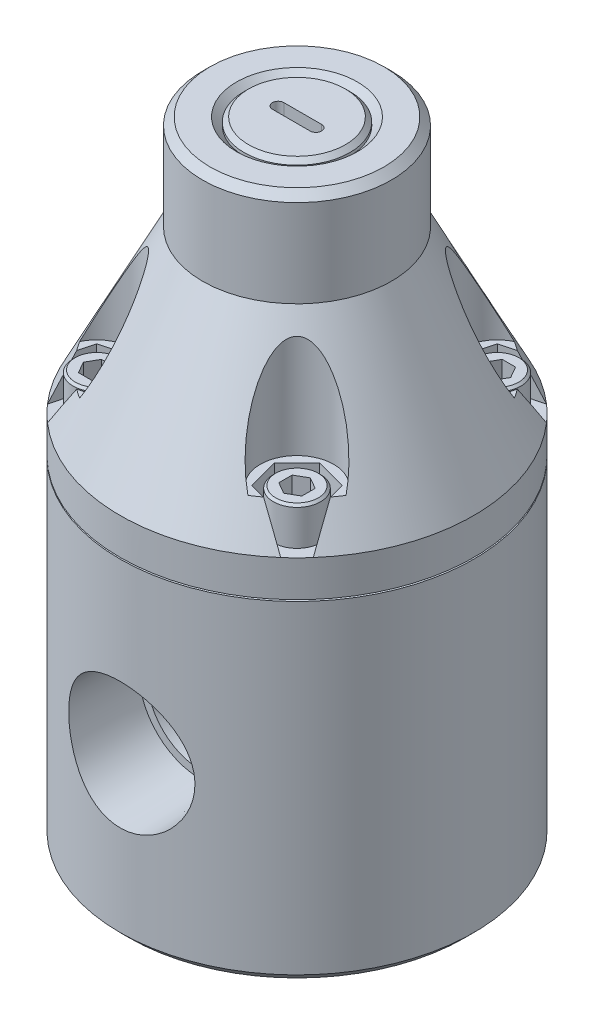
ISO-10303-21;
HEADER;
FILE_DESCRIPTION(('STEP AP214'),'2;1');
FILE_NAME('part.step','',(''),(''),'','','');
FILE_SCHEMA(('AUTOMOTIVE_DESIGN { 1 0 10303 214 1 1 1 1 }'));
ENDSEC;
DATA;
#1=APPLICATION_CONTEXT('core data for automotive mechanical design processes');
#2=APPLICATION_PROTOCOL_DEFINITION('international standard','automotive_design',2000,#1);
#3=PRODUCT_CONTEXT('',#1,'mechanical');
#4=PRODUCT('Part','Part','',(#3));
#5=PRODUCT_RELATED_PRODUCT_CATEGORY('part','',(#4));
#6=PRODUCT_DEFINITION_FORMATION('','',#4);
#7=PRODUCT_DEFINITION_CONTEXT('part definition',#1,'design');
#8=PRODUCT_DEFINITION('design','',#6,#7);
#9=PRODUCT_DEFINITION_SHAPE('','',#8);
#10=(LENGTH_UNIT() NAMED_UNIT(*) SI_UNIT(.MILLI.,.METRE.));
#11=(NAMED_UNIT(*) PLANE_ANGLE_UNIT() SI_UNIT($,.RADIAN.));
#12=(NAMED_UNIT(*) SI_UNIT($,.STERADIAN.) SOLID_ANGLE_UNIT());
#13=UNCERTAINTY_MEASURE_WITH_UNIT(LENGTH_MEASURE(1.E-05),#10,'distance_accuracy_value','');
#14=(GEOMETRIC_REPRESENTATION_CONTEXT(3) GLOBAL_UNCERTAINTY_ASSIGNED_CONTEXT((#13)) GLOBAL_UNIT_ASSIGNED_CONTEXT((#10,
#11,#12)) REPRESENTATION_CONTEXT('',''));
#15=CARTESIAN_POINT('',(0.,0.,0.));
#16=DIRECTION('',(0.,0.,1.));
#17=DIRECTION('',(1.,0.,0.));
#18=AXIS2_PLACEMENT_3D('',#15,#16,#17);
#19=CARTESIAN_POINT('',(0.,62.23,0.));
#20=DIRECTION('',(0.,-1.,0.));
#21=DIRECTION('',(0.,0.,-1.));
#22=AXIS2_PLACEMENT_3D('',#19,#20,#21);
#23=CONICAL_SURFACE('',#22,29.718,0.471096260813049);
#24=CARTESIAN_POINT('',(-22.3373805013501,62.2298,-19.6011992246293));
#25=CARTESIAN_POINT('',(-22.2547645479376,62.7634166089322,-19.2832519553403));
#26=CARTESIAN_POINT('',(-22.1717744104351,63.29612059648,-18.9638646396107));
#27=CARTESIAN_POINT('',(-22.0049530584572,64.3594037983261,-18.3218531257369));
#28=CARTESIAN_POINT('',(-21.9211218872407,64.8899831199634,-17.9992290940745));
#29=CARTESIAN_POINT('',(-21.7525165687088,65.9487768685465,-17.3503519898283));
#30=CARTESIAN_POINT('',(-21.6677424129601,66.4769912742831,-17.0240988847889));
#31=CARTESIAN_POINT('',(-21.4971243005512,67.5307185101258,-16.367475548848));
#32=CARTESIAN_POINT('',(-21.4112802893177,68.0562312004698,-16.0371051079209));
#33=CARTESIAN_POINT('',(-21.3248419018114,68.5802,-15.7044472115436));
#34=B_SPLINE_CURVE_WITH_KNOTS('',3,(#24,#25,#26,#27,#28,#29,#30,#31,#32,#33),.UNSPECIFIED.,.F.,
.F.,(4,2,2,2,4),(0.,1.87988537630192,3.75967455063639,5.63948054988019,7.51938283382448),.UNSPECIFIED.);
#35=CARTESIAN_POINT('',(-22.3373495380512,62.23,-19.6010800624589));
#36=VERTEX_POINT('',#35);
#37=CARTESIAN_POINT('',(-21.324874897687,68.58,-15.7045741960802));
#38=VERTEX_POINT('',#37);
#39=EDGE_CURVE('E732',#36,#38,#34,.T.);
#40=ORIENTED_EDGE('',*,*,#39,.F.);
#41=CARTESIAN_POINT('',(0.,62.23,0.));
#42=DIRECTION('',(0.,-1.,0.));
#43=DIRECTION('',(0.,0.,-1.));
#44=AXIS2_PLACEMENT_3D('',#41,#42,#43);
#45=CIRCLE('',#44,29.718);
#46=CARTESIAN_POINT('',(-22.3373495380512,62.23,19.6010800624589));
#47=VERTEX_POINT('',#46);
#48=EDGE_CURVE('E1086',#47,#36,#45,.T.);
#49=ORIENTED_EDGE('',*,*,#48,.F.);
#50=CARTESIAN_POINT('',(-21.3248419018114,68.5802,15.7044472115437));
#51=CARTESIAN_POINT('',(-21.4112802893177,68.0562312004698,16.0371051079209));
#52=CARTESIAN_POINT('',(-21.4971243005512,67.5307185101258,16.367475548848));
#53=CARTESIAN_POINT('',(-21.66774241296,66.4769912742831,17.024098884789));
#54=CARTESIAN_POINT('',(-21.7525165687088,65.9487768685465,17.3503519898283));
#55=CARTESIAN_POINT('',(-21.9211218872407,64.8899831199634,17.9992290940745));
#56=CARTESIAN_POINT('',(-22.0049530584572,64.3594037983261,18.3218531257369));
#57=CARTESIAN_POINT('',(-22.1717744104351,63.29612059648,18.9638646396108));
#58=CARTESIAN_POINT('',(-22.2547645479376,62.7634166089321,19.2832519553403));
#59=CARTESIAN_POINT('',(-22.3373805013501,62.2298,19.6011992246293));
#60=B_SPLINE_CURVE_WITH_KNOTS('',3,(#50,#51,#52,#53,#54,#55,#56,#57,#58,#59),.UNSPECIFIED.,.F.,
.F.,(4,2,2,2,4),(0.,1.87990228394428,3.75970828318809,5.63949745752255,7.51938283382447),.UNSPECIFIED.);
#61=CARTESIAN_POINT('',(-21.324874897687,68.58,15.7045741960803));
#62=VERTEX_POINT('',#61);
#63=EDGE_CURVE('E787',#62,#47,#60,.T.);
#64=ORIENTED_EDGE('',*,*,#63,.F.);
#65=CARTESIAN_POINT('',(0.,68.58,0.));
#66=DIRECTION('',(0.,1.,0.));
#67=DIRECTION('',(0.,0.,1.));
#68=AXIS2_PLACEMENT_3D('',#65,#66,#67);
#69=CIRCLE('',#68,26.4836542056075);
#70=CARTESIAN_POINT('',(-22.3908779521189,68.58,14.1432854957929));
#71=VERTEX_POINT('',#70);
#72=EDGE_CURVE('E1571',#62,#71,#69,.F.);
#73=ORIENTED_EDGE('',*,*,#72,.T.);
#74=CARTESIAN_POINT('',(-22.3909303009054,68.5798,14.143393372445));
#75=CARTESIAN_POINT('',(-22.350304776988,68.7350022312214,14.0596815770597));
#76=CARTESIAN_POINT('',(-22.3081630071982,68.89069928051,13.9776470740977));
#77=CARTESIAN_POINT('',(-22.2210302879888,69.2029732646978,13.8168553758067));
#78=CARTESIAN_POINT('',(-22.1760395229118,69.3595501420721,13.7380979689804));
#79=CARTESIAN_POINT('',(-22.0370947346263,69.8303500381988,13.5066666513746));
#80=CARTESIAN_POINT('',(-21.9391379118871,70.1457572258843,13.3587718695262));
#81=CARTESIAN_POINT('',(-21.7338262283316,70.7787217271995,13.0753567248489));
#82=CARTESIAN_POINT('',(-21.6264783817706,71.0962772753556,12.9398272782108));
#83=CARTESIAN_POINT('',(-21.4032338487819,71.7332404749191,12.6806046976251));
#84=CARTESIAN_POINT('',(-21.2873363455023,72.0526483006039,12.556912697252));
#85=CARTESIAN_POINT('',(-21.0470421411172,72.6946343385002,12.3204109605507));
#86=CARTESIAN_POINT('',(-20.9226003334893,73.0172202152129,12.2076680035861));
#87=CARTESIAN_POINT('',(-20.6663853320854,73.6632945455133,11.9936819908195));
#88=CARTESIAN_POINT('',(-20.5346119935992,73.9867830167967,11.8924391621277));
#89=CARTESIAN_POINT('',(-20.2641447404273,74.6342665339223,11.7013595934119));
#90=CARTESIAN_POINT('',(-20.1254503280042,74.9582616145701,11.6115236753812));
#91=CARTESIAN_POINT('',(-19.8414364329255,75.6062899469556,11.4433041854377));
#92=CARTESIAN_POINT('',(-19.6961171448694,75.9303231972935,11.3649202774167));
#93=CARTESIAN_POINT('',(-19.3211632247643,76.7476954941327,11.1817059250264));
#94=CARTESIAN_POINT('',(-19.0872302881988,77.2408247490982,11.0845248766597));
#95=CARTESIAN_POINT('',(-18.7249280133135,77.9784605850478,10.9599064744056));
#96=CARTESIAN_POINT('',(-18.6022415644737,78.2240315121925,10.9218885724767));
#97=CARTESIAN_POINT('',(-18.3529388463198,78.7141977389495,10.8531925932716));
#98=CARTESIAN_POINT('',(-18.2263228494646,78.9587931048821,10.8225140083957));
#99=CARTESIAN_POINT('',(-17.9690231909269,79.4465771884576,10.7688733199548));
#100=CARTESIAN_POINT('',(-17.8383410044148,79.6897663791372,10.7459084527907));
#101=CARTESIAN_POINT('',(-17.5726008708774,80.1743656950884,10.7081842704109));
#102=CARTESIAN_POINT('',(-17.4375433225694,80.4157759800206,10.693424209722));
#103=CARTESIAN_POINT('',(-17.1627429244,80.8961071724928,10.6727907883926));
#104=CARTESIAN_POINT('',(-17.0230031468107,81.1350295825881,10.6669117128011));
#105=CARTESIAN_POINT('',(-16.7382475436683,81.6097183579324,10.6649433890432));
#106=CARTESIAN_POINT('',(-16.5932325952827,81.8454852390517,10.6688525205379));
#107=CARTESIAN_POINT('',(-16.2968182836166,82.3133650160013,10.6877509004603));
#108=CARTESIAN_POINT('',(-16.1454043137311,82.5454676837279,10.7027669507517));
#109=CARTESIAN_POINT('',(-15.8354539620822,83.0038758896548,10.7457309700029));
#110=CARTESIAN_POINT('',(-15.6769137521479,83.2301782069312,10.7736859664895));
#111=CARTESIAN_POINT('',(-15.3515270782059,83.6741617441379,10.8451251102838));
#112=CARTESIAN_POINT('',(-15.1846866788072,83.8918490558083,10.8885980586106));
#113=CARTESIAN_POINT('',(-14.9269806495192,84.2084557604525,10.9683843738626));
#114=CARTESIAN_POINT('',(-14.839881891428,84.3122892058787,10.997391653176));
#115=CARTESIAN_POINT('',(-14.6629301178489,84.515808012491,11.0609509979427));
#116=CARTESIAN_POINT('',(-14.5730777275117,84.6154943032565,11.0955018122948));
#117=CARTESIAN_POINT('',(-14.3891167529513,84.8109037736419,11.1714874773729));
#118=CARTESIAN_POINT('',(-14.2949676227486,84.9065572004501,11.2130072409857));
#119=CARTESIAN_POINT('',(-14.1034347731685,85.0907355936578,11.3035808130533));
#120=CARTESIAN_POINT('',(-14.0060494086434,85.1792568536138,11.3526385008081));
#121=CARTESIAN_POINT('',(-13.7101223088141,85.429646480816,11.5123405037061));
#122=CARTESIAN_POINT('',(-13.5060546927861,85.5782916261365,11.6361944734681));
#123=CARTESIAN_POINT('',(-13.1996116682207,85.7493306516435,11.8507095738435));
#124=CARTESIAN_POINT('',(-13.0998509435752,85.7971000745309,11.9248690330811));
#125=CARTESIAN_POINT('',(-12.900706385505,85.873763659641,12.0829789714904));
#126=CARTESIAN_POINT('',(-12.8013223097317,85.9026733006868,12.1669213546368));
#127=CARTESIAN_POINT('',(-12.6053038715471,85.9385908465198,12.3437610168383));
#128=CARTESIAN_POINT('',(-12.5086917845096,85.9454540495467,12.4367133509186));
#129=CARTESIAN_POINT('',(-12.3223166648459,85.9359739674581,12.6281475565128));
#130=CARTESIAN_POINT('',(-12.2325552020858,85.9196253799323,12.7266306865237));
#131=CARTESIAN_POINT('',(-12.0684910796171,85.8677160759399,12.9184346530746));
#132=CARTESIAN_POINT('',(-11.9935403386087,85.8336265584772,13.0116153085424));
#133=CARTESIAN_POINT('',(-11.8522698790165,85.7502029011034,13.1975950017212));
#134=CARTESIAN_POINT('',(-11.7859543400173,85.7008614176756,13.290393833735));
#135=CARTESIAN_POINT('',(-11.6163662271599,85.5496530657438,13.5413620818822));
#136=CARTESIAN_POINT('',(-11.5214197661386,85.4357254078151,13.6978402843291));
#137=CARTESIAN_POINT('',(-11.3524385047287,85.1845941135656,14.0032728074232));
#138=CARTESIAN_POINT('',(-11.2784789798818,85.0473094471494,14.1521985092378));
#139=CARTESIAN_POINT('',(-11.1484302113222,84.7600134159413,14.44015441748));
#140=CARTESIAN_POINT('',(-11.0920802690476,84.6102339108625,14.5793027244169));
#141=CARTESIAN_POINT('',(-10.9925096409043,84.3006741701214,14.851149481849));
#142=CARTESIAN_POINT('',(-10.9493023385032,84.1408839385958,14.9838412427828));
#143=CARTESIAN_POINT('',(-10.8736636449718,83.8139640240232,15.2438249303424));
#144=CARTESIAN_POINT('',(-10.8412572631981,83.6468183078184,15.3711037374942));
#145=CARTESIAN_POINT('',(-10.7856662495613,83.307480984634,15.6206584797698));
#146=CARTESIAN_POINT('',(-10.7624784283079,83.1352911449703,15.7429361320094));
#147=CARTESIAN_POINT('',(-10.7205377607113,82.7552655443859,16.0051192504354));
#148=CARTESIAN_POINT('',(-10.7033691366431,82.5466647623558,16.1441638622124));
#149=CARTESIAN_POINT('',(-10.6786273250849,82.125493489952,16.4170496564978));
#150=CARTESIAN_POINT('',(-10.6710565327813,81.9129220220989,16.5508895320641));
#151=CARTESIAN_POINT('',(-10.664422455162,81.4846459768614,16.8140587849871));
#152=CARTESIAN_POINT('',(-10.6653663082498,81.2689389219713,16.9433842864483));
#153=CARTESIAN_POINT('',(-10.674967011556,80.8352423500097,17.1978874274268));
#154=CARTESIAN_POINT('',(-10.6836247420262,80.6172525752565,17.323064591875));
#155=CARTESIAN_POINT('',(-10.7080782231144,80.178919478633,17.5699535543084));
#156=CARTESIAN_POINT('',(-10.7238938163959,79.9585712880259,17.691654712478));
#157=CARTESIAN_POINT('',(-10.7622068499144,79.516512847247,17.9314908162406));
#158=CARTESIAN_POINT('',(-10.7847047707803,79.2948025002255,18.0496255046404));
#159=CARTESIAN_POINT('',(-10.8616544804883,78.628245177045,18.3989144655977));
#160=CARTESIAN_POINT('',(-10.9255713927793,78.1818168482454,18.6250403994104));
#161=CARTESIAN_POINT('',(-11.0664102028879,77.3479438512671,19.0346218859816));
#162=CARTESIAN_POINT('',(-11.1403619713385,76.9607742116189,19.2196861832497));
#163=CARTESIAN_POINT('',(-11.3050181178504,76.1856258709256,19.5805572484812));
#164=CARTESIAN_POINT('',(-11.3957241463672,75.7976470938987,19.7563631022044));
#165=CARTESIAN_POINT('',(-11.5935742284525,75.0216151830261,20.0985507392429));
#166=CARTESIAN_POINT('',(-11.7007221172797,74.6335620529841,20.264930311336));
#167=CARTESIAN_POINT('',(-11.9313879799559,73.8581881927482,20.5877481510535));
#168=CARTESIAN_POINT('',(-12.0549056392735,73.470867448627,20.7441866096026));
#169=CARTESIAN_POINT('',(-12.3163714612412,72.7038997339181,21.0439307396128));
#170=CARTESIAN_POINT('',(-12.4540552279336,72.3242296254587,21.1874073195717));
#171=CARTESIAN_POINT('',(-12.7458005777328,71.5671030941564,21.4629534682));
#172=CARTESIAN_POINT('',(-12.8998598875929,71.1896463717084,21.5950246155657));
#173=CARTESIAN_POINT('',(-13.2250025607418,70.4376533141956,21.8464430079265));
#174=CARTESIAN_POINT('',(-13.396090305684,70.0631177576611,21.9657869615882));
#175=CARTESIAN_POINT('',(-13.6660711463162,69.5043911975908,22.1338540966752));
#176=CARTESIAN_POINT('',(-13.7583155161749,69.3186135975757,22.1880644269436));
#177=CARTESIAN_POINT('',(-13.9473861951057,68.9482602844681,22.2925349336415));
#178=CARTESIAN_POINT('',(-14.044212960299,68.7636846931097,22.3427947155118));
#179=CARTESIAN_POINT('',(-14.1433933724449,68.5798000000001,22.3909303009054));
#180=B_SPLINE_CURVE_WITH_KNOTS('',3,(#74,#75,#76,#77,#78,#79,#80,#81,#82,#83,#84,#85,#86,#87,
#88,#89,#90,#91,#92,#93,#94,#95,#96,#97,#98,#99,#100,#101,#102,#103,#104,#105,#106,#107,#108,
#109,#110,#111,#112,#113,#114,#115,#116,#117,#118,#119,#120,#121,#122,#123,#124,#125,#126,#127,
#128,#129,#130,#131,#132,#133,#134,#135,#136,#137,#138,#139,#140,#141,#142,#143,#144,#145,#146,
#147,#148,#149,#150,#151,#152,#153,#154,#155,#156,#157,#158,#159,#160,#161,#162,#163,#164,#165,
#166,#167,#168,#169,#170,#171,#172,#173,#174,#175,#176,#177,#178,#179),.UNSPECIFIED.,.F.,.F.,(4,
2,2,2,2,2,2,2,2,2,2,2,2,2,2,2,2,2,2,2,2,2,2,2,2,2,2,2,2,2,2,2,2,2,2,2,2,2,2,2,2,2,2,2,2,2,2,2,2,
2,2,2,4),(0.,0.542840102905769,1.08564511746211,2.17085376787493,3.25525867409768,
4.33976732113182,5.43052218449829,6.5212985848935,7.61215354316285,8.70297647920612,
10.3650975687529,11.196398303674,12.027641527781,12.8585866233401,13.6894562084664,
14.5197908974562,15.3499881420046,16.1821952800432,17.014854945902,17.8469149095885,
18.2625409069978,18.6780732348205,19.0990950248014,19.5203342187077,20.354755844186,
20.7529146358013,21.1507462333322,21.5511837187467,21.9517126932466,22.32334462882,
22.6951557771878,23.3381727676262,23.9834677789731,24.6186994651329,25.2545758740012,
25.8919145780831,26.5290325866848,27.2825500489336,28.0362555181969,28.7905929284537,
29.5450164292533,30.3015442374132,31.0581264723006,32.5707579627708,33.8767149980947,
35.1828007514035,36.4891916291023,37.7955574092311,39.0808873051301,40.3660390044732,
41.6515222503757,42.2946005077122,42.9377429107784),.UNSPECIFIED.);
#181=CARTESIAN_POINT('',(-14.1432854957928,68.58,22.390877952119));
#182=VERTEX_POINT('',#181);
#183=EDGE_CURVE('E1608',#71,#182,#180,.T.);
#184=ORIENTED_EDGE('',*,*,#183,.T.);
#185=CARTESIAN_POINT('',(-15.7045741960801,68.58,21.3248748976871));
#186=VERTEX_POINT('',#185);
#187=EDGE_CURVE('E1605',#182,#186,#69,.F.);
#188=ORIENTED_EDGE('',*,*,#187,.T.);
#189=CARTESIAN_POINT('',(-19.6011992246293,62.2298,22.3373805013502));
#190=CARTESIAN_POINT('',(-19.2832519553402,62.7634166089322,22.2547645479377));
#191=CARTESIAN_POINT('',(-18.9638646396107,63.29612059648,22.1717744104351));
#192=CARTESIAN_POINT('',(-18.3218531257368,64.3594037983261,22.0049530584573));
#193=CARTESIAN_POINT('',(-17.9992290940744,64.8899831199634,21.9211218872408));
#194=CARTESIAN_POINT('',(-17.3503519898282,65.9487768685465,21.7525165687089));
#195=CARTESIAN_POINT('',(-17.0240988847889,66.4769912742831,21.6677424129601));
#196=CARTESIAN_POINT('',(-16.3674755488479,67.5307185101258,21.4971243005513));
#197=CARTESIAN_POINT('',(-16.0371051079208,68.0562312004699,21.4112802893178));
#198=CARTESIAN_POINT('',(-15.7044472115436,68.5802,21.3248419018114));
#199=B_SPLINE_CURVE_WITH_KNOTS('',3,(#189,#190,#191,#192,#193,#194,#195,#196,#197,#198),
.UNSPECIFIED.,.F.,.F.,(4,2,2,2,4),(0.,1.87988537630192,3.75967455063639,5.63948054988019,
7.51938283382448),.UNSPECIFIED.);
#200=CARTESIAN_POINT('',(-19.6010800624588,62.23,22.3373495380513));
#201=VERTEX_POINT('',#200);
#202=EDGE_CURVE('E779',#201,#186,#199,.T.);
#203=ORIENTED_EDGE('',*,*,#202,.F.);
#204=CARTESIAN_POINT('',(19.601080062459,62.23,22.3373495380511));
#205=VERTEX_POINT('',#204);
#206=EDGE_CURVE('E1104',#205,#201,#45,.T.);
#207=ORIENTED_EDGE('',*,*,#206,.F.);
#208=CARTESIAN_POINT('',(15.7044472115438,68.5802,21.3248419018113));
#209=CARTESIAN_POINT('',(16.037105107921,68.0562312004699,21.4112802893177));
#210=CARTESIAN_POINT('',(16.3674755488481,67.5307185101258,21.4971243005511));
#211=CARTESIAN_POINT('',(17.024098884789,66.4769912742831,21.66774241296));
#212=CARTESIAN_POINT('',(17.3503519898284,65.9487768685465,21.7525165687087));
#213=CARTESIAN_POINT('',(17.9992290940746,64.8899831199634,21.9211218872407));
#214=CARTESIAN_POINT('',(18.321853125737,64.3594037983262,22.0049530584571));
#215=CARTESIAN_POINT('',(18.9638646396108,63.29612059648,22.171774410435));
#216=CARTESIAN_POINT('',(19.2832519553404,62.7634166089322,22.2547645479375));
#217=CARTESIAN_POINT('',(19.6011992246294,62.2298,22.33738050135));
#218=B_SPLINE_CURVE_WITH_KNOTS('',3,(#208,#209,#210,#211,#212,#213,#214,#215,#216,#217),
.UNSPECIFIED.,.F.,.F.,(4,2,2,2,4),(0.,1.87990228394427,3.75970828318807,5.63949745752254,
7.51938283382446),.UNSPECIFIED.);
#219=CARTESIAN_POINT('',(15.7045741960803,68.58,21.3248748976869));
#220=VERTEX_POINT('',#219);
#221=EDGE_CURVE('E828',#220,#205,#218,.T.);
#222=ORIENTED_EDGE('',*,*,#221,.F.);
#223=CARTESIAN_POINT('',(0.,68.58,0.));
#224=DIRECTION('',(0.,1.,0.));
#225=DIRECTION('',(0.,0.,1.));
#226=AXIS2_PLACEMENT_3D('',#223,#224,#225);
#227=CIRCLE('',#226,26.4836542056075);
#228=CARTESIAN_POINT('',(14.143285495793,68.58,22.3908779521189));
#229=VERTEX_POINT('',#228);
#230=EDGE_CURVE('E1143',#220,#229,#227,.F.);
#231=ORIENTED_EDGE('',*,*,#230,.T.);
#232=CARTESIAN_POINT('',(14.1433933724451,68.5798,22.3909303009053));
#233=CARTESIAN_POINT('',(14.0596815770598,68.7350022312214,22.3503047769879));
#234=CARTESIAN_POINT('',(13.9776470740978,68.89069928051,22.3081630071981));
#235=CARTESIAN_POINT('',(13.8168553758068,69.2029732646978,22.2210302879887));
#236=CARTESIAN_POINT('',(13.7380979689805,69.3595501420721,22.1760395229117));
#237=CARTESIAN_POINT('',(13.5066666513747,69.8303500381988,22.0370947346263));
#238=CARTESIAN_POINT('',(13.3587718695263,70.1457572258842,21.939137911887));
#239=CARTESIAN_POINT('',(13.075356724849,70.7787217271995,21.7338262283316));
#240=CARTESIAN_POINT('',(12.9398272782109,71.0962772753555,21.6264783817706));
#241=CARTESIAN_POINT('',(12.6806046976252,71.7332404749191,21.4032338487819));
#242=CARTESIAN_POINT('',(12.5569126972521,72.0526483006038,21.2873363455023));
#243=CARTESIAN_POINT('',(12.3204109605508,72.6946343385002,21.0470421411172));
#244=CARTESIAN_POINT('',(12.2076680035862,73.0172202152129,20.9226003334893));
#245=CARTESIAN_POINT('',(11.9936819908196,73.6632945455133,20.6663853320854));
#246=CARTESIAN_POINT('',(11.8924391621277,73.9867830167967,20.5346119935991));
#247=CARTESIAN_POINT('',(11.7013595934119,74.6342665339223,20.2641447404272));
#248=CARTESIAN_POINT('',(11.6115236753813,74.9582616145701,20.1254503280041));
#249=CARTESIAN_POINT('',(11.4433041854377,75.6062899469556,19.8414364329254));
#250=CARTESIAN_POINT('',(11.3649202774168,75.9303231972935,19.6961171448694));
#251=CARTESIAN_POINT('',(11.1817059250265,76.7476954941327,19.3211632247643));
#252=CARTESIAN_POINT('',(11.0845248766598,77.2408247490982,19.0872302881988));
#253=CARTESIAN_POINT('',(10.9599064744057,77.9784605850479,18.7249280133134));
#254=CARTESIAN_POINT('',(10.9218885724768,78.2240315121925,18.6022415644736));
#255=CARTESIAN_POINT('',(10.8531925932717,78.7141977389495,18.3529388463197));
#256=CARTESIAN_POINT('',(10.8225140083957,78.9587931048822,18.2263228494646));
#257=CARTESIAN_POINT('',(10.7688733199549,79.4465771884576,17.9690231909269));
#258=CARTESIAN_POINT('',(10.7459084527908,79.6897663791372,17.8383410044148));
#259=CARTESIAN_POINT('',(10.7081842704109,80.1743656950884,17.5726008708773));
#260=CARTESIAN_POINT('',(10.6934242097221,80.4157759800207,17.4375433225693));
#261=CARTESIAN_POINT('',(10.6727907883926,80.8961071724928,17.1627429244));
#262=CARTESIAN_POINT('',(10.6669117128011,81.1350295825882,17.0230031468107));
#263=CARTESIAN_POINT('',(10.6649433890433,81.6097183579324,16.7382475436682));
#264=CARTESIAN_POINT('',(10.668852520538,81.8454852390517,16.5932325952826));
#265=CARTESIAN_POINT('',(10.6877509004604,82.3133650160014,16.2968182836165));
#266=CARTESIAN_POINT('',(10.7027669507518,82.545467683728,16.1454043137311));
#267=CARTESIAN_POINT('',(10.745730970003,83.0038758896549,15.8354539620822));
#268=CARTESIAN_POINT('',(10.7736859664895,83.2301782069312,15.6769137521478));
#269=CARTESIAN_POINT('',(10.8451251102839,83.6741617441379,15.3515270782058));
#270=CARTESIAN_POINT('',(10.8885980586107,83.8918490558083,15.1846866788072));
#271=CARTESIAN_POINT('',(10.9683843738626,84.2084557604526,14.9269806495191));
#272=CARTESIAN_POINT('',(10.997391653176,84.3122892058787,14.8398818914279));
#273=CARTESIAN_POINT('',(11.0609509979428,84.515808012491,14.6629301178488));
#274=CARTESIAN_POINT('',(11.0955018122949,84.6154943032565,14.5730777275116));
#275=CARTESIAN_POINT('',(11.171487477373,84.8109037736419,14.3891167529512));
#276=CARTESIAN_POINT('',(11.2130072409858,84.9065572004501,14.2949676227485));
#277=CARTESIAN_POINT('',(11.3035808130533,85.0907355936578,14.1034347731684));
#278=CARTESIAN_POINT('',(11.3526385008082,85.1792568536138,14.0060494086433));
#279=CARTESIAN_POINT('',(11.5123405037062,85.4296464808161,13.710122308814));
#280=CARTESIAN_POINT('',(11.6361944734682,85.5782916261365,13.506054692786));
#281=CARTESIAN_POINT('',(11.8507095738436,85.7493306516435,13.1996116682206));
#282=CARTESIAN_POINT('',(11.9248690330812,85.797100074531,13.0998509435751));
#283=CARTESIAN_POINT('',(12.0829789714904,85.873763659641,12.9007063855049));
#284=CARTESIAN_POINT('',(12.1669213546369,85.9026733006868,12.8013223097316));
#285=CARTESIAN_POINT('',(12.3437610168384,85.9385908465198,12.605303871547));
#286=CARTESIAN_POINT('',(12.4367133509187,85.9454540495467,12.5086917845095));
#287=CARTESIAN_POINT('',(12.6281475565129,85.9359739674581,12.3223166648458));
#288=CARTESIAN_POINT('',(12.7266306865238,85.9196253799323,12.2325552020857));
#289=CARTESIAN_POINT('',(12.9184346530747,85.8677160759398,12.068491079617));
#290=CARTESIAN_POINT('',(13.0116153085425,85.8336265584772,11.9935403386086));
#291=CARTESIAN_POINT('',(13.1975950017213,85.7502029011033,11.8522698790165));
#292=CARTESIAN_POINT('',(13.2903938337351,85.7008614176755,11.7859543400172));
#293=CARTESIAN_POINT('',(13.5413620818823,85.5496530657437,11.6163662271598));
#294=CARTESIAN_POINT('',(13.6978402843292,85.435725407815,11.5214197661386));
#295=CARTESIAN_POINT('',(14.0032728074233,85.1845941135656,11.3524385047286));
#296=CARTESIAN_POINT('',(14.1521985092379,85.0473094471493,11.2784789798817));
#297=CARTESIAN_POINT('',(14.4401544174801,84.7600134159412,11.1484302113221));
#298=CARTESIAN_POINT('',(14.579302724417,84.6102339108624,11.0920802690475));
#299=CARTESIAN_POINT('',(14.8511494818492,84.3006741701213,10.9925096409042));
#300=CARTESIAN_POINT('',(14.983841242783,84.1408839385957,10.9493023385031));
#301=CARTESIAN_POINT('',(15.2438249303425,83.813964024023,10.8736636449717));
#302=CARTESIAN_POINT('',(15.3711037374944,83.6468183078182,10.841257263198));
#303=CARTESIAN_POINT('',(15.62065847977,83.3074809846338,10.7856662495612));
#304=CARTESIAN_POINT('',(15.7429361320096,83.1352911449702,10.7624784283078));
#305=CARTESIAN_POINT('',(16.0051192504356,82.7552655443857,10.7205377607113));
#306=CARTESIAN_POINT('',(16.1441638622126,82.5466647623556,10.703369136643));
#307=CARTESIAN_POINT('',(16.417049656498,82.1254934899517,10.6786273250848));
#308=CARTESIAN_POINT('',(16.5508895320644,81.9129220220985,10.6710565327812));
#309=CARTESIAN_POINT('',(16.8140587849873,81.4846459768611,10.6644224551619));
#310=CARTESIAN_POINT('',(16.9433842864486,81.2689389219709,10.6653663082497));
#311=CARTESIAN_POINT('',(17.1978874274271,80.8352423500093,10.674967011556));
#312=CARTESIAN_POINT('',(17.3230645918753,80.6172525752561,10.6836247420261));
#313=CARTESIAN_POINT('',(17.5699535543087,80.1789194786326,10.7080782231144));
#314=CARTESIAN_POINT('',(17.6916547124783,79.9585712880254,10.7238938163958));
#315=CARTESIAN_POINT('',(17.9314908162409,79.5165128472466,10.7622068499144));
#316=CARTESIAN_POINT('',(18.0496255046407,79.294802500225,10.7847047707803));
#317=CARTESIAN_POINT('',(18.398914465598,78.6282451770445,10.8616544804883));
#318=CARTESIAN_POINT('',(18.6250403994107,78.1818168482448,10.9255713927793));
#319=CARTESIAN_POINT('',(19.0346218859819,77.3479438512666,11.0664102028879));
#320=CARTESIAN_POINT('',(19.21968618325,76.9607742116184,11.1403619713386));
#321=CARTESIAN_POINT('',(19.5805572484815,76.1856258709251,11.3050181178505));
#322=CARTESIAN_POINT('',(19.7563631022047,75.7976470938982,11.3957241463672));
#323=CARTESIAN_POINT('',(20.0985507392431,75.0216151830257,11.5935742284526));
#324=CARTESIAN_POINT('',(20.2649303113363,74.6335620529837,11.7007221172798));
#325=CARTESIAN_POINT('',(20.5877481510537,73.8581881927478,11.9313879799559));
#326=CARTESIAN_POINT('',(20.7441866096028,73.4708674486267,12.0549056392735));
#327=CARTESIAN_POINT('',(21.0439307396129,72.7038997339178,12.3163714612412));
#328=CARTESIAN_POINT('',(21.1874073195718,72.3242296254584,12.4540552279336));
#329=CARTESIAN_POINT('',(21.4629534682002,71.5671030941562,12.7458005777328));
#330=CARTESIAN_POINT('',(21.5950246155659,71.1896463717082,12.8998598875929));
#331=CARTESIAN_POINT('',(21.8464430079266,70.4376533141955,13.2250025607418));
#332=CARTESIAN_POINT('',(21.9657869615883,70.0631177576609,13.396090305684));
#333=CARTESIAN_POINT('',(22.1338540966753,69.5043911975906,13.6660711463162));
#334=CARTESIAN_POINT('',(22.1880644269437,69.3186135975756,13.7583155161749));
#335=CARTESIAN_POINT('',(22.2925349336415,68.948260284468,13.9473861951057));
#336=CARTESIAN_POINT('',(22.3427947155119,68.7636846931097,14.0442129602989));
#337=CARTESIAN_POINT('',(22.3909303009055,68.5798,14.1433933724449));
#338=B_SPLINE_CURVE_WITH_KNOTS('',3,(#232,#233,#234,#235,#236,#237,#238,#239,#240,#241,#242,
#243,#244,#245,#246,#247,#248,#249,#250,#251,#252,#253,#254,#255,#256,#257,#258,#259,#260,#261,
#262,#263,#264,#265,#266,#267,#268,#269,#270,#271,#272,#273,#274,#275,#276,#277,#278,#279,#280,
#281,#282,#283,#284,#285,#286,#287,#288,#289,#290,#291,#292,#293,#294,#295,#296,#297,#298,#299,
#300,#301,#302,#303,#304,#305,#306,#307,#308,#309,#310,#311,#312,#313,#314,#315,#316,#317,#318,
#319,#320,#321,#322,#323,#324,#325,#326,#327,#328,#329,#330,#331,#332,#333,#334,#335,#336,#337),
.UNSPECIFIED.,.F.,.F.,(4,2,2,2,2,2,2,2,2,2,2,2,2,2,2,2,2,2,2,2,2,2,2,2,2,2,2,2,2,2,2,2,2,2,2,2,
2,2,2,2,2,2,2,2,2,2,2,2,2,2,2,2,4),(0.,0.542840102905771,1.08564511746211,2.17085376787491,
3.25525867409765,4.3397673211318,5.43052218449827,6.52129858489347,7.61215354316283,
8.7029764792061,10.3650975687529,11.196398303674,12.0276415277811,12.8585866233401,
13.6894562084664,14.5197908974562,15.3499881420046,16.1821952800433,17.0148549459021,
17.8469149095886,18.2625409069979,18.6780732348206,19.0990950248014,19.5203342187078,
20.3547558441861,20.7529146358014,21.1507462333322,21.5511837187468,21.9517126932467,
22.3233446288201,22.6951557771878,23.3381727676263,23.9834677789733,24.618699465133,
25.2545758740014,25.8919145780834,26.529032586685,27.2825500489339,28.0362555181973,
28.7905929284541,29.5450164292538,30.3015442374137,31.0581264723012,32.5707579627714,
33.8767149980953,35.182800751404,36.4891916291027,37.7955574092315,39.0808873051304,
40.3660390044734,41.6515222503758,42.2946005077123,42.9377429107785),.UNSPECIFIED.);
#339=CARTESIAN_POINT('',(22.390877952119,68.58,14.1432854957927));
#340=VERTEX_POINT('',#339);
#341=EDGE_CURVE('E1577',#229,#340,#338,.T.);
#342=ORIENTED_EDGE('',*,*,#341,.T.);
#343=CARTESIAN_POINT('',(21.3248748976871,68.58,15.7045741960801));
#344=VERTEX_POINT('',#343);
#345=EDGE_CURVE('E1154',#340,#344,#227,.F.);
#346=ORIENTED_EDGE('',*,*,#345,.T.);
#347=CARTESIAN_POINT('',(22.3373805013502,62.2298,19.6011992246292));
#348=CARTESIAN_POINT('',(22.2547645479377,62.7634166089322,19.2832519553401));
#349=CARTESIAN_POINT('',(22.1717744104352,63.29612059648,18.9638646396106));
#350=CARTESIAN_POINT('',(22.0049530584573,64.3594037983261,18.3218531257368));
#351=CARTESIAN_POINT('',(21.9211218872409,64.8899831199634,17.9992290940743));
#352=CARTESIAN_POINT('',(21.752516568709,65.9487768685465,17.3503519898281));
#353=CARTESIAN_POINT('',(21.6677424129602,66.4769912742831,17.0240988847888));
#354=CARTESIAN_POINT('',(21.4971243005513,67.5307185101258,16.3674755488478));
#355=CARTESIAN_POINT('',(21.4112802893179,68.0562312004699,16.0371051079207));
#356=CARTESIAN_POINT('',(21.3248419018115,68.5802,15.7044472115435));
#357=B_SPLINE_CURVE_WITH_KNOTS('',3,(#347,#348,#349,#350,#351,#352,#353,#354,#355,#356),
.UNSPECIFIED.,.F.,.F.,(4,2,2,2,4),(0.,1.87988537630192,3.75967455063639,5.63948054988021,
7.51938283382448),.UNSPECIFIED.);
#358=CARTESIAN_POINT('',(22.3373495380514,62.23,19.6010800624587));
#359=VERTEX_POINT('',#358);
#360=EDGE_CURVE('E844',#359,#344,#357,.T.);
#361=ORIENTED_EDGE('',*,*,#360,.F.);
#362=CARTESIAN_POINT('',(22.3373495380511,62.23,-19.6010800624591));
#363=VERTEX_POINT('',#362);
#364=EDGE_CURVE('E1000',#363,#359,#45,.T.);
#365=ORIENTED_EDGE('',*,*,#364,.F.);
#366=CARTESIAN_POINT('',(21.3248419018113,68.5802,-15.7044472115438));
#367=CARTESIAN_POINT('',(21.4112802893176,68.0562312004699,-16.037105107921));
#368=CARTESIAN_POINT('',(21.4971243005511,67.5307185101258,-16.3674755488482));
#369=CARTESIAN_POINT('',(21.6677424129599,66.4769912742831,-17.0240988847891));
#370=CARTESIAN_POINT('',(21.7525165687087,65.9487768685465,-17.3503519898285));
#371=CARTESIAN_POINT('',(21.9211218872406,64.8899831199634,-17.9992290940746));
#372=CARTESIAN_POINT('',(22.004953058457,64.3594037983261,-18.3218531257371));
#373=CARTESIAN_POINT('',(22.1717744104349,63.29612059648,-18.9638646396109));
#374=CARTESIAN_POINT('',(22.2547645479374,62.7634166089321,-19.2832519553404));
#375=CARTESIAN_POINT('',(22.3373805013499,62.2298,-19.6011992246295));
#376=B_SPLINE_CURVE_WITH_KNOTS('',3,(#366,#367,#368,#369,#370,#371,#372,#373,#374,#375),
.UNSPECIFIED.,.F.,.F.,(4,2,2,2,4),(0.,1.87990228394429,3.75970828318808,5.63949745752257,
7.51938283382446),.UNSPECIFIED.);
#377=CARTESIAN_POINT('',(21.3248748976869,68.58,-15.7045741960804));
#378=VERTEX_POINT('',#377);
#379=EDGE_CURVE('E894',#378,#363,#376,.T.);
#380=ORIENTED_EDGE('',*,*,#379,.F.);
#381=CARTESIAN_POINT('',(0.,68.58,0.));
#382=DIRECTION('',(0.,1.,0.));
#383=DIRECTION('',(0.,0.,1.));
#384=AXIS2_PLACEMENT_3D('',#381,#382,#383);
#385=CIRCLE('',#384,26.4836542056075);
#386=CARTESIAN_POINT('',(22.3908779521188,68.58,-14.1432854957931));
#387=VERTEX_POINT('',#386);
#388=EDGE_CURVE('E1139',#378,#387,#385,.F.);
#389=ORIENTED_EDGE('',*,*,#388,.T.);
#390=CARTESIAN_POINT('',(22.3909303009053,68.5798000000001,-14.1433933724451));
#391=CARTESIAN_POINT('',(22.3503047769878,68.7350022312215,-14.0596815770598));
#392=CARTESIAN_POINT('',(22.3081630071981,68.8906992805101,-13.9776470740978));
#393=CARTESIAN_POINT('',(22.2210302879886,69.2029732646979,-13.8168553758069));
#394=CARTESIAN_POINT('',(22.1760395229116,69.3595501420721,-13.7380979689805));
#395=CARTESIAN_POINT('',(22.0370947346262,69.8303500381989,-13.5066666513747));
#396=CARTESIAN_POINT('',(21.939137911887,70.1457572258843,-13.3587718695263));
#397=CARTESIAN_POINT('',(21.7338262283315,70.7787217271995,-13.075356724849));
#398=CARTESIAN_POINT('',(21.6264783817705,71.0962772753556,-12.9398272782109));
#399=CARTESIAN_POINT('',(21.4032338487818,71.7332404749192,-12.6806046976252));
#400=CARTESIAN_POINT('',(21.2873363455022,72.0526483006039,-12.5569126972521));
#401=CARTESIAN_POINT('',(21.0470421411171,72.6946343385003,-12.3204109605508));
#402=CARTESIAN_POINT('',(20.9226003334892,73.017220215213,-12.2076680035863));
#403=CARTESIAN_POINT('',(20.6663853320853,73.6632945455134,-11.9936819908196));
#404=CARTESIAN_POINT('',(20.5346119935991,73.9867830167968,-11.8924391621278));
#405=CARTESIAN_POINT('',(20.2641447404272,74.6342665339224,-11.701359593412));
#406=CARTESIAN_POINT('',(20.1254503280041,74.9582616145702,-11.6115236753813));
#407=CARTESIAN_POINT('',(19.8414364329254,75.6062899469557,-11.4433041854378));
#408=CARTESIAN_POINT('',(19.6961171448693,75.9303231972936,-11.3649202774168));
#409=CARTESIAN_POINT('',(19.3211632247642,76.7476954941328,-11.1817059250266));
#410=CARTESIAN_POINT('',(19.0872302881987,77.2408247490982,-11.0845248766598));
#411=CARTESIAN_POINT('',(18.7249280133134,77.9784605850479,-10.9599064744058));
#412=CARTESIAN_POINT('',(18.6022415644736,78.2240315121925,-10.9218885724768));
#413=CARTESIAN_POINT('',(18.3529388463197,78.7141977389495,-10.8531925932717));
#414=CARTESIAN_POINT('',(18.2263228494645,78.9587931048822,-10.8225140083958));
#415=CARTESIAN_POINT('',(17.9690231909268,79.4465771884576,-10.7688733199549));
#416=CARTESIAN_POINT('',(17.8383410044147,79.6897663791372,-10.7459084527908));
#417=CARTESIAN_POINT('',(17.5726008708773,80.1743656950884,-10.708184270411));
#418=CARTESIAN_POINT('',(17.4375433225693,80.4157759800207,-10.6934242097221));
#419=CARTESIAN_POINT('',(17.1627429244,80.8961071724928,-10.6727907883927));
#420=CARTESIAN_POINT('',(17.0230031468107,81.1350295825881,-10.6669117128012));
#421=CARTESIAN_POINT('',(16.7382475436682,81.6097183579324,-10.6649433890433));
#422=CARTESIAN_POINT('',(16.5932325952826,81.8454852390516,-10.668852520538));
#423=CARTESIAN_POINT('',(16.2968182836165,82.3133650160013,-10.6877509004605));
#424=CARTESIAN_POINT('',(16.1454043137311,82.5454676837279,-10.7027669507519));
#425=CARTESIAN_POINT('',(15.8354539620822,83.0038758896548,-10.745730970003));
#426=CARTESIAN_POINT('',(15.6769137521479,83.2301782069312,-10.7736859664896));
#427=CARTESIAN_POINT('',(15.3515270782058,83.6741617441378,-10.8451251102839));
#428=CARTESIAN_POINT('',(15.1846866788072,83.8918490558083,-10.8885980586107));
#429=CARTESIAN_POINT('',(14.9269806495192,84.2084557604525,-10.9683843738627));
#430=CARTESIAN_POINT('',(14.8398818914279,84.3122892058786,-10.9973916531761));
#431=CARTESIAN_POINT('',(14.6629301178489,84.5158080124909,-11.0609509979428));
#432=CARTESIAN_POINT('',(14.5730777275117,84.6154943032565,-11.0955018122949));
#433=CARTESIAN_POINT('',(14.3891167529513,84.8109037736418,-11.171487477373));
#434=CARTESIAN_POINT('',(14.2949676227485,84.90655720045,-11.2130072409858));
#435=CARTESIAN_POINT('',(14.1034347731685,85.0907355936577,-11.3035808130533));
#436=CARTESIAN_POINT('',(14.0060494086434,85.1792568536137,-11.3526385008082));
#437=CARTESIAN_POINT('',(13.7101223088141,85.429646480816,-11.5123405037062));
#438=CARTESIAN_POINT('',(13.5060546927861,85.5782916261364,-11.6361944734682));
#439=CARTESIAN_POINT('',(13.1996116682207,85.7493306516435,-11.8507095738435));
#440=CARTESIAN_POINT('',(13.0998509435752,85.7971000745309,-11.9248690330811));
#441=CARTESIAN_POINT('',(12.9007063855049,85.873763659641,-12.0829789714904));
#442=CARTESIAN_POINT('',(12.8013223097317,85.9026733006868,-12.1669213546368));
#443=CARTESIAN_POINT('',(12.6053038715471,85.9385908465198,-12.3437610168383));
#444=CARTESIAN_POINT('',(12.5086917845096,85.9454540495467,-12.4367133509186));
#445=CARTESIAN_POINT('',(12.3223166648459,85.9359739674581,-12.6281475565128));
#446=CARTESIAN_POINT('',(12.2325552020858,85.9196253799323,-12.7266306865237));
#447=CARTESIAN_POINT('',(12.0684910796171,85.8677160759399,-12.9184346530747));
#448=CARTESIAN_POINT('',(11.9935403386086,85.8336265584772,-13.0116153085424));
#449=CARTESIAN_POINT('',(11.8522698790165,85.7502029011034,-13.1975950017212));
#450=CARTESIAN_POINT('',(11.7859543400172,85.7008614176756,-13.290393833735));
#451=CARTESIAN_POINT('',(11.6163662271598,85.5496530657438,-13.5413620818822));
#452=CARTESIAN_POINT('',(11.5214197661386,85.4357254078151,-13.6978402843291));
#453=CARTESIAN_POINT('',(11.3524385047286,85.1845941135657,-14.0032728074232));
#454=CARTESIAN_POINT('',(11.2784789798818,85.0473094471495,-14.1521985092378));
#455=CARTESIAN_POINT('',(11.1484302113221,84.7600134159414,-14.4401544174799));
#456=CARTESIAN_POINT('',(11.0920802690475,84.6102339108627,-14.5793027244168));
#457=CARTESIAN_POINT('',(10.9925096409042,84.3006741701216,-14.851149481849));
#458=CARTESIAN_POINT('',(10.9493023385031,84.140883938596,-14.9838412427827));
#459=CARTESIAN_POINT('',(10.8736636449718,83.8139640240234,-15.2438249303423));
#460=CARTESIAN_POINT('',(10.841257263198,83.6468183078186,-15.3711037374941));
#461=CARTESIAN_POINT('',(10.7856662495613,83.3074809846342,-15.6206584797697));
#462=CARTESIAN_POINT('',(10.7624784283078,83.1352911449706,-15.7429361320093));
#463=CARTESIAN_POINT('',(10.7205377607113,82.7552655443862,-16.0051192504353));
#464=CARTESIAN_POINT('',(10.703369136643,82.5466647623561,-16.1441638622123));
#465=CARTESIAN_POINT('',(10.6786273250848,82.1254934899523,-16.4170496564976));
#466=CARTESIAN_POINT('',(10.6710565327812,81.9129220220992,-16.550889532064));
#467=CARTESIAN_POINT('',(10.6644224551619,81.4846459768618,-16.814058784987));
#468=CARTESIAN_POINT('',(10.6653663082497,81.2689389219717,-16.9433842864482));
#469=CARTESIAN_POINT('',(10.6749670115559,80.8352423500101,-17.1978874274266));
#470=CARTESIAN_POINT('',(10.683624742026,80.6172525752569,-17.3230645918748));
#471=CARTESIAN_POINT('',(10.7080782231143,80.1789194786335,-17.5699535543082));
#472=CARTESIAN_POINT('',(10.7238938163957,79.9585712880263,-17.6916547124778));
#473=CARTESIAN_POINT('',(10.7622068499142,79.5165128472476,-17.9314908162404));
#474=CARTESIAN_POINT('',(10.7847047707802,79.2948025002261,-18.0496255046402));
#475=CARTESIAN_POINT('',(10.8616544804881,78.6282451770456,-18.3989144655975));
#476=CARTESIAN_POINT('',(10.9255713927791,78.181816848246,-18.6250403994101));
#477=CARTESIAN_POINT('',(11.0664102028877,77.3479438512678,-19.0346218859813));
#478=CARTESIAN_POINT('',(11.1403619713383,76.9607742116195,-19.2196861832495));
#479=CARTESIAN_POINT('',(11.3050181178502,76.1856258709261,-19.580557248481));
#480=CARTESIAN_POINT('',(11.3957241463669,75.7976470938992,-19.7563631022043));
#481=CARTESIAN_POINT('',(11.5935742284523,75.0216151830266,-20.0985507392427));
#482=CARTESIAN_POINT('',(11.7007221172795,74.6335620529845,-20.264930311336));
#483=CARTESIAN_POINT('',(11.9313879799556,73.8581881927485,-20.5877481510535));
#484=CARTESIAN_POINT('',(12.0549056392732,73.4708674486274,-20.7441866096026));
#485=CARTESIAN_POINT('',(12.3163714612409,72.7038997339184,-21.0439307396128));
#486=CARTESIAN_POINT('',(12.4540552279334,72.3242296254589,-21.1874073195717));
#487=CARTESIAN_POINT('',(12.7458005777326,71.5671030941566,-21.4629534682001));
#488=CARTESIAN_POINT('',(12.8998598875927,71.1896463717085,-21.5950246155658));
#489=CARTESIAN_POINT('',(13.2250025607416,70.4376533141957,-21.8464430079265));
#490=CARTESIAN_POINT('',(13.3960903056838,70.0631177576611,-21.9657869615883));
#491=CARTESIAN_POINT('',(13.666071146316,69.5043911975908,-22.1338540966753));
#492=CARTESIAN_POINT('',(13.7583155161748,69.3186135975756,-22.1880644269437));
#493=CARTESIAN_POINT('',(13.9473861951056,68.948260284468,-22.2925349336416));
#494=CARTESIAN_POINT('',(14.0442129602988,68.7636846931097,-22.3427947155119));
#495=CARTESIAN_POINT('',(14.1433933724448,68.5798,-22.3909303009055));
#496=B_SPLINE_CURVE_WITH_KNOTS('',3,(#390,#391,#392,#393,#394,#395,#396,#397,#398,#399,#400,
#401,#402,#403,#404,#405,#406,#407,#408,#409,#410,#411,#412,#413,#414,#415,#416,#417,#418,#419,
#420,#421,#422,#423,#424,#425,#426,#427,#428,#429,#430,#431,#432,#433,#434,#435,#436,#437,#438,
#439,#440,#441,#442,#443,#444,#445,#446,#447,#448,#449,#450,#451,#452,#453,#454,#455,#456,#457,
#458,#459,#460,#461,#462,#463,#464,#465,#466,#467,#468,#469,#470,#471,#472,#473,#474,#475,#476,
#477,#478,#479,#480,#481,#482,#483,#484,#485,#486,#487,#488,#489,#490,#491,#492,#493,#494,#495),
.UNSPECIFIED.,.F.,.F.,(4,2,2,2,2,2,2,2,2,2,2,2,2,2,2,2,2,2,2,2,2,2,2,2,2,2,2,2,2,2,2,2,2,2,2,2,
2,2,2,2,2,2,2,2,2,2,2,2,2,2,2,2,4),(0.,0.542840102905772,1.08564511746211,2.17085376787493,
3.25525867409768,4.33976732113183,5.4305221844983,6.5212985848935,7.61215354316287,
8.70297647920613,10.3650975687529,11.196398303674,12.027641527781,12.85858662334,
13.6894562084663,14.5197908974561,15.3499881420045,16.1821952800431,17.0148549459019,
17.8469149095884,18.2625409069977,18.6780732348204,19.0990950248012,19.5203342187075,
20.3547558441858,20.7529146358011,21.150746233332,21.5511837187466,21.9517126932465,
22.3233446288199,22.6951557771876,23.338172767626,23.9834677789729,24.6186994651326,
25.2545758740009,25.8919145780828,26.5290325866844,27.2825500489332,28.0362555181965,
28.7905929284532,29.5450164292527,30.3015442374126,31.0581264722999,32.5707579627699,
33.876714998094,35.1828007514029,36.4891916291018,37.7955574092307,39.0808873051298,
40.366039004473,41.6515222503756,42.2946005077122,42.9377429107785),.UNSPECIFIED.);
#497=CARTESIAN_POINT('',(14.1432854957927,68.58,-22.3908779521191));
#498=VERTEX_POINT('',#497);
#499=EDGE_CURVE('E1135',#387,#498,#496,.T.);
#500=ORIENTED_EDGE('',*,*,#499,.T.);
#501=CARTESIAN_POINT('',(15.70457419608,68.58,-21.3248748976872));
#502=VERTEX_POINT('',#501);
#503=EDGE_CURVE('E1133',#498,#502,#385,.F.);
#504=ORIENTED_EDGE('',*,*,#503,.T.);
#505=CARTESIAN_POINT('',(19.6011992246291,62.2298,-22.3373805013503));
#506=CARTESIAN_POINT('',(19.28325195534,62.7634166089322,-22.2547645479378));
#507=CARTESIAN_POINT('',(18.9638646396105,63.29612059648,-22.1717744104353));
#508=CARTESIAN_POINT('',(18.3218531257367,64.3594037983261,-22.0049530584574));
#509=CARTESIAN_POINT('',(17.9992290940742,64.8899831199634,-21.9211218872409));
#510=CARTESIAN_POINT('',(17.350351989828,65.9487768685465,-21.752516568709));
#511=CARTESIAN_POINT('',(17.0240988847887,66.4769912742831,-21.6677424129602));
#512=CARTESIAN_POINT('',(16.3674755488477,67.5307185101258,-21.4971243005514));
#513=CARTESIAN_POINT('',(16.0371051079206,68.0562312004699,-21.4112802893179));
#514=CARTESIAN_POINT('',(15.7044472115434,68.5802,-21.3248419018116));
#515=B_SPLINE_CURVE_WITH_KNOTS('',3,(#505,#506,#507,#508,#509,#510,#511,#512,#513,#514),
.UNSPECIFIED.,.F.,.F.,(4,2,2,2,4),(0.,1.87988537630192,3.75967455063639,5.63948054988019,
7.51938283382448),.UNSPECIFIED.);
#516=CARTESIAN_POINT('',(19.6010800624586,62.23,-22.3373495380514));
#517=VERTEX_POINT('',#516);
#518=EDGE_CURVE('E886',#517,#502,#515,.T.);
#519=ORIENTED_EDGE('',*,*,#518,.F.);
#520=CARTESIAN_POINT('',(-19.6010800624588,62.23,-22.3373495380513));
#521=VERTEX_POINT('',#520);
#522=EDGE_CURVE('E994',#521,#517,#45,.T.);
#523=ORIENTED_EDGE('',*,*,#522,.F.);
#524=CARTESIAN_POINT('',(-15.7044472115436,68.5802,-21.3248419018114));
#525=CARTESIAN_POINT('',(-16.0371051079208,68.0562312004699,-21.4112802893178));
#526=CARTESIAN_POINT('',(-16.3674755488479,67.5307185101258,-21.4971243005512));
#527=CARTESIAN_POINT('',(-17.0240988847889,66.4769912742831,-21.6677424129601));
#528=CARTESIAN_POINT('',(-17.3503519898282,65.9487768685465,-21.7525165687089));
#529=CARTESIAN_POINT('',(-17.9992290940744,64.8899831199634,-21.9211218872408));
#530=CARTESIAN_POINT('',(-18.3218531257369,64.3594037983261,-22.0049530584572));
#531=CARTESIAN_POINT('',(-18.9638646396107,63.29612059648,-22.1717744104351));
#532=CARTESIAN_POINT('',(-19.2832519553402,62.7634166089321,-22.2547645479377));
#533=CARTESIAN_POINT('',(-19.6011992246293,62.2298,-22.3373805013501));
#534=B_SPLINE_CURVE_WITH_KNOTS('',3,(#524,#525,#526,#527,#528,#529,#530,#531,#532,#533),
.UNSPECIFIED.,.F.,.F.,(4,2,2,2,4),(0.,1.87990228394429,3.75970828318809,5.63949745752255,
7.51938283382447),.UNSPECIFIED.);
#535=CARTESIAN_POINT('',(-15.7045741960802,68.58,-21.3248748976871));
#536=VERTEX_POINT('',#535);
#537=EDGE_CURVE('E714',#536,#521,#534,.T.);
#538=ORIENTED_EDGE('',*,*,#537,.F.);
#539=CARTESIAN_POINT('',(0.,68.58,0.));
#540=DIRECTION('',(0.,1.,0.));
#541=DIRECTION('',(0.,0.,1.));
#542=AXIS2_PLACEMENT_3D('',#539,#540,#541);
#543=CIRCLE('',#542,26.4836542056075);
#544=CARTESIAN_POINT('',(-14.1432854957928,68.58,-22.390877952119));
#545=VERTEX_POINT('',#544);
#546=EDGE_CURVE('E1614',#536,#545,#543,.F.);
#547=ORIENTED_EDGE('',*,*,#546,.T.);
#548=CARTESIAN_POINT('',(-14.1433933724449,68.5798000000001,-22.3909303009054));
#549=CARTESIAN_POINT('',(-14.0596815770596,68.7350022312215,-22.350304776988));
#550=CARTESIAN_POINT('',(-13.9776470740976,68.8906992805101,-22.3081630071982));
#551=CARTESIAN_POINT('',(-13.8168553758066,69.2029732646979,-22.2210302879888));
#552=CARTESIAN_POINT('',(-13.7380979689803,69.3595501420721,-22.1760395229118));
#553=CARTESIAN_POINT('',(-13.5066666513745,69.8303500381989,-22.0370947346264));
#554=CARTESIAN_POINT('',(-13.3587718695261,70.1457572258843,-21.9391379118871));
#555=CARTESIAN_POINT('',(-13.0753567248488,70.7787217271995,-21.7338262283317));
#556=CARTESIAN_POINT('',(-12.9398272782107,71.0962772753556,-21.6264783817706));
#557=CARTESIAN_POINT('',(-12.680604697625,71.7332404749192,-21.4032338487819));
#558=CARTESIAN_POINT('',(-12.5569126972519,72.0526483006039,-21.2873363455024));
#559=CARTESIAN_POINT('',(-12.3204109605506,72.6946343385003,-21.0470421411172));
#560=CARTESIAN_POINT('',(-12.207668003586,73.017220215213,-20.9226003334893));
#561=CARTESIAN_POINT('',(-11.9936819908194,73.6632945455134,-20.6663853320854));
#562=CARTESIAN_POINT('',(-11.8924391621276,73.9867830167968,-20.5346119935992));
#563=CARTESIAN_POINT('',(-11.7013595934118,74.6342665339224,-20.2641447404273));
#564=CARTESIAN_POINT('',(-11.6115236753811,74.9582616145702,-20.1254503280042));
#565=CARTESIAN_POINT('',(-11.4433041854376,75.6062899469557,-19.8414364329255));
#566=CARTESIAN_POINT('',(-11.3649202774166,75.9303231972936,-19.6961171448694));
#567=CARTESIAN_POINT('',(-11.1817059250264,76.7476954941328,-19.3211632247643));
#568=CARTESIAN_POINT('',(-11.0845248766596,77.2408247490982,-19.0872302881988));
#569=CARTESIAN_POINT('',(-10.9599064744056,77.9784605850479,-18.7249280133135));
#570=CARTESIAN_POINT('',(-10.9218885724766,78.2240315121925,-18.6022415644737));
#571=CARTESIAN_POINT('',(-10.8531925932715,78.7141977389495,-18.3529388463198));
#572=CARTESIAN_POINT('',(-10.8225140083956,78.9587931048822,-18.2263228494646));
#573=CARTESIAN_POINT('',(-10.7688733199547,79.4465771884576,-17.9690231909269));
#574=CARTESIAN_POINT('',(-10.7459084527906,79.6897663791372,-17.8383410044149));
#575=CARTESIAN_POINT('',(-10.7081842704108,80.1743656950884,-17.5726008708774));
#576=CARTESIAN_POINT('',(-10.693424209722,80.4157759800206,-17.4375433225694));
#577=CARTESIAN_POINT('',(-10.6727907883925,80.8961071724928,-17.1627429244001));
#578=CARTESIAN_POINT('',(-10.666911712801,81.1350295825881,-17.0230031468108));
#579=CARTESIAN_POINT('',(-10.6649433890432,81.6097183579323,-16.7382475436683));
#580=CARTESIAN_POINT('',(-10.6688525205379,81.8454852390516,-16.5932325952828));
#581=CARTESIAN_POINT('',(-10.6877509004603,82.3133650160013,-16.2968182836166));
#582=CARTESIAN_POINT('',(-10.7027669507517,82.5454676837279,-16.1454043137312));
#583=CARTESIAN_POINT('',(-10.7457309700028,83.0038758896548,-15.8354539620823));
#584=CARTESIAN_POINT('',(-10.7736859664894,83.2301782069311,-15.676913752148));
#585=CARTESIAN_POINT('',(-10.8451251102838,83.6741617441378,-15.351527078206));
#586=CARTESIAN_POINT('',(-10.8885980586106,83.8918490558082,-15.1846866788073));
#587=CARTESIAN_POINT('',(-10.9683843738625,84.2084557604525,-14.9269806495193));
#588=CARTESIAN_POINT('',(-10.9973916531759,84.3122892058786,-14.8398818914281));
#589=CARTESIAN_POINT('',(-11.0609509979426,84.5158080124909,-14.662930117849));
#590=CARTESIAN_POINT('',(-11.0955018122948,84.6154943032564,-14.5730777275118));
#591=CARTESIAN_POINT('',(-11.1714874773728,84.8109037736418,-14.3891167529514));
#592=CARTESIAN_POINT('',(-11.2130072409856,84.90655720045,-14.2949676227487));
#593=CARTESIAN_POINT('',(-11.3035808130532,85.0907355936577,-14.1034347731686));
#594=CARTESIAN_POINT('',(-11.352638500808,85.1792568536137,-14.0060494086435));
#595=CARTESIAN_POINT('',(-11.512340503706,85.429646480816,-13.7101223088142));
#596=CARTESIAN_POINT('',(-11.636194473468,85.5782916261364,-13.5060546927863));
#597=CARTESIAN_POINT('',(-11.8507095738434,85.7493306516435,-13.1996116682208));
#598=CARTESIAN_POINT('',(-11.924869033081,85.7971000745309,-13.0998509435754));
#599=CARTESIAN_POINT('',(-12.0829789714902,85.873763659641,-12.9007063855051));
#600=CARTESIAN_POINT('',(-12.1669213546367,85.9026733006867,-12.8013223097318));
#601=CARTESIAN_POINT('',(-12.3437610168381,85.9385908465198,-12.6053038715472));
#602=CARTESIAN_POINT('',(-12.4367133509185,85.9454540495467,-12.5086917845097));
#603=CARTESIAN_POINT('',(-12.6281475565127,85.9359739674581,-12.322316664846));
#604=CARTESIAN_POINT('',(-12.7266306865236,85.9196253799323,-12.2325552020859));
#605=CARTESIAN_POINT('',(-12.9184346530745,85.8677160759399,-12.0684910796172));
#606=CARTESIAN_POINT('',(-13.0116153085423,85.8336265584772,-11.9935403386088));
#607=CARTESIAN_POINT('',(-13.1975950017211,85.7502029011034,-11.8522698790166));
#608=CARTESIAN_POINT('',(-13.2903938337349,85.7008614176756,-11.7859543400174));
#609=CARTESIAN_POINT('',(-13.5413620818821,85.5496530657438,-11.61636622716));
#610=CARTESIAN_POINT('',(-13.697840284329,85.4357254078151,-11.5214197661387));
#611=CARTESIAN_POINT('',(-14.0032728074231,85.1845941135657,-11.3524385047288));
#612=CARTESIAN_POINT('',(-14.1521985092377,85.0473094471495,-11.2784789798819));
#613=CARTESIAN_POINT('',(-14.4401544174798,84.7600134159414,-11.1484302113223));
#614=CARTESIAN_POINT('',(-14.5793027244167,84.6102339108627,-11.0920802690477));
#615=CARTESIAN_POINT('',(-14.8511494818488,84.3006741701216,-10.9925096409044));
#616=CARTESIAN_POINT('',(-14.9838412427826,84.140883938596,-10.9493023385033));
#617=CARTESIAN_POINT('',(-15.2438249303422,83.8139640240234,-10.8736636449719));
#618=CARTESIAN_POINT('',(-15.371103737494,83.6468183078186,-10.8412572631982));
#619=CARTESIAN_POINT('',(-15.6206584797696,83.3074809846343,-10.7856662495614));
#620=CARTESIAN_POINT('',(-15.7429361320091,83.1352911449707,-10.762478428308));
#621=CARTESIAN_POINT('',(-16.0051192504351,82.7552655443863,-10.7205377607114));
#622=CARTESIAN_POINT('',(-16.1441638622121,82.5466647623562,-10.7033691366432));
#623=CARTESIAN_POINT('',(-16.4170496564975,82.1254934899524,-10.678627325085));
#624=CARTESIAN_POINT('',(-16.5508895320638,81.9129220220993,-10.6710565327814));
#625=CARTESIAN_POINT('',(-16.8140587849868,81.4846459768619,-10.664422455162));
#626=CARTESIAN_POINT('',(-16.943384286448,81.2689389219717,-10.6653663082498));
#627=CARTESIAN_POINT('',(-17.1978874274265,80.8352423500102,-10.674967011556));
#628=CARTESIAN_POINT('',(-17.3230645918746,80.6172525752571,-10.6836247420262));
#629=CARTESIAN_POINT('',(-17.5699535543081,80.1789194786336,-10.7080782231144));
#630=CARTESIAN_POINT('',(-17.6916547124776,79.9585712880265,-10.7238938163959));
#631=CARTESIAN_POINT('',(-17.9314908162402,79.5165128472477,-10.7622068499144));
#632=CARTESIAN_POINT('',(-18.04962550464,79.2948025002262,-10.7847047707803));
#633=CARTESIAN_POINT('',(-18.3989144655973,78.6282451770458,-10.8616544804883));
#634=CARTESIAN_POINT('',(-18.62504039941,78.1818168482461,-10.9255713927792));
#635=CARTESIAN_POINT('',(-19.0346218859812,77.3479438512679,-11.0664102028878));
#636=CARTESIAN_POINT('',(-19.2196861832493,76.9607742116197,-11.1403619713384));
#637=CARTESIAN_POINT('',(-19.5805572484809,76.1856258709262,-11.3050181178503));
#638=CARTESIAN_POINT('',(-19.7563631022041,75.7976470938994,-11.3957241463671));
#639=CARTESIAN_POINT('',(-20.0985507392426,75.0216151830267,-11.5935742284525));
#640=CARTESIAN_POINT('',(-20.2649303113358,74.6335620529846,-11.7007221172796));
#641=CARTESIAN_POINT('',(-20.5877481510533,73.8581881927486,-11.9313879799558));
#642=CARTESIAN_POINT('',(-20.7441866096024,73.4708674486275,-12.0549056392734));
#643=CARTESIAN_POINT('',(-21.0439307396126,72.7038997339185,-12.3163714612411));
#644=CARTESIAN_POINT('',(-21.1874073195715,72.324229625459,-12.4540552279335));
#645=CARTESIAN_POINT('',(-21.4629534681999,71.5671030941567,-12.7458005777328));
#646=CARTESIAN_POINT('',(-21.5950246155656,71.1896463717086,-12.8998598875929));
#647=CARTESIAN_POINT('',(-21.8464430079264,70.4376533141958,-13.2250025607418));
#648=CARTESIAN_POINT('',(-21.9657869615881,70.0631177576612,-13.396090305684));
#649=CARTESIAN_POINT('',(-22.1338540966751,69.5043911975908,-13.6660711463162));
#650=CARTESIAN_POINT('',(-22.1880644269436,69.3186135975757,-13.7583155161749));
#651=CARTESIAN_POINT('',(-22.2925349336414,68.9482602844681,-13.9473861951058));
#652=CARTESIAN_POINT('',(-22.3427947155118,68.7636846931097,-14.044212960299));
#653=CARTESIAN_POINT('',(-22.3909303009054,68.5798000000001,-14.143393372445));
#654=B_SPLINE_CURVE_WITH_KNOTS('',3,(#548,#549,#550,#551,#552,#553,#554,#555,#556,#557,#558,
#559,#560,#561,#562,#563,#564,#565,#566,#567,#568,#569,#570,#571,#572,#573,#574,#575,#576,#577,
#578,#579,#580,#581,#582,#583,#584,#585,#586,#587,#588,#589,#590,#591,#592,#593,#594,#595,#596,
#597,#598,#599,#600,#601,#602,#603,#604,#605,#606,#607,#608,#609,#610,#611,#612,#613,#614,#615,
#616,#617,#618,#619,#620,#621,#622,#623,#624,#625,#626,#627,#628,#629,#630,#631,#632,#633,#634,
#635,#636,#637,#638,#639,#640,#641,#642,#643,#644,#645,#646,#647,#648,#649,#650,#651,#652,#653),
.UNSPECIFIED.,.F.,.F.,(4,2,2,2,2,2,2,2,2,2,2,2,2,2,2,2,2,2,2,2,2,2,2,2,2,2,2,2,2,2,2,2,2,2,2,2,
2,2,2,2,2,2,2,2,2,2,2,2,2,2,2,2,4),(0.,0.542840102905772,1.08564511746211,2.17085376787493,
3.25525867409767,4.33976732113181,5.43052218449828,6.52129858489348,7.61215354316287,
8.70297647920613,10.3650975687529,11.196398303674,12.027641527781,12.85858662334,
13.6894562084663,14.5197908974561,15.3499881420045,16.1821952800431,17.0148549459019,
17.8469149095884,18.2625409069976,18.6780732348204,19.0990950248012,19.5203342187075,
20.3547558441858,20.7529146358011,21.150746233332,21.5511837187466,21.9517126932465,
22.3233446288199,22.6951557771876,23.338172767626,23.9834677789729,24.6186994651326,
25.2545758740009,25.8919145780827,26.5290325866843,27.2825500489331,28.0362555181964,
28.7905929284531,29.5450164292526,30.3015442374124,31.0581264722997,32.5707579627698,
33.8767149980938,35.1828007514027,36.4891916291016,37.7955574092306,39.0808873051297,
40.3660390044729,41.6515222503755,42.294600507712,42.9377429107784),.UNSPECIFIED.);
#655=CARTESIAN_POINT('',(-22.3908779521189,68.58,-14.1432854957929));
#656=VERTEX_POINT('',#655);
#657=EDGE_CURVE('E1627',#545,#656,#654,.T.);
#658=ORIENTED_EDGE('',*,*,#657,.T.);
#659=EDGE_CURVE('E1089',#656,#38,#543,.F.);
#660=ORIENTED_EDGE('',*,*,#659,.T.);
#661=EDGE_LOOP('',(#40,#49,#64,#73,#184,#188,#203,#207,#222,#231,#342,#346,#361,#365,#380,#389,
#500,#504,#519,#523,#538,#547,#658,#660));
#662=FACE_BOUND('',#661,.T.);
#663=CARTESIAN_POINT('',(0.,89.408,0.));
#664=DIRECTION('',(0.,-1.,0.));
#665=DIRECTION('',(0.,0.,-1.));
#666=AXIS2_PLACEMENT_3D('',#663,#664,#665);
#667=CIRCLE('',#666,15.875);
#668=CARTESIAN_POINT('',(0.,89.408,-15.875));
#669=VERTEX_POINT('',#668);
#670=EDGE_CURVE('E990',#669,#669,#667,.T.);
#671=ORIENTED_EDGE('',*,*,#670,.T.);
#672=EDGE_LOOP('',(#671));
#673=FACE_BOUND('',#672,.T.);
#674=ADVANCED_FACE('F37',(#662,#673),#23,.T.);
#675=CARTESIAN_POINT('',(0.,105.41,0.));
#676=DIRECTION('',(0.,-1.,0.));
#677=DIRECTION('',(0.,0.,-1.));
#678=AXIS2_PLACEMENT_3D('',#675,#676,#677);
#679=CYLINDRICAL_SURFACE('',#678,29.718);
#680=CARTESIAN_POINT('',(0.,1.52399999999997,0.));
#681=DIRECTION('',(0.,1.,0.));
#682=DIRECTION('',(0.,0.,1.));
#683=AXIS2_PLACEMENT_3D('',#680,#681,#682);
#684=CIRCLE('',#683,29.718);
#685=CARTESIAN_POINT('',(0.,1.52399999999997,29.718));
#686=VERTEX_POINT('',#685);
#687=EDGE_CURVE('E1222',#686,#686,#684,.T.);
#688=ORIENTED_EDGE('',*,*,#687,.T.);
#689=EDGE_LOOP('',(#688));
#690=FACE_BOUND('',#689,.T.);
#691=CARTESIAN_POINT('',(-7.85615249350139,20.2665766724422,-28.6607814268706));
#692=CARTESIAN_POINT('',(-7.65712208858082,20.0459360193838,-28.7153371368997));
#693=CARTESIAN_POINT('',(-7.4488859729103,19.8336774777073,-28.7701860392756));
#694=CARTESIAN_POINT('',(-7.01523925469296,19.4272434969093,-28.8789872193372));
#695=CARTESIAN_POINT('',(-6.7898288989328,19.2330677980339,-28.9329395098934));
#696=CARTESIAN_POINT('',(-6.32315712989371,18.8640818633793,-29.0384990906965));
#697=CARTESIAN_POINT('',(-6.08189568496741,18.689271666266,-29.0901063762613));
#698=CARTESIAN_POINT('',(-5.58505684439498,18.3603278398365,-29.189566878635));
#699=CARTESIAN_POINT('',(-5.32948479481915,18.2061865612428,-29.2374214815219));
#700=CARTESIAN_POINT('',(-4.80487780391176,17.9193486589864,-29.3282065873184));
#701=CARTESIAN_POINT('',(-4.53581076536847,17.7867066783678,-29.3711244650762));
#702=CARTESIAN_POINT('',(-3.98658729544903,17.5444751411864,-29.4506982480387));
#703=CARTESIAN_POINT('',(-3.70643082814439,17.4348856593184,-29.4873541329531));
#704=CARTESIAN_POINT('',(-3.13708182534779,17.2398112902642,-29.5533473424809));
#705=CARTESIAN_POINT('',(-2.84789163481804,17.1543202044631,-29.5826865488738));
#706=CARTESIAN_POINT('',(-2.26258385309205,17.008271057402,-29.6331992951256));
#707=CARTESIAN_POINT('',(-1.96646656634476,16.9477119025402,-29.6543731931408));
#708=CARTESIAN_POINT('',(-1.3821546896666,16.8541726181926,-29.6872225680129));
#709=CARTESIAN_POINT('',(-1.09414803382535,16.8201432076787,-29.6992588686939));
#710=CARTESIAN_POINT('',(-0.516084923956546,16.7759074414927,-29.7149250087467));
#711=CARTESIAN_POINT('',(-0.226028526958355,16.7657004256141,-29.718555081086));
#712=CARTESIAN_POINT('',(0.353873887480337,16.7692146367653,-29.7173074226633));
#713=CARTESIAN_POINT('',(0.643719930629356,16.7829321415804,-29.7124310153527));
#714=CARTESIAN_POINT('',(1.22103534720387,16.8341457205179,-29.6943092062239));
#715=CARTESIAN_POINT('',(1.50850475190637,16.8716414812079,-29.68106391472));
#716=CARTESIAN_POINT('',(2.06928409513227,16.9683662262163,-29.6471554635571));
#717=CARTESIAN_POINT('',(2.34274450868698,17.0268191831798,-29.6267576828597));
#718=CARTESIAN_POINT('',(2.88359361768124,17.1650314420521,-29.5790147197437));
#719=CARTESIAN_POINT('',(3.15098248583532,17.2447901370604,-29.5516697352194));
#720=CARTESIAN_POINT('',(3.67795466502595,17.4249187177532,-29.490719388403));
#721=CARTESIAN_POINT('',(3.93753866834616,17.5252867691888,-29.4571145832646));
#722=CARTESIAN_POINT('',(4.4474483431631,17.7458715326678,-29.3844531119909));
#723=CARTESIAN_POINT('',(4.69777045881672,17.8660957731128,-29.3453943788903));
#724=CARTESIAN_POINT('',(5.19505086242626,18.1294068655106,-29.2615185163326));
#725=CARTESIAN_POINT('',(5.44167732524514,18.2730761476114,-29.2165627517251));
#726=CARTESIAN_POINT('',(5.92213668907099,18.5795185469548,-29.1229763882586));
#727=CARTESIAN_POINT('',(6.15596514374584,18.7422982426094,-29.0743445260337));
#728=CARTESIAN_POINT('',(6.60948160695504,19.0858614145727,-28.9746129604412));
#729=CARTESIAN_POINT('',(6.82916780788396,19.2666471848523,-28.9235129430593));
#730=CARTESIAN_POINT('',(7.25318857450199,19.6450937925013,-28.8201043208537));
#731=CARTESIAN_POINT('',(7.45752256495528,19.8427552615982,-28.7677956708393));
#732=CARTESIAN_POINT('',(7.86066679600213,20.2652712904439,-28.6603446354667));
#733=CARTESIAN_POINT('',(8.05853452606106,20.4910274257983,-28.6052067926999));
#734=CARTESIAN_POINT('',(8.4346253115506,20.9585947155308,-28.4965775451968));
#735=CARTESIAN_POINT('',(8.61285462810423,21.2004007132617,-28.4430856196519));
#736=CARTESIAN_POINT('',(8.94864434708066,21.698776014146,-28.3392342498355));
#737=CARTESIAN_POINT('',(9.10619506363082,21.955352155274,-28.288876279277));
#738=CARTESIAN_POINT('',(9.39933251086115,22.4814601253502,-28.1928335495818));
#739=CARTESIAN_POINT('',(9.53492829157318,22.7509865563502,-28.1471468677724));
#740=CARTESIAN_POINT('',(9.78379719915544,23.3027621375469,-28.0616152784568));
#741=CARTESIAN_POINT('',(9.8969522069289,23.5850694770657,-28.0218015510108));
#742=CARTESIAN_POINT('',(10.0990649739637,24.1591535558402,-27.9495964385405));
#743=CARTESIAN_POINT('',(10.1880225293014,24.4509303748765,-27.9172051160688));
#744=CARTESIAN_POINT('',(10.3408444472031,25.0416664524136,-27.8609601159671));
#745=CARTESIAN_POINT('',(10.4047193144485,25.3406226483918,-27.8371028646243));
#746=CARTESIAN_POINT('',(10.5067576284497,25.9434799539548,-27.7987509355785));
#747=CARTESIAN_POINT('',(10.5449225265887,26.2473807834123,-27.7842557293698));
#748=CARTESIAN_POINT('',(10.5937616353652,26.8410408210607,-27.7656689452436));
#749=CARTESIAN_POINT('',(10.605817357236,27.1306708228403,-27.7610546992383));
#750=CARTESIAN_POINT('',(10.6064476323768,27.7099540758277,-27.7608140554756));
#751=CARTESIAN_POINT('',(10.5950230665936,27.9996073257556,-27.7651873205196));
#752=CARTESIAN_POINT('',(10.5488110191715,28.5767481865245,-27.7827773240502));
#753=CARTESIAN_POINT('',(10.5140251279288,28.8642359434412,-27.7959934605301));
#754=CARTESIAN_POINT('',(10.421435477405,29.4349587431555,-27.8308398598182));
#755=CARTESIAN_POINT('',(10.3636316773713,29.7181937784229,-27.8524701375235));
#756=CARTESIAN_POINT('',(10.2271486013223,30.2719313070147,-27.9028692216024));
#757=CARTESIAN_POINT('',(10.1489826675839,30.5425767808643,-27.9314614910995));
#758=CARTESIAN_POINT('',(9.97182944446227,31.0762719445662,-27.9951959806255));
#759=CARTESIAN_POINT('',(9.87283479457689,31.3393189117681,-28.0303405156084));
#760=CARTESIAN_POINT('',(9.65480789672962,31.8561278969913,-28.1061829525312));
#761=CARTESIAN_POINT('',(9.53577608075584,32.1098901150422,-28.1468807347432));
#762=CARTESIAN_POINT('',(9.27850647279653,32.6067091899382,-28.2327332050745));
#763=CARTESIAN_POINT('',(9.14026731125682,32.8497652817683,-28.2778882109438));
#764=CARTESIAN_POINT('',(8.83859079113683,33.3349100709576,-28.3736678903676));
#765=CARTESIAN_POINT('',(8.67427839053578,33.5764239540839,-28.4244494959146));
#766=CARTESIAN_POINT('',(8.32665356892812,34.0448622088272,-28.5282186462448));
#767=CARTESIAN_POINT('',(8.14334067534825,34.2717862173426,-28.5812062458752));
#768=CARTESIAN_POINT('',(7.75876512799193,34.7097930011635,-28.6879925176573));
#769=CARTESIAN_POINT('',(7.55749731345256,34.9208711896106,-28.7417914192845));
#770=CARTESIAN_POINT('',(7.13822296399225,35.3258509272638,-28.8487798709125));
#771=CARTESIAN_POINT('',(6.92021667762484,35.5197527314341,-28.9019694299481));
#772=CARTESIAN_POINT('',(6.45929676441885,35.8968536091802,-29.0085374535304));
#773=CARTESIAN_POINT('',(6.21572442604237,36.079272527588,-29.0618318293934));
#774=CARTESIAN_POINT('',(5.71336110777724,36.42275081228,-29.1647515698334));
#775=CARTESIAN_POINT('',(5.45457598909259,36.5838183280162,-29.2143783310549));
#776=CARTESIAN_POINT('',(4.92335444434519,36.8833936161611,-29.3085800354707));
#777=CARTESIAN_POINT('',(4.65091730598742,37.0219002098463,-29.3531547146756));
#778=CARTESIAN_POINT('',(4.0942712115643,37.275117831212,-29.4359580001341));
#779=CARTESIAN_POINT('',(3.81006275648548,37.3898298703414,-29.4741868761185));
#780=CARTESIAN_POINT('',(3.2401694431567,37.5914480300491,-29.54218704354));
#781=CARTESIAN_POINT('',(2.95475677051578,37.6790525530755,-29.5721680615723));
#782=CARTESIAN_POINT('',(2.37685200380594,37.8299064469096,-29.6242173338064));
#783=CARTESIAN_POINT('',(2.08436001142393,37.8931561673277,-29.6462857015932));
#784=CARTESIAN_POINT('',(1.49464909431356,37.99462391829,-29.6818593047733));
#785=CARTESIAN_POINT('',(1.19743179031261,38.0328503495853,-29.6953674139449));
#786=CARTESIAN_POINT('',(0.600556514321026,38.0838878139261,-29.713431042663));
#787=CARTESIAN_POINT('',(0.300898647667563,38.0966999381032,-29.7179869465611));
#788=CARTESIAN_POINT('',(-0.281947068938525,38.096770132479,-29.7180122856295));
#789=CARTESIAN_POINT('',(-0.565135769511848,38.0853927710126,-29.7139669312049));
#790=CARTESIAN_POINT('',(-1.1294453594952,38.0399317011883,-29.6978710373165));
#791=CARTESIAN_POINT('',(-1.41056633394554,38.0058489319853,-29.6858208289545));
#792=CARTESIAN_POINT('',(-1.96872638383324,37.9153106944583,-29.6540348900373));
#793=CARTESIAN_POINT('',(-2.24576557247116,37.8588558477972,-29.6342993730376));
#794=CARTESIAN_POINT('',(-2.79385992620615,37.7241019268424,-29.5876583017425));
#795=CARTESIAN_POINT('',(-3.06491500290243,37.6458025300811,-29.5607526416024));
#796=CARTESIAN_POINT('',(-3.59825216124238,37.4683865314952,-29.500573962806));
#797=CARTESIAN_POINT('',(-3.86056317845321,37.3693486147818,-29.4673250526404));
#798=CARTESIAN_POINT('',(-4.37593704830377,37.1510568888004,-29.3952110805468));
#799=CARTESIAN_POINT('',(-4.62899655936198,37.031795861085,-29.3563440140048));
#800=CARTESIAN_POINT('',(-5.12428986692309,36.7739905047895,-29.2739510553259));
#801=CARTESIAN_POINT('',(-5.36652380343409,36.6354464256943,-29.2304252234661));
#802=CARTESIAN_POINT('',(-5.83884689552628,36.3400342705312,-29.1397534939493));
#803=CARTESIAN_POINT('',(-6.06893518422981,36.1831648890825,-29.0926073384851));
#804=CARTESIAN_POINT('',(-6.52722679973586,35.8436007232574,-28.9933198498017));
#805=CARTESIAN_POINT('',(-6.7547255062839,35.6599930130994,-28.941046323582));
#806=CARTESIAN_POINT('',(-7.19364342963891,35.2748427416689,-28.8350828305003));
#807=CARTESIAN_POINT('',(-7.4050621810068,35.0732996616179,-28.7813928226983));
#808=CARTESIAN_POINT('',(-7.81067832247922,34.6534507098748,-28.6739753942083));
#809=CARTESIAN_POINT('',(-8.00487021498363,34.4351395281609,-28.6202479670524));
#810=CARTESIAN_POINT('',(-8.37481066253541,33.9831027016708,-28.5141912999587));
#811=CARTESIAN_POINT('',(-8.55055951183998,33.7493773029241,-28.4618620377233));
#812=CARTESIAN_POINT('',(-8.8891678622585,33.258223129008,-28.3579765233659));
#813=CARTESIAN_POINT('',(-9.05123108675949,33.0002202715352,-28.306534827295));
#814=CARTESIAN_POINT('',(-9.35298806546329,32.4707399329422,-28.2082668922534));
#815=CARTESIAN_POINT('',(-9.49269043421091,32.1992676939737,-28.1614388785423));
#816=CARTESIAN_POINT('',(-9.74867898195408,31.6445492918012,-28.0738507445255));
#817=CARTESIAN_POINT('',(-9.86496546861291,31.3613032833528,-28.0330905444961));
#818=CARTESIAN_POINT('',(-10.0730862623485,30.7850245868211,-27.9589820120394));
#819=CARTESIAN_POINT('',(-10.164921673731,30.4919923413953,-27.9256333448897));
#820=CARTESIAN_POINT('',(-10.3208696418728,29.907250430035,-27.86836683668));
#821=CARTESIAN_POINT('',(-10.3857324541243,29.6157657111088,-27.844195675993));
#822=CARTESIAN_POINT('',(-10.4909749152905,29.0278123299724,-27.8047143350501));
#823=CARTESIAN_POINT('',(-10.5313550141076,28.73134375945,-27.7894039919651));
#824=CARTESIAN_POINT('',(-10.5871996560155,28.1358399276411,-27.7681764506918));
#825=CARTESIAN_POINT('',(-10.6026731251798,27.8368056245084,-27.7622558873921));
#826=CARTESIAN_POINT('',(-10.6085644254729,27.2384585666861,-27.7600053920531));
#827=CARTESIAN_POINT('',(-10.5989830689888,26.9391458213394,-27.7636751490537));
#828=CARTESIAN_POINT('',(-10.556017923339,26.3581211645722,-27.7800376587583));
#829=CARTESIAN_POINT('',(-10.5238943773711,26.0763015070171,-27.7922525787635));
#830=CARTESIAN_POINT('',(-10.4375304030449,25.5165639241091,-27.8248020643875));
#831=CARTESIAN_POINT('',(-10.3832910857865,25.2386458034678,-27.8451362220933));
#832=CARTESIAN_POINT('',(-10.2531692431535,24.6885142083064,-27.8933119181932));
#833=CARTESIAN_POINT('',(-10.177280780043,24.4163023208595,-27.9211555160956));
#834=CARTESIAN_POINT('',(-10.0045082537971,23.8794008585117,-27.9835266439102));
#835=CARTESIAN_POINT('',(-9.90762230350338,23.6147119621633,-28.018054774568));
#836=CARTESIAN_POINT('',(-9.68381651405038,23.070672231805,-28.0962368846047));
#837=CARTESIAN_POINT('',(-9.55496000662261,22.7921951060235,-28.1404367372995));
#838=CARTESIAN_POINT('',(-9.27422460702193,22.2480367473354,-28.2342020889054));
#839=CARTESIAN_POINT('',(-9.12234385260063,21.9823565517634,-28.2837680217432));
#840=CARTESIAN_POINT('',(-8.79671166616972,21.4654965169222,-28.3867317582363));
#841=CARTESIAN_POINT('',(-8.62295725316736,21.2143186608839,-28.4401300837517));
#842=CARTESIAN_POINT('',(-8.25475219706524,20.7280097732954,-28.5491761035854));
#843=CARTESIAN_POINT('',(-8.06029467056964,20.4928841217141,-28.6048245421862));
#844=CARTESIAN_POINT('',(-7.85615249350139,20.2665766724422,-28.6607814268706));
#845=B_SPLINE_CURVE_WITH_KNOTS('',3,(#691,#692,#693,#694,#695,#696,#697,#698,#699,#700,#701,
#702,#703,#704,#705,#706,#707,#708,#709,#710,#711,#712,#713,#714,#715,#716,#717,#718,#719,#720,
#721,#722,#723,#724,#725,#726,#727,#728,#729,#730,#731,#732,#733,#734,#735,#736,#737,#738,#739,
#740,#741,#742,#743,#744,#745,#746,#747,#748,#749,#750,#751,#752,#753,#754,#755,#756,#757,#758,
#759,#760,#761,#762,#763,#764,#765,#766,#767,#768,#769,#770,#771,#772,#773,#774,#775,#776,#777,
#778,#779,#780,#781,#782,#783,#784,#785,#786,#787,#788,#789,#790,#791,#792,#793,#794,#795,#796,
#797,#798,#799,#800,#801,#802,#803,#804,#805,#806,#807,#808,#809,#810,#811,#812,#813,#814,#815,
#816,#817,#818,#819,#820,#821,#822,#823,#824,#825,#826,#827,#828,#829,#830,#831,#832,#833,#834,
#835,#836,#837,#838,#839,#840,#841,#842,#843,#844),.UNSPECIFIED.,.T.,.F.,(4,2,2,2,2,2,2,2,2,2,2,
2,2,2,2,2,2,2,2,2,2,2,2,2,2,2,2,2,2,2,2,2,2,2,2,2,2,2,2,2,2,2,2,2,2,2,2,2,2,2,2,2,2,2,2,2,2,2,2,
2,2,2,2,2,2,2,2,2,2,2,2,2,2,2,2,2,4),(0.,0.906072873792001,1.8121327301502,2.71819439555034,
3.62391980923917,4.53191230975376,5.43990775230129,6.34766942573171,7.25539127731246,
8.12507804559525,8.99474071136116,9.86426808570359,10.7337839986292,11.5739601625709,
12.4141123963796,13.2541898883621,14.0945866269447,14.9604511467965,15.826614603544,
16.6928885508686,17.5591949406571,18.4737819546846,19.3880765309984,20.3027978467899,
21.2171411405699,22.1361763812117,23.0552193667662,23.9738770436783,24.8924828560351,
25.7611573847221,26.6297993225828,27.4983821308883,28.3669664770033,29.215476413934,
30.0642867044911,30.9130786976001,31.7619312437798,32.6504093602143,33.5389095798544,
34.4276660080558,35.3164092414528,36.2421030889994,37.1674425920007,38.0928304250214,
39.0181789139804,39.9171937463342,40.8161956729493,41.7148956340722,42.613557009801,
43.4628719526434,44.312151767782,45.1614079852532,46.0106767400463,46.8567798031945,
47.7031855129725,48.549580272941,49.3960353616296,50.2859932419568,51.1759768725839,
52.0662435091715,52.9564959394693,53.8823420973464,54.8078307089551,55.7333071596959,
56.6587418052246,57.5563624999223,58.4539666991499,59.3512491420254,60.2485024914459,
61.0992213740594,61.9498975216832,62.8008072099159,63.6517934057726,64.5806255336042,
65.5095328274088,66.4385668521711,67.3679107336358),.UNSPECIFIED.);
#846=CARTESIAN_POINT('',(-7.85615249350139,20.2665766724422,-28.6607814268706));
#847=VERTEX_POINT('',#846);
#848=EDGE_CURVE('E1024',#847,#847,#845,.T.);
#849=ORIENTED_EDGE('',*,*,#848,.T.);
#850=EDGE_LOOP('',(#849));
#851=FACE_BOUND('',#850,.T.);
#852=CARTESIAN_POINT('',(-7.85615249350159,20.2665766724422,28.6607814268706));
#853=CARTESIAN_POINT('',(-8.05440487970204,20.4863542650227,28.6064390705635));
#854=CARTESIAN_POINT('',(-8.24351690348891,20.7144413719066,28.5523893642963));
#855=CARTESIAN_POINT('',(-8.60230043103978,21.1858739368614,28.446352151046));
#856=CARTESIAN_POINT('',(-8.77197245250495,21.4292189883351,28.3943645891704));
#857=CARTESIAN_POINT('',(-9.0907466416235,21.929701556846,28.2939178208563));
#858=CARTESIAN_POINT('',(-9.23985026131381,22.1868380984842,28.2454583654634));
#859=CARTESIAN_POINT('',(-9.51637581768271,22.7132509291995,28.1534962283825));
#860=CARTESIAN_POINT('',(-9.64380576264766,22.9825226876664,28.1099917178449));
#861=CARTESIAN_POINT('',(-9.8763493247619,23.5323041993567,28.0291358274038));
#862=CARTESIAN_POINT('',(-9.98140246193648,23.8128420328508,27.991801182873));
#863=CARTESIAN_POINT('',(-10.1678372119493,24.3825604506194,27.9246207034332));
#864=CARTESIAN_POINT('',(-10.2492188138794,24.6717410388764,27.894774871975));
#865=CARTESIAN_POINT('',(-10.3875092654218,25.2565510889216,27.8435741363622));
#866=CARTESIAN_POINT('',(-10.4444253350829,25.5521786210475,27.8222167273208));
#867=CARTESIAN_POINT('',(-10.5332319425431,26.147683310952,27.7887173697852));
#868=CARTESIAN_POINT('',(-10.5651235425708,26.4475602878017,27.7765750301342));
#869=CARTESIAN_POINT('',(-10.6027218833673,27.0363134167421,27.762243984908));
#870=CARTESIAN_POINT('',(-10.6094885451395,27.325112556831,27.7596524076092));
#871=CARTESIAN_POINT('',(-10.599711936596,27.902252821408,27.7633870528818));
#872=CARTESIAN_POINT('',(-10.5831693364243,28.1905939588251,27.7697130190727));
#873=CARTESIAN_POINT('',(-10.5269416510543,28.7646703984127,27.7910763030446));
#874=CARTESIAN_POINT('',(-10.4872572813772,29.0504057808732,27.8061133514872));
#875=CARTESIAN_POINT('',(-10.3851323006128,29.6172150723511,27.8444162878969));
#876=CARTESIAN_POINT('',(-10.3226916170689,29.8982889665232,27.8676822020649));
#877=CARTESIAN_POINT('',(-10.1770024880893,30.4486440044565,27.9212113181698));
#878=CARTESIAN_POINT('',(-10.0941635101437,30.7180473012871,27.9513360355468));
#879=CARTESIAN_POINT('',(-9.90777687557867,31.2488829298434,28.0179455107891));
#880=CARTESIAN_POINT('',(-9.80422188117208,31.5103123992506,28.0544325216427));
#881=CARTESIAN_POINT('',(-9.57720952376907,32.0235402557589,28.1327387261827));
#882=CARTESIAN_POINT('',(-9.45375244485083,32.2753387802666,28.1745578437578));
#883=CARTESIAN_POINT('',(-9.18778347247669,32.7679059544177,28.2624090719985));
#884=CARTESIAN_POINT('',(-9.04527023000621,33.0086738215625,28.3084414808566));
#885=CARTESIAN_POINT('',(-8.73467232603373,33.4893503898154,28.4058582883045));
#886=CARTESIAN_POINT('',(-8.56567771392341,33.7286407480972,28.4573943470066));
#887=CARTESIAN_POINT('',(-8.20880040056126,34.1922479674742,28.562382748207));
#888=CARTESIAN_POINT('',(-8.02091719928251,34.4165644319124,28.6158351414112));
#889=CARTESIAN_POINT('',(-7.62733393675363,34.8489716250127,28.7232469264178));
#890=CARTESIAN_POINT('',(-7.42162886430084,35.0570577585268,28.7772064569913));
#891=CARTESIAN_POINT('',(-6.99363962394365,35.4556679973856,28.8842029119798));
#892=CARTESIAN_POINT('',(-6.77135576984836,35.6461924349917,28.9372398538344));
#893=CARTESIAN_POINT('',(-6.30257497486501,36.0154674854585,29.0430198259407));
#894=CARTESIAN_POINT('',(-6.055474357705,36.1934788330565,29.0956723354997));
#895=CARTESIAN_POINT('',(-5.54639100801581,36.5278427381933,29.1969928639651));
#896=CARTESIAN_POINT('',(-5.28441408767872,36.6842036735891,29.2456624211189));
#897=CARTESIAN_POINT('',(-4.74719064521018,36.9740730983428,29.3376543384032));
#898=CARTESIAN_POINT('',(-4.47194379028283,37.1075810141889,29.3809765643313));
#899=CARTESIAN_POINT('',(-3.91010018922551,37.3505335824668,29.461010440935));
#900=CARTESIAN_POINT('',(-3.62350395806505,37.4599793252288,29.4977223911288));
#901=CARTESIAN_POINT('',(-3.05038221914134,37.650643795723,29.562394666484));
#902=CARTESIAN_POINT('',(-2.76414686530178,37.7326524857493,29.590597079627));
#903=CARTESIAN_POINT('',(-2.18512234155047,37.8723094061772,29.6389802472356));
#904=CARTESIAN_POINT('',(-1.89233328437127,37.9299580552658,29.6591611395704));
#905=CARTESIAN_POINT('',(-1.30255918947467,38.0202767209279,29.6909084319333));
#906=CARTESIAN_POINT('',(-1.00557553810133,38.0529548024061,29.7024776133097));
#907=CARTESIAN_POINT('',(-0.409697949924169,38.0930061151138,29.7166699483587));
#908=CARTESIAN_POINT('',(-0.110804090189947,38.1003803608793,29.7192934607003));
#909=CARTESIAN_POINT('',(0.470401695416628,38.0900338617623,29.7156208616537));
#910=CARTESIAN_POINT('',(0.752741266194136,38.0736408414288,29.7097966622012));
#911=CARTESIAN_POINT('',(1.31491276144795,38.0182945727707,29.6902277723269));
#912=CARTESIAN_POINT('',(1.59474478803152,37.9793422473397,29.6764834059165));
#913=CARTESIAN_POINT('',(2.14992064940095,37.8792536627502,29.6414361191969));
#914=CARTESIAN_POINT('',(2.4252645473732,37.8181177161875,29.620133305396));
#915=CARTESIAN_POINT('',(2.96959537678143,37.6742257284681,29.5705212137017));
#916=CARTESIAN_POINT('',(3.23858219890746,37.5914693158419,29.5422118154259));
#917=CARTESIAN_POINT('',(3.76845279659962,37.4050564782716,29.4793059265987));
#918=CARTESIAN_POINT('',(4.02933640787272,37.3013996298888,29.4447093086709));
#919=CARTESIAN_POINT('',(4.54148803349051,37.073987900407,29.3700767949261));
#920=CARTESIAN_POINT('',(4.79275256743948,36.9502258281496,29.3300389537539));
#921=CARTESIAN_POINT('',(5.28411618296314,36.6835567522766,29.2455089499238));
#922=CARTESIAN_POINT('',(5.52421525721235,36.5406497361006,29.2010167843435));
#923=CARTESIAN_POINT('',(5.99194625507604,36.2366667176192,29.1086403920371));
#924=CARTESIAN_POINT('',(6.21957729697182,36.0755894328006,29.0607559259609));
#925=CARTESIAN_POINT('',(6.67283458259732,35.7273197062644,28.9601364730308));
#926=CARTESIAN_POINT('',(6.8977194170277,35.5391971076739,28.9072788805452));
#927=CARTESIAN_POINT('',(7.33104140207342,35.1451679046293,28.800436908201));
#928=CARTESIAN_POINT('',(7.53947805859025,34.9392607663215,28.7464524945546));
#929=CARTESIAN_POINT('',(7.93876344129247,34.5108555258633,28.6387558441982));
#930=CARTESIAN_POINT('',(8.12960671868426,34.2883523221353,28.5850436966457));
#931=CARTESIAN_POINT('',(8.49248650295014,33.8281290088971,28.4793419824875));
#932=CARTESIAN_POINT('',(8.66452338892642,33.5904092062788,28.4273523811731));
#933=CARTESIAN_POINT('',(8.99471646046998,33.0920519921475,28.3246465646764));
#934=CARTESIAN_POINT('',(9.15212157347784,32.8308916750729,28.2740490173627));
#935=CARTESIAN_POINT('',(9.44430021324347,32.2954623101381,28.1777994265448));
#936=CARTESIAN_POINT('',(9.57908257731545,32.021198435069,28.1321454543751));
#937=CARTESIAN_POINT('',(9.82497867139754,31.4613109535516,28.0472146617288));
#938=CARTESIAN_POINT('',(9.93609358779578,31.175687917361,28.0079375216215));
#939=CARTESIAN_POINT('',(10.1336492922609,30.5951058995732,27.937066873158));
#940=CARTESIAN_POINT('',(10.2200912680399,30.3001473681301,27.9054729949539));
#941=CARTESIAN_POINT('',(10.3649707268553,29.7131592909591,27.8519778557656));
#942=CARTESIAN_POINT('',(10.4242515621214,29.4213643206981,27.829786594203));
#943=CARTESIAN_POINT('',(10.5183821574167,28.8333193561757,27.7943465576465));
#944=CARTESIAN_POINT('',(10.5532324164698,28.5370694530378,27.7810975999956));
#945=CARTESIAN_POINT('',(10.5981301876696,27.9425110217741,27.7640007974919));
#946=CARTESIAN_POINT('',(10.6081848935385,27.6442031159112,27.7601502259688));
#947=CARTESIAN_POINT('',(10.6034035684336,27.0478212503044,27.7619769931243));
#948=CARTESIAN_POINT('',(10.5885683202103,26.7497472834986,27.7676540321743));
#949=CARTESIAN_POINT('',(10.5355294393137,26.1710252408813,27.7878190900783));
#950=CARTESIAN_POINT('',(10.4985291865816,25.8902499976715,27.8018531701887));
#951=CARTESIAN_POINT('',(10.4025599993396,25.3330133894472,27.8379039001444));
#952=CARTESIAN_POINT('',(10.3435918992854,25.0565518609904,27.8599202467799));
#953=CARTESIAN_POINT('',(10.2042194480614,24.5098132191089,27.911268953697));
#954=CARTESIAN_POINT('',(10.1238167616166,24.2395356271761,27.9406007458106));
#955=CARTESIAN_POINT('',(9.94220977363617,23.7067585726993,28.0057367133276));
#956=CARTESIAN_POINT('',(9.84099754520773,23.4442621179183,28.0415433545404));
#957=CARTESIAN_POINT('',(9.61661885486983,22.9242137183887,28.1192905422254));
#958=CARTESIAN_POINT('',(9.49309926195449,22.6668286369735,28.1613274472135));
#959=CARTESIAN_POINT('',(9.22619757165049,22.163275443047,28.2498950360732));
#960=CARTESIAN_POINT('',(9.08280869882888,21.9171111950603,28.2964272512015));
#961=CARTESIAN_POINT('',(8.77713295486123,21.4374498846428,28.3927302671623));
#962=CARTESIAN_POINT('',(8.6148443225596,21.2039540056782,28.4425013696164));
#963=CARTESIAN_POINT('',(8.27236355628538,20.7509290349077,28.5439909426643));
#964=CARTESIAN_POINT('',(8.09217073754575,20.5314004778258,28.5957094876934));
#965=CARTESIAN_POINT('',(7.7042553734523,20.0955554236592,28.7027297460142));
#966=CARTESIAN_POINT('',(7.49555319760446,19.8801189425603,28.7580689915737));
#967=CARTESIAN_POINT('',(7.06065147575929,19.4676197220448,28.867923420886));
#968=CARTESIAN_POINT('',(6.83445752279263,19.2705511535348,28.9224388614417));
#969=CARTESIAN_POINT('',(6.36574964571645,18.8959350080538,29.0292015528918));
#970=CARTESIAN_POINT('',(6.12322792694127,18.718396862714,29.0814477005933));
#971=CARTESIAN_POINT('',(5.62353927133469,18.3843064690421,29.1821906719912));
#972=CARTESIAN_POINT('',(5.36637837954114,18.2277456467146,29.2306890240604));
#973=CARTESIAN_POINT('',(4.83729568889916,17.9358519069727,29.3229029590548));
#974=CARTESIAN_POINT('',(4.56529168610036,17.8006577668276,29.3665867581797));
#975=CARTESIAN_POINT('',(4.00984816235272,17.5538714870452,29.4475703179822));
#976=CARTESIAN_POINT('',(3.72640851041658,17.4422796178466,29.4848700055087));
#977=CARTESIAN_POINT('',(3.15024705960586,17.243803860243,29.551980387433));
#978=CARTESIAN_POINT('',(2.85752853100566,17.1569113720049,29.5817936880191));
#979=CARTESIAN_POINT('',(2.26497523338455,17.008685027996,29.6330528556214));
#980=CARTESIAN_POINT('',(1.96514086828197,16.9473497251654,29.6544991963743));
#981=CARTESIAN_POINT('',(1.37692945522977,16.8534805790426,29.68746673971));
#982=CARTESIAN_POINT('',(1.08879555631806,16.8195836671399,29.6994567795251));
#983=CARTESIAN_POINT('',(0.510492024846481,16.7756322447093,29.715022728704));
#984=CARTESIAN_POINT('',(0.220322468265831,16.7655768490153,29.7185989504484));
#985=CARTESIAN_POINT('',(-0.359771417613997,16.7694117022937,29.7172374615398));
#986=CARTESIAN_POINT('',(-0.649695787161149,16.7832966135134,29.7123016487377));
#987=CARTESIAN_POINT('',(-1.22715260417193,16.8348575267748,29.6940577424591));
#988=CARTESIAN_POINT('',(-1.51468507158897,16.8725333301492,29.6807497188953));
#989=CARTESIAN_POINT('',(-2.07545456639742,16.969602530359,29.6467235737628));
#990=CARTESIAN_POINT('',(-2.34884445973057,17.0282103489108,29.6262740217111));
#991=CARTESIAN_POINT('',(-2.88953685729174,17.1667216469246,29.5784340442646));
#992=CARTESIAN_POINT('',(-3.15683961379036,17.2466242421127,29.5510439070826));
#993=CARTESIAN_POINT('',(-3.68373476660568,17.4270662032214,29.4899980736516));
#994=CARTESIAN_POINT('',(-3.94332478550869,17.5276118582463,29.4563404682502));
#995=CARTESIAN_POINT('',(-4.45315323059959,17.7485215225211,29.383588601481));
#996=CARTESIAN_POINT('',(-4.70339074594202,17.8688874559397,29.3444938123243));
#997=CARTESIAN_POINT('',(-5.22210445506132,18.1439423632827,29.2569012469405));
#998=CARTESIAN_POINT('',(-5.48922760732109,18.3010084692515,29.2078381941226));
#999=CARTESIAN_POINT('',(-6.00816795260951,18.637492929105,29.1055221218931));
#1000=CARTESIAN_POINT('',(-6.2599835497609,18.8169136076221,29.0522686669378));
#1001=CARTESIAN_POINT('',(-6.74670086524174,19.1967346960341,28.9431126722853));
#1002=CARTESIAN_POINT('',(-6.98160005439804,19.3971382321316,28.8872097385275));
#1003=CARTESIAN_POINT('',(-7.43302973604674,19.8175411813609,28.7743593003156));
#1004=CARTESIAN_POINT('',(-7.64955418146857,20.0375469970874,28.7174114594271));
#1005=CARTESIAN_POINT('',(-7.85615249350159,20.2665766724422,28.6607814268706));
#1006=B_SPLINE_CURVE_WITH_KNOTS('',3,(#852,#853,#854,#855,#856,#857,#858,#859,#860,#861,#862,
#863,#864,#865,#866,#867,#868,#869,#870,#871,#872,#873,#874,#875,#876,#877,#878,#879,#880,#881,
#882,#883,#884,#885,#886,#887,#888,#889,#890,#891,#892,#893,#894,#895,#896,#897,#898,#899,#900,
#901,#902,#903,#904,#905,#906,#907,#908,#909,#910,#911,#912,#913,#914,#915,#916,#917,#918,#919,
#920,#921,#922,#923,#924,#925,#926,#927,#928,#929,#930,#931,#932,#933,#934,#935,#936,#937,#938,
#939,#940,#941,#942,#943,#944,#945,#946,#947,#948,#949,#950,#951,#952,#953,#954,#955,#956,#957,
#958,#959,#960,#961,#962,#963,#964,#965,#966,#967,#968,#969,#970,#971,#972,#973,#974,#975,#976,
#977,#978,#979,#980,#981,#982,#983,#984,#985,#986,#987,#988,#989,#990,#991,#992,#993,#994,#995,
#996,#997,#998,#999,#1000,#1001,#1002,#1003,#1004,#1005),.UNSPECIFIED.,.T.,.F.,(4,2,2,2,2,2,2,2,
2,2,2,2,2,2,2,2,2,2,2,2,2,2,2,2,2,2,2,2,2,2,2,2,2,2,2,2,2,2,2,2,2,2,2,2,2,2,2,2,2,2,2,2,2,2,2,2,
2,2,2,2,2,2,2,2,2,2,2,2,2,2,2,2,2,2,2,2,4),(0.,0.902527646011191,1.80503125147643,
2.70747111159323,3.60957679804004,4.51409059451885,5.41860480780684,6.32285190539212,
7.22706061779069,8.0926605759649,8.95823564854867,9.82378395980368,10.6893350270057,
11.5387553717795,12.3884771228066,13.2381867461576,14.0879565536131,14.9793010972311,
15.8706692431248,16.7622888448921,17.6538915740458,18.5799411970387,19.505631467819,
20.4313449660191,21.357016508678,22.2531201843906,23.1492084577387,24.0450071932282,
24.9407700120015,25.7883791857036,26.6359536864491,27.4835162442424,28.331093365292,
29.1786876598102,30.0265857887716,30.8744844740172,31.7224430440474,32.6152049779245,
33.5079937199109,34.4010580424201,35.2941043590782,36.2202594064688,37.1460518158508,
38.0717978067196,38.9974992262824,39.8920974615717,40.7866774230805,41.6809978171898,
42.5752900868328,43.4249443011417,44.2745662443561,45.1241222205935,45.9740024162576,
46.8387521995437,47.7037975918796,48.5689236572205,49.4340828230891,50.3480537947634,
51.2617337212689,52.175852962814,53.0895974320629,54.0090523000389,54.9285177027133,
55.8476625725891,56.7667553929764,57.636769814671,58.5067519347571,59.3765401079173,
60.2463210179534,61.0863994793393,61.9264430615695,62.7667429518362,63.6071244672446,
64.5470999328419,65.4871732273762,66.4273867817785,67.3679085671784),.UNSPECIFIED.);
#1007=CARTESIAN_POINT('',(-7.85615249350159,20.2665766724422,28.6607814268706));
#1008=VERTEX_POINT('',#1007);
#1009=EDGE_CURVE('E1016',#1008,#1008,#1006,.T.);
#1010=ORIENTED_EDGE('',*,*,#1009,.T.);
#1011=EDGE_LOOP('',(#1010));
#1012=FACE_BOUND('',#1011,.T.);
#1013=CARTESIAN_POINT('',(0.,55.88,0.));
#1014=DIRECTION('',(0.,-1.,0.));
#1015=DIRECTION('',(0.,0.,-1.));
#1016=AXIS2_PLACEMENT_3D('',#1013,#1014,#1015);
#1017=CIRCLE('',#1016,29.718);
#1018=CARTESIAN_POINT('',(0.,55.88,-29.718));
#1019=VERTEX_POINT('',#1018);
#1020=EDGE_CURVE('E1012',#1019,#1019,#1017,.T.);
#1021=ORIENTED_EDGE('',*,*,#1020,.T.);
#1022=EDGE_LOOP('',(#1021));
#1023=FACE_BOUND('',#1022,.T.);
#1024=ADVANCED_FACE('F1029',(#690,#851,#1012,#1023),#679,.T.);
#1025=CARTESIAN_POINT('',(0.,0.,0.));
#1026=DIRECTION('',(0.,1.,0.));
#1027=DIRECTION('',(0.,0.,1.));
#1028=AXIS2_PLACEMENT_3D('',#1025,#1026,#1027);
#1029=PLANE('',#1028);
#1030=CARTESIAN_POINT('',(0.,0.,0.));
#1031=DIRECTION('',(0.,-1.,0.));
#1032=DIRECTION('',(0.,0.,-1.));
#1033=AXIS2_PLACEMENT_3D('',#1030,#1031,#1032);
#1034=CIRCLE('',#1033,10.6647361);
#1035=CARTESIAN_POINT('',(0.,0.,-10.6647361));
#1036=VERTEX_POINT('',#1035);
#1037=EDGE_CURVE('E2447',#1036,#1036,#1034,.T.);
#1038=ORIENTED_EDGE('',*,*,#1037,.F.);
#1039=EDGE_LOOP('',(#1038));
#1040=FACE_BOUND('',#1039,.T.);
#1041=CARTESIAN_POINT('',(0.,0.,0.));
#1042=DIRECTION('',(0.,1.,0.));
#1043=DIRECTION('',(0.,0.,1.));
#1044=AXIS2_PLACEMENT_3D('',#1041,#1042,#1043);
#1045=CIRCLE('',#1044,28.194);
#1046=CARTESIAN_POINT('',(0.,0.,28.194));
#1047=VERTEX_POINT('',#1046);
#1048=EDGE_CURVE('E1228',#1047,#1047,#1045,.F.);
#1049=ORIENTED_EDGE('',*,*,#1048,.T.);
#1050=EDGE_LOOP('',(#1049));
#1051=FACE_BOUND('',#1050,.T.);
#1052=ADVANCED_FACE('F1077',(#1040,#1051),#1029,.F.);
#1053=CARTESIAN_POINT('',(-29.718,55.88,0.));
#1054=DIRECTION('',(0.,1.,0.));
#1055=DIRECTION('',(0.,0.,1.));
#1056=AXIS2_PLACEMENT_3D('',#1053,#1054,#1055);
#1057=PLANE('',#1056);
#1058=CARTESIAN_POINT('',(0.,55.88,0.));
#1059=DIRECTION('',(0.,-1.,0.));
#1060=DIRECTION('',(0.,0.,-1.));
#1061=AXIS2_PLACEMENT_3D('',#1058,#1059,#1060);
#1062=CIRCLE('',#1061,20.6254667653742);
#1063=CARTESIAN_POINT('',(0.,55.88,-20.6254667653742));
#1064=VERTEX_POINT('',#1063);
#1065=EDGE_CURVE('E1008',#1064,#1064,#1062,.T.);
#1066=ORIENTED_EDGE('',*,*,#1065,.T.);
#1067=EDGE_LOOP('',(#1066));
#1068=FACE_BOUND('',#1067,.T.);
#1069=ORIENTED_EDGE('',*,*,#1020,.F.);
#1070=EDGE_LOOP('',(#1069));
#1071=FACE_BOUND('',#1070,.T.);
#1072=ADVANCED_FACE('F2371',(#1068,#1071),#1057,.T.);
#1073=CARTESIAN_POINT('',(0.,0.,0.));
#1074=DIRECTION('',(0.,-1.,0.));
#1075=DIRECTION('',(0.,0.,-1.));
#1076=AXIS2_PLACEMENT_3D('',#1073,#1074,#1075);
#1077=CYLINDRICAL_SURFACE('',#1076,20.6254667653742);
#1078=CARTESIAN_POINT('',(0.,56.134,0.));
#1079=DIRECTION('',(0.,-1.,0.));
#1080=DIRECTION('',(0.,0.,-1.));
#1081=AXIS2_PLACEMENT_3D('',#1078,#1079,#1080);
#1082=CIRCLE('',#1081,20.6254667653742);
#1083=CARTESIAN_POINT('',(0.,56.134,-20.6254667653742));
#1084=VERTEX_POINT('',#1083);
#1085=EDGE_CURVE('E1004',#1084,#1084,#1082,.T.);
#1086=ORIENTED_EDGE('',*,*,#1085,.T.);
#1087=EDGE_LOOP('',(#1086));
#1088=FACE_BOUND('',#1087,.T.);
#1089=ORIENTED_EDGE('',*,*,#1065,.F.);
#1090=EDGE_LOOP('',(#1089));
#1091=FACE_BOUND('',#1090,.T.);
#1092=ADVANCED_FACE('F2362',(#1088,#1091),#1077,.T.);
#1093=CARTESIAN_POINT('',(-20.6254667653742,56.134,0.));
#1094=DIRECTION('',(0.,-1.,0.));
#1095=DIRECTION('',(0.,0.,-1.));
#1096=AXIS2_PLACEMENT_3D('',#1093,#1094,#1095);
#1097=PLANE('',#1096);
#1098=CARTESIAN_POINT('',(0.,56.134,0.));
#1099=DIRECTION('',(0.,-1.,0.));
#1100=DIRECTION('',(0.,0.,-1.));
#1101=AXIS2_PLACEMENT_3D('',#1098,#1099,#1100);
#1102=CIRCLE('',#1101,29.718);
#1103=CARTESIAN_POINT('',(0.,56.134,-29.718));
#1104=VERTEX_POINT('',#1103);
#1105=EDGE_CURVE('E999',#1104,#1104,#1102,.T.);
#1106=ORIENTED_EDGE('',*,*,#1105,.T.);
#1107=EDGE_LOOP('',(#1106));
#1108=FACE_BOUND('',#1107,.T.);
#1109=ORIENTED_EDGE('',*,*,#1085,.F.);
#1110=EDGE_LOOP('',(#1109));
#1111=FACE_BOUND('',#1110,.T.);
#1112=ADVANCED_FACE('F1068',(#1108,#1111),#1097,.T.);
#1113=EDGE_CURVE('E995',#517,#363,#45,.T.);
#1114=ORIENTED_EDGE('',*,*,#1113,.T.);
#1115=ORIENTED_EDGE('',*,*,#364,.T.);
#1116=EDGE_CURVE('E1681',#359,#205,#45,.T.);
#1117=ORIENTED_EDGE('',*,*,#1116,.T.);
#1118=ORIENTED_EDGE('',*,*,#206,.T.);
#1119=EDGE_CURVE('E1099',#201,#47,#45,.T.);
#1120=ORIENTED_EDGE('',*,*,#1119,.T.);
#1121=ORIENTED_EDGE('',*,*,#48,.T.);
#1122=EDGE_CURVE('E1097',#36,#521,#45,.T.);
#1123=ORIENTED_EDGE('',*,*,#1122,.T.);
#1124=ORIENTED_EDGE('',*,*,#522,.T.);
#1125=EDGE_LOOP('',(#1114,#1115,#1117,#1118,#1120,#1121,#1123,#1124));
#1126=FACE_BOUND('',#1125,.T.);
#1127=ORIENTED_EDGE('',*,*,#1105,.F.);
#1128=EDGE_LOOP('',(#1127));
#1129=FACE_BOUND('',#1128,.T.);
#1130=ADVANCED_FACE('F1060',(#1126,#1129),#679,.T.);
#1131=CARTESIAN_POINT('',(0.,0.,0.));
#1132=DIRECTION('',(0.,-1.,0.));
#1133=DIRECTION('',(0.,0.,-1.));
#1134=AXIS2_PLACEMENT_3D('',#1131,#1132,#1133);
#1135=CYLINDRICAL_SURFACE('',#1134,15.875);
#1136=CARTESIAN_POINT('',(0.,104.14,0.));
#1137=DIRECTION('',(0.,1.,0.));
#1138=DIRECTION('',(0.,0.,1.));
#1139=AXIS2_PLACEMENT_3D('',#1136,#1137,#1138);
#1140=CIRCLE('',#1139,15.875);
#1141=CARTESIAN_POINT('',(0.,104.14,15.875));
#1142=VERTEX_POINT('',#1141);
#1143=EDGE_CURVE('E1217',#1142,#1142,#1140,.F.);
#1144=ORIENTED_EDGE('',*,*,#1143,.T.);
#1145=EDGE_LOOP('',(#1144));
#1146=FACE_BOUND('',#1145,.T.);
#1147=ORIENTED_EDGE('',*,*,#670,.F.);
#1148=EDGE_LOOP('',(#1147));
#1149=FACE_BOUND('',#1148,.T.);
#1150=ADVANCED_FACE('F1058',(#1146,#1149),#1135,.T.);
#1151=CARTESIAN_POINT('',(0.,105.41,0.));
#1152=DIRECTION('',(0.,1.,0.));
#1153=DIRECTION('',(0.,0.,1.));
#1154=AXIS2_PLACEMENT_3D('',#1151,#1152,#1153);
#1155=PLANE('',#1154);
#1156=CARTESIAN_POINT('',(0.,105.41,0.));
#1157=DIRECTION('',(0.,1.,0.));
#1158=DIRECTION('',(0.,0.,1.));
#1159=AXIS2_PLACEMENT_3D('',#1156,#1157,#1158);
#1160=CIRCLE('',#1159,14.605);
#1161=CARTESIAN_POINT('',(0.,105.41,14.605));
#1162=VERTEX_POINT('',#1161);
#1163=EDGE_CURVE('E1219',#1162,#1162,#1160,.T.);
#1164=ORIENTED_EDGE('',*,*,#1163,.T.);
#1165=EDGE_LOOP('',(#1164));
#1166=FACE_BOUND('',#1165,.T.);
#1167=CARTESIAN_POINT('',(0.,105.41,0.));
#1168=DIRECTION('',(0.,1.,0.));
#1169=DIRECTION('',(0.,0.,1.));
#1170=AXIS2_PLACEMENT_3D('',#1167,#1168,#1169);
#1171=CIRCLE('',#1170,10.16);
#1172=CARTESIAN_POINT('',(0.,105.41,10.16));
#1173=VERTEX_POINT('',#1172);
#1174=EDGE_CURVE('E982',#1173,#1173,#1171,.T.);
#1175=ORIENTED_EDGE('',*,*,#1174,.F.);
#1176=EDGE_LOOP('',(#1175));
#1177=FACE_BOUND('',#1176,.T.);
#1178=ADVANCED_FACE('F1056',(#1166,#1177),#1155,.T.);
#1179=CARTESIAN_POINT('',(0.,105.41,0.));
#1180=DIRECTION('',(0.,1.,0.));
#1181=DIRECTION('',(0.,0.,1.));
#1182=AXIS2_PLACEMENT_3D('',#1179,#1180,#1181);
#1183=CONICAL_SURFACE('',#1182,10.16,0.78539816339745);
#1184=CARTESIAN_POINT('',(0.,104.14,0.));
#1185=DIRECTION('',(0.,1.,0.));
#1186=DIRECTION('',(0.,0.,1.));
#1187=AXIS2_PLACEMENT_3D('',#1184,#1185,#1186);
#1188=CIRCLE('',#1187,8.89);
#1189=CARTESIAN_POINT('',(0.,104.14,8.89));
#1190=VERTEX_POINT('',#1189);
#1191=EDGE_CURVE('E986',#1190,#1190,#1188,.T.);
#1192=ORIENTED_EDGE('',*,*,#1191,.F.);
#1193=EDGE_LOOP('',(#1192));
#1194=FACE_BOUND('',#1193,.T.);
#1195=ORIENTED_EDGE('',*,*,#1174,.T.);
#1196=EDGE_LOOP('',(#1195));
#1197=FACE_BOUND('',#1196,.T.);
#1198=ADVANCED_FACE('F1039',(#1194,#1197),#1183,.F.);
#1199=CARTESIAN_POINT('',(0.,27.432,29.718));
#1200=DIRECTION('',(0.,0.,1.));
#1201=DIRECTION('',(1.,0.,0.));
#1202=AXIS2_PLACEMENT_3D('',#1199,#1200,#1201);
#1203=CONICAL_SURFACE('',#1202,10.6647361,0.0299323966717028);
#1204=CARTESIAN_POINT('',(0.,27.432,16.256));
#1205=DIRECTION('',(0.,0.,1.));
#1206=DIRECTION('',(1.,0.,0.));
#1207=AXIS2_PLACEMENT_3D('',#1204,#1205,#1206);
#1208=CIRCLE('',#1207,10.2616657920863);
#1209=CARTESIAN_POINT('',(10.2616657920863,27.432,16.256));
#1210=VERTEX_POINT('',#1209);
#1211=EDGE_CURVE('E970',#1210,#1210,#1208,.T.);
#1212=ORIENTED_EDGE('',*,*,#1211,.F.);
#1213=EDGE_LOOP('',(#1212));
#1214=FACE_BOUND('',#1213,.T.);
#1215=ORIENTED_EDGE('',*,*,#1009,.F.);
#1216=EDGE_LOOP('',(#1215));
#1217=FACE_BOUND('',#1216,.T.);
#1218=ADVANCED_FACE('F1033',(#1214,#1217),#1203,.F.);
#1219=CARTESIAN_POINT('',(0.,27.432,13.208));
#1220=DIRECTION('',(0.,0.,1.));
#1221=DIRECTION('',(1.,0.,0.));
#1222=AXIS2_PLACEMENT_3D('',#1219,#1220,#1221);
#1223=CONICAL_SURFACE('',#1222,8.9281,1.17809724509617);
#1224=CARTESIAN_POINT('',(0.,27.432,9.50985989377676));
#1225=VERTEX_POINT('',#1224);
#1226=VERTEX_LOOP('',#1225);
#1227=FACE_BOUND('',#1226,.T.);
#1228=CARTESIAN_POINT('',(0.,27.432,13.208));
#1229=DIRECTION('',(0.,0.,1.));
#1230=DIRECTION('',(1.,0.,0.));
#1231=AXIS2_PLACEMENT_3D('',#1228,#1229,#1230);
#1232=CIRCLE('',#1231,8.9281);
#1233=CARTESIAN_POINT('',(8.9281,27.432,13.208));
#1234=VERTEX_POINT('',#1233);
#1235=EDGE_CURVE('E978',#1234,#1234,#1232,.T.);
#1236=ORIENTED_EDGE('',*,*,#1235,.T.);
#1237=EDGE_LOOP('',(#1236));
#1238=FACE_BOUND('',#1237,.T.);
#1239=ADVANCED_FACE('F1038',(#1227,#1238),#1223,.F.);
#1240=CARTESIAN_POINT('',(0.,27.432,29.718));
#1241=DIRECTION('',(0.,0.,1.));
#1242=DIRECTION('',(1.,0.,0.));
#1243=AXIS2_PLACEMENT_3D('',#1240,#1241,#1242);
#1244=CYLINDRICAL_SURFACE('',#1243,8.9281);
#1245=ORIENTED_EDGE('',*,*,#1235,.F.);
#1246=EDGE_LOOP('',(#1245));
#1247=FACE_BOUND('',#1246,.T.);
#1248=CARTESIAN_POINT('',(0.,27.432,16.256));
#1249=DIRECTION('',(0.,0.,1.));
#1250=DIRECTION('',(1.,0.,0.));
#1251=AXIS2_PLACEMENT_3D('',#1248,#1249,#1250);
#1252=CIRCLE('',#1251,8.9281);
#1253=CARTESIAN_POINT('',(8.9281,27.432,16.256));
#1254=VERTEX_POINT('',#1253);
#1255=EDGE_CURVE('E974',#1254,#1254,#1252,.T.);
#1256=ORIENTED_EDGE('',*,*,#1255,.T.);
#1257=EDGE_LOOP('',(#1256));
#1258=FACE_BOUND('',#1257,.T.);
#1259=ADVANCED_FACE('F1047',(#1247,#1258),#1244,.F.);
#1260=CARTESIAN_POINT('',(8.9281,27.432,16.256));
#1261=DIRECTION('',(0.,0.,-1.));
#1262=DIRECTION('',(-1.,0.,0.));
#1263=AXIS2_PLACEMENT_3D('',#1260,#1261,#1262);
#1264=PLANE('',#1263);
#1265=ORIENTED_EDGE('',*,*,#1255,.F.);
#1266=EDGE_LOOP('',(#1265));
#1267=FACE_BOUND('',#1266,.T.);
#1268=ORIENTED_EDGE('',*,*,#1211,.T.);
#1269=EDGE_LOOP('',(#1268));
#1270=FACE_BOUND('',#1269,.T.);
#1271=ADVANCED_FACE('F1043',(#1267,#1270),#1264,.F.);
#1272=CARTESIAN_POINT('',(2.07519805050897E-13,27.432,-29.718));
#1273=DIRECTION('',(0.,0.,-1.));
#1274=DIRECTION('',(-1.,0.,0.));
#1275=AXIS2_PLACEMENT_3D('',#1272,#1273,#1274);
#1276=CONICAL_SURFACE('',#1275,10.6647361,0.0299323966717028);
#1277=CARTESIAN_POINT('',(2.07519805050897E-13,27.432,-16.256));
#1278=DIRECTION('',(0.,0.,-1.));
#1279=DIRECTION('',(-1.,0.,0.));
#1280=AXIS2_PLACEMENT_3D('',#1277,#1278,#1279);
#1281=CIRCLE('',#1280,10.2616657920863);
#1282=CARTESIAN_POINT('',(-10.2616657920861,27.432,-16.256));
#1283=VERTEX_POINT('',#1282);
#1284=EDGE_CURVE('E949',#1283,#1283,#1281,.T.);
#1285=ORIENTED_EDGE('',*,*,#1284,.F.);
#1286=EDGE_LOOP('',(#1285));
#1287=FACE_BOUND('',#1286,.T.);
#1288=ORIENTED_EDGE('',*,*,#848,.F.);
#1289=EDGE_LOOP('',(#1288));
#1290=FACE_BOUND('',#1289,.T.);
#1291=ADVANCED_FACE('F1046',(#1287,#1290),#1276,.F.);
#1292=CARTESIAN_POINT('',(2.07519805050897E-13,27.432,-13.208));
#1293=DIRECTION('',(0.,0.,-1.));
#1294=DIRECTION('',(-1.,0.,0.));
#1295=AXIS2_PLACEMENT_3D('',#1292,#1293,#1294);
#1296=CONICAL_SURFACE('',#1295,8.9281,1.17809724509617);
#1297=CARTESIAN_POINT('',(2.07519805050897E-13,27.432,-9.50985989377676));
#1298=VERTEX_POINT('',#1297);
#1299=VERTEX_LOOP('',#1298);
#1300=FACE_BOUND('',#1299,.T.);
#1301=CARTESIAN_POINT('',(2.07519805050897E-13,27.432,-13.208));
#1302=DIRECTION('',(0.,0.,-1.));
#1303=DIRECTION('',(-1.,0.,0.));
#1304=AXIS2_PLACEMENT_3D('',#1301,#1302,#1303);
#1305=CIRCLE('',#1304,8.9281);
#1306=CARTESIAN_POINT('',(-8.92809999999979,27.432,-13.208));
#1307=VERTEX_POINT('',#1306);
#1308=EDGE_CURVE('E966',#1307,#1307,#1305,.T.);
#1309=ORIENTED_EDGE('',*,*,#1308,.T.);
#1310=EDGE_LOOP('',(#1309));
#1311=FACE_BOUND('',#1310,.T.);
#1312=ADVANCED_FACE('F1041',(#1300,#1311),#1296,.F.);
#1313=CARTESIAN_POINT('',(2.07519805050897E-13,27.432,-29.718));
#1314=DIRECTION('',(0.,0.,-1.));
#1315=DIRECTION('',(-1.,0.,0.));
#1316=AXIS2_PLACEMENT_3D('',#1313,#1314,#1315);
#1317=CYLINDRICAL_SURFACE('',#1316,8.9281);
#1318=ORIENTED_EDGE('',*,*,#1308,.F.);
#1319=EDGE_LOOP('',(#1318));
#1320=FACE_BOUND('',#1319,.T.);
#1321=CARTESIAN_POINT('',(2.07519805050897E-13,27.432,-16.256));
#1322=DIRECTION('',(0.,0.,-1.));
#1323=DIRECTION('',(-1.,0.,0.));
#1324=AXIS2_PLACEMENT_3D('',#1321,#1322,#1323);
#1325=CIRCLE('',#1324,8.9281);
#1326=CARTESIAN_POINT('',(-8.92809999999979,27.432,-16.256));
#1327=VERTEX_POINT('',#1326);
#1328=EDGE_CURVE('E962',#1327,#1327,#1325,.T.);
#1329=ORIENTED_EDGE('',*,*,#1328,.T.);
#1330=EDGE_LOOP('',(#1329));
#1331=FACE_BOUND('',#1330,.T.);
#1332=ADVANCED_FACE('F1200',(#1320,#1331),#1317,.F.);
#1333=CARTESIAN_POINT('',(8.92810000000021,27.432,-16.256));
#1334=DIRECTION('',(0.,0.,1.));
#1335=DIRECTION('',(1.,0.,0.));
#1336=AXIS2_PLACEMENT_3D('',#1333,#1334,#1335);
#1337=PLANE('',#1336);
#1338=ORIENTED_EDGE('',*,*,#1328,.F.);
#1339=EDGE_LOOP('',(#1338));
#1340=FACE_BOUND('',#1339,.T.);
#1341=ORIENTED_EDGE('',*,*,#1284,.T.);
#1342=EDGE_LOOP('',(#1341));
#1343=FACE_BOUND('',#1342,.T.);
#1344=ADVANCED_FACE('F1197',(#1340,#1343),#1337,.F.);
#1345=CARTESIAN_POINT('',(0.,104.14,0.));
#1346=DIRECTION('',(0.,-1.,0.));
#1347=DIRECTION('',(0.,0.,-1.));
#1348=AXIS2_PLACEMENT_3D('',#1345,#1346,#1347);
#1349=CONICAL_SURFACE('',#1348,15.875,0.785398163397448);
#1350=ORIENTED_EDGE('',*,*,#1163,.F.);
#1351=EDGE_LOOP('',(#1350));
#1352=FACE_BOUND('',#1351,.T.);
#1353=ORIENTED_EDGE('',*,*,#1143,.F.);
#1354=EDGE_LOOP('',(#1353));
#1355=FACE_BOUND('',#1354,.T.);
#1356=ADVANCED_FACE('F1199',(#1352,#1355),#1349,.T.);
#1357=CARTESIAN_POINT('',(0.,1.52399999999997,0.));
#1358=DIRECTION('',(0.,1.,0.));
#1359=DIRECTION('',(0.,0.,1.));
#1360=AXIS2_PLACEMENT_3D('',#1357,#1358,#1359);
#1361=CONICAL_SURFACE('',#1360,29.718,0.785398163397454);
#1362=ORIENTED_EDGE('',*,*,#1048,.F.);
#1363=EDGE_LOOP('',(#1362));
#1364=FACE_BOUND('',#1363,.T.);
#1365=ORIENTED_EDGE('',*,*,#687,.F.);
#1366=EDGE_LOOP('',(#1365));
#1367=FACE_BOUND('',#1366,.T.);
#1368=ADVANCED_FACE('F1191',(#1364,#1367),#1361,.T.);
#1369=CARTESIAN_POINT('',(0.,78.9952828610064,0.));
#1370=DIRECTION('',(0.,1.,0.));
#1371=DIRECTION('',(0.,0.,1.));
#1372=AXIS2_PLACEMENT_3D('',#1369,#1370,#1371);
#1373=CYLINDRICAL_SURFACE('',#1372,8.89);
#1374=CARTESIAN_POINT('',(0.,104.648,0.));
#1375=DIRECTION('',(0.,1.,0.));
#1376=DIRECTION('',(0.,0.,1.));
#1377=AXIS2_PLACEMENT_3D('',#1374,#1375,#1376);
#1378=CIRCLE('',#1377,8.89);
#1379=CARTESIAN_POINT('',(0.,104.648,-8.89000000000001));
#1380=VERTEX_POINT('',#1379);
#1381=EDGE_CURVE('E1146',#1380,#1380,#1378,.F.);
#1382=ORIENTED_EDGE('',*,*,#1381,.T.);
#1383=EDGE_LOOP('',(#1382));
#1384=FACE_BOUND('',#1383,.T.);
#1385=ORIENTED_EDGE('',*,*,#1191,.T.);
#1386=EDGE_LOOP('',(#1385));
#1387=FACE_BOUND('',#1386,.T.);
#1388=ADVANCED_FACE('F1188',(#1384,#1387),#1373,.T.);
#1389=CARTESIAN_POINT('',(0.,105.41,0.));
#1390=DIRECTION('',(0.,1.,0.));
#1391=DIRECTION('',(0.,0.,1.));
#1392=AXIS2_PLACEMENT_3D('',#1389,#1390,#1391);
#1393=PLANE('',#1392);
#1394=CARTESIAN_POINT('',(3.175,105.41,0.));
#1395=DIRECTION('',(0.,1.,0.));
#1396=DIRECTION('',(0.,0.,1.));
#1397=AXIS2_PLACEMENT_3D('',#1394,#1395,#1396);
#1398=CIRCLE('',#1397,0.9652);
#1399=CARTESIAN_POINT('',(3.175,105.41,0.9652));
#1400=VERTEX_POINT('',#1399);
#1401=CARTESIAN_POINT('',(3.175,105.41,-0.9652));
#1402=VERTEX_POINT('',#1401);
#1403=EDGE_CURVE('E914',#1400,#1402,#1398,.T.);
#1404=ORIENTED_EDGE('',*,*,#1403,.F.);
#1405=DIRECTION('',(1.,0.,0.));
#1406=VECTOR('',#1405,1.);
#1407=CARTESIAN_POINT('',(3.175,105.41,0.9652));
#1408=LINE('',#1407,#1406);
#1409=CARTESIAN_POINT('',(-3.175,105.41,0.9652));
#1410=VERTEX_POINT('',#1409);
#1411=EDGE_CURVE('E920',#1410,#1400,#1408,.T.);
#1412=ORIENTED_EDGE('',*,*,#1411,.F.);
#1413=CARTESIAN_POINT('',(-3.175,105.41,0.));
#1414=DIRECTION('',(0.,1.,0.));
#1415=DIRECTION('',(0.,0.,1.));
#1416=AXIS2_PLACEMENT_3D('',#1413,#1414,#1415);
#1417=CIRCLE('',#1416,0.9652);
#1418=CARTESIAN_POINT('',(-3.175,105.41,-0.9652));
#1419=VERTEX_POINT('',#1418);
#1420=EDGE_CURVE('E939',#1419,#1410,#1417,.T.);
#1421=ORIENTED_EDGE('',*,*,#1420,.F.);
#1422=DIRECTION('',(-1.,0.,0.));
#1423=VECTOR('',#1422,1.);
#1424=CARTESIAN_POINT('',(-3.175,105.41,-0.9652));
#1425=LINE('',#1424,#1423);
#1426=EDGE_CURVE('E935',#1402,#1419,#1425,.T.);
#1427=ORIENTED_EDGE('',*,*,#1426,.F.);
#1428=EDGE_LOOP('',(#1404,#1412,#1421,#1427));
#1429=FACE_BOUND('',#1428,.T.);
#1430=CARTESIAN_POINT('',(0.,105.41,0.));
#1431=DIRECTION('',(0.,1.,0.));
#1432=DIRECTION('',(0.,0.,1.));
#1433=AXIS2_PLACEMENT_3D('',#1430,#1431,#1432);
#1434=CIRCLE('',#1433,8.128);
#1435=CARTESIAN_POINT('',(0.,105.41,-8.128));
#1436=VERTEX_POINT('',#1435);
#1437=EDGE_CURVE('E1231',#1436,#1436,#1434,.T.);
#1438=ORIENTED_EDGE('',*,*,#1437,.T.);
#1439=EDGE_LOOP('',(#1438));
#1440=FACE_BOUND('',#1439,.T.);
#1441=ADVANCED_FACE('F1185',(#1429,#1440),#1393,.T.);
#1442=CARTESIAN_POINT('',(0.,105.41,0.));
#1443=DIRECTION('',(0.,-1.,0.));
#1444=DIRECTION('',(0.,0.,-1.));
#1445=AXIS2_PLACEMENT_3D('',#1442,#1443,#1444);
#1446=CONICAL_SURFACE('',#1445,8.128,0.785398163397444);
#1447=CARTESIAN_POINT('',(0.,104.648,-8.89000000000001));
#1448=CARTESIAN_POINT('',(0.,104.6559375,-8.88206250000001));
#1449=CARTESIAN_POINT('',(0.,104.663875,-8.87412500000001));
#1450=CARTESIAN_POINT('',(0.,104.67975,-8.85825000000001));
#1451=CARTESIAN_POINT('',(0.,104.6876875,-8.85031250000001));
#1452=CARTESIAN_POINT('',(0.,104.7035625,-8.83443750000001));
#1453=CARTESIAN_POINT('',(0.,104.7115,-8.82650000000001));
#1454=CARTESIAN_POINT('',(0.,104.727375,-8.81062500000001));
#1455=CARTESIAN_POINT('',(0.,104.7353125,-8.80268750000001));
#1456=CARTESIAN_POINT('',(0.,104.7511875,-8.78681250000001));
#1457=CARTESIAN_POINT('',(0.,104.759125,-8.77887500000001));
#1458=CARTESIAN_POINT('',(0.,104.775,-8.76300000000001));
#1459=CARTESIAN_POINT('',(0.,104.7829375,-8.75506250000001));
#1460=CARTESIAN_POINT('',(0.,104.7988125,-8.73918750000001));
#1461=CARTESIAN_POINT('',(0.,104.80675,-8.73125000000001));
#1462=CARTESIAN_POINT('',(0.,104.822625,-8.71537500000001));
#1463=CARTESIAN_POINT('',(0.,104.8305625,-8.70743750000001));
#1464=CARTESIAN_POINT('',(0.,104.8464375,-8.69156250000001));
#1465=CARTESIAN_POINT('',(0.,104.854375,-8.68362500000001));
#1466=CARTESIAN_POINT('',(0.,104.87025,-8.66775000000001));
#1467=CARTESIAN_POINT('',(0.,104.8781875,-8.65981250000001));
#1468=CARTESIAN_POINT('',(0.,104.8940625,-8.64393750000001));
#1469=CARTESIAN_POINT('',(0.,104.902,-8.63600000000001));
#1470=CARTESIAN_POINT('',(0.,104.917875,-8.62012500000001));
#1471=CARTESIAN_POINT('',(0.,104.9258125,-8.61218750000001));
#1472=CARTESIAN_POINT('',(0.,104.9416875,-8.59631250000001));
#1473=CARTESIAN_POINT('',(0.,104.949625,-8.58837500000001));
#1474=CARTESIAN_POINT('',(0.,104.9655,-8.57250000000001));
#1475=CARTESIAN_POINT('',(0.,104.9734375,-8.56456250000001));
#1476=CARTESIAN_POINT('',(0.,104.9893125,-8.54868750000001));
#1477=CARTESIAN_POINT('',(0.,104.99725,-8.54075000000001));
#1478=CARTESIAN_POINT('',(0.,105.013125,-8.52487500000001));
#1479=CARTESIAN_POINT('',(0.,105.0210625,-8.5169375));
#1480=CARTESIAN_POINT('',(0.,105.0369375,-8.50106250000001));
#1481=CARTESIAN_POINT('',(0.,105.044875,-8.49312500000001));
#1482=CARTESIAN_POINT('',(0.,105.06075,-8.47725000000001));
#1483=CARTESIAN_POINT('',(0.,105.0686875,-8.46931250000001));
#1484=CARTESIAN_POINT('',(0.,105.0845625,-8.45343750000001));
#1485=CARTESIAN_POINT('',(0.,105.0925,-8.4455));
#1486=CARTESIAN_POINT('',(0.,105.108375,-8.42962500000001));
#1487=CARTESIAN_POINT('',(0.,105.1163125,-8.42168750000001));
#1488=CARTESIAN_POINT('',(0.,105.1321875,-8.40581250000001));
#1489=CARTESIAN_POINT('',(0.,105.140125,-8.397875));
#1490=CARTESIAN_POINT('',(0.,105.156,-8.382));
#1491=CARTESIAN_POINT('',(0.,105.1639375,-8.37406250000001));
#1492=CARTESIAN_POINT('',(0.,105.1798125,-8.35818750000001));
#1493=CARTESIAN_POINT('',(0.,105.18775,-8.35025));
#1494=CARTESIAN_POINT('',(0.,105.203625,-8.334375));
#1495=CARTESIAN_POINT('',(0.,105.2115625,-8.3264375));
#1496=CARTESIAN_POINT('',(0.,105.2274375,-8.3105625));
#1497=CARTESIAN_POINT('',(0.,105.235375,-8.30262500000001));
#1498=CARTESIAN_POINT('',(0.,105.25125,-8.28675));
#1499=CARTESIAN_POINT('',(0.,105.2591875,-8.2788125));
#1500=CARTESIAN_POINT('',(0.,105.2750625,-8.2629375));
#1501=CARTESIAN_POINT('',(0.,105.283,-8.25500000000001));
#1502=CARTESIAN_POINT('',(0.,105.298875,-8.23912500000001));
#1503=CARTESIAN_POINT('',(0.,105.3068125,-8.23118750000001));
#1504=CARTESIAN_POINT('',(0.,105.3226875,-8.2153125));
#1505=CARTESIAN_POINT('',(0.,105.330625,-8.207375));
#1506=CARTESIAN_POINT('',(0.,105.3465,-8.1915));
#1507=CARTESIAN_POINT('',(0.,105.3544375,-8.1835625));
#1508=CARTESIAN_POINT('',(0.,105.3703125,-8.1676875));
#1509=CARTESIAN_POINT('',(0.,105.37825,-8.15975));
#1510=CARTESIAN_POINT('',(0.,105.394125,-8.143875));
#1511=CARTESIAN_POINT('',(0.,105.4020625,-8.1359375));
#1512=CARTESIAN_POINT('',(0.,105.41,-8.128));
#1513=B_SPLINE_CURVE_WITH_KNOTS('',3,(#1447,#1448,#1449,#1450,#1451,#1452,#1453,#1454,#1455,
#1456,#1457,#1458,#1459,#1460,#1461,#1462,#1463,#1464,#1465,#1466,#1467,#1468,#1469,#1470,#1471,
#1472,#1473,#1474,#1475,#1476,#1477,#1478,#1479,#1480,#1481,#1482,#1483,#1484,#1485,#1486,#1487,
#1488,#1489,#1490,#1491,#1492,#1493,#1494,#1495,#1496,#1497,#1498,#1499,#1500,#1501,#1502,#1503,
#1504,#1505,#1506,#1507,#1508,#1509,#1510,#1511,#1512),.UNSPECIFIED.,.F.,.F.,(4,2,2,2,2,2,2,2,2,
2,2,2,2,2,2,2,2,2,2,2,2,2,2,2,2,2,2,2,2,2,2,2,4),(0.,0.0336759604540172,0.0673519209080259,
0.101027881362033,0.134703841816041,0.168379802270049,0.202055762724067,0.235731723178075,
0.269407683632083,0.30308364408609,0.336759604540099,0.370435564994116,0.404111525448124,
0.437787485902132,0.47146344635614,0.505139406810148,0.538815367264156,0.572491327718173,
0.606167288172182,0.639843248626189,0.673519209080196,0.707195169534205,0.740871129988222,
0.774547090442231,0.808223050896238,0.841899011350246,0.875574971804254,0.909250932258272,
0.942926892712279,0.976602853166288,1.0102788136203,1.0439547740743,1.07763073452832),.UNSPECIFIED.);
#1514=EDGE_CURVE('BSEAM1183',#1380,#1436,#1513,.T.);
#1515=ORIENTED_EDGE('',*,*,#1381,.F.);
#1516=ORIENTED_EDGE('',*,*,#1437,.F.);
#1517=ORIENTED_EDGE('',*,*,#1514,.T.);
#1518=ORIENTED_EDGE('',*,*,#1514,.F.);
#1519=EDGE_LOOP('',(#1515,#1517,#1516,#1518));
#1520=FACE_BOUND('',#1519,.T.);
#1521=ADVANCED_FACE('F1183',(#1520),#1446,.T.);
#1522=CARTESIAN_POINT('',(3.175,100.6602,0.));
#1523=DIRECTION('',(0.,1.,0.));
#1524=DIRECTION('',(0.,0.,1.));
#1525=AXIS2_PLACEMENT_3D('',#1522,#1523,#1524);
#1526=CYLINDRICAL_SURFACE('',#1525,0.9652);
#1527=ORIENTED_EDGE('',*,*,#1403,.T.);
#1528=DIRECTION('',(0.,1.,0.));
#1529=VECTOR('',#1528,1.);
#1530=CARTESIAN_POINT('',(3.175,100.6602,-0.9652));
#1531=LINE('',#1530,#1529);
#1532=CARTESIAN_POINT('',(3.175,100.6602,-0.9652));
#1533=VERTEX_POINT('',#1532);
#1534=EDGE_CURVE('E932',#1533,#1402,#1531,.T.);
#1535=ORIENTED_EDGE('',*,*,#1534,.F.);
#1536=CARTESIAN_POINT('',(3.175,100.6602,0.));
#1537=DIRECTION('',(0.,1.,0.));
#1538=DIRECTION('',(0.,0.,1.));
#1539=AXIS2_PLACEMENT_3D('',#1536,#1537,#1538);
#1540=CIRCLE('',#1539,0.9652);
#1541=CARTESIAN_POINT('',(3.175,100.6602,0.9652));
#1542=VERTEX_POINT('',#1541);
#1543=EDGE_CURVE('E915',#1542,#1533,#1540,.T.);
#1544=ORIENTED_EDGE('',*,*,#1543,.F.);
#1545=DIRECTION('',(0.,1.,0.));
#1546=VECTOR('',#1545,1.);
#1547=CARTESIAN_POINT('',(3.175,100.6602,0.9652));
#1548=LINE('',#1547,#1546);
#1549=EDGE_CURVE('E946',#1542,#1400,#1548,.T.);
#1550=ORIENTED_EDGE('',*,*,#1549,.T.);
#1551=EDGE_LOOP('',(#1527,#1535,#1544,#1550));
#1552=FACE_BOUND('',#1551,.T.);
#1553=ADVANCED_FACE('F1173',(#1552),#1526,.F.);
#1554=CARTESIAN_POINT('',(3.175,100.6602,0.9652));
#1555=DIRECTION('',(0.,0.,1.));
#1556=DIRECTION('',(1.,0.,0.));
#1557=AXIS2_PLACEMENT_3D('',#1554,#1555,#1556);
#1558=PLANE('',#1557);
#1559=ORIENTED_EDGE('',*,*,#1411,.T.);
#1560=ORIENTED_EDGE('',*,*,#1549,.F.);
#1561=DIRECTION('',(1.,0.,0.));
#1562=VECTOR('',#1561,1.);
#1563=CARTESIAN_POINT('',(3.175,100.6602,0.9652));
#1564=LINE('',#1563,#1562);
#1565=CARTESIAN_POINT('',(-3.175,100.6602,0.9652));
#1566=VERTEX_POINT('',#1565);
#1567=EDGE_CURVE('E928',#1566,#1542,#1564,.T.);
#1568=ORIENTED_EDGE('',*,*,#1567,.F.);
#1569=DIRECTION('',(0.,1.,0.));
#1570=VECTOR('',#1569,1.);
#1571=CARTESIAN_POINT('',(-3.175,100.6602,0.9652));
#1572=LINE('',#1571,#1570);
#1573=EDGE_CURVE('E950',#1566,#1410,#1572,.T.);
#1574=ORIENTED_EDGE('',*,*,#1573,.T.);
#1575=EDGE_LOOP('',(#1559,#1560,#1568,#1574));
#1576=FACE_BOUND('',#1575,.T.);
#1577=ADVANCED_FACE('F1169',(#1576),#1558,.F.);
#1578=CARTESIAN_POINT('',(-3.175,100.6602,0.));
#1579=DIRECTION('',(0.,1.,0.));
#1580=DIRECTION('',(0.,0.,1.));
#1581=AXIS2_PLACEMENT_3D('',#1578,#1579,#1580);
#1582=CYLINDRICAL_SURFACE('',#1581,0.9652);
#1583=ORIENTED_EDGE('',*,*,#1420,.T.);
#1584=ORIENTED_EDGE('',*,*,#1573,.F.);
#1585=CARTESIAN_POINT('',(-3.175,100.6602,0.));
#1586=DIRECTION('',(0.,1.,0.));
#1587=DIRECTION('',(0.,0.,1.));
#1588=AXIS2_PLACEMENT_3D('',#1585,#1586,#1587);
#1589=CIRCLE('',#1588,0.9652);
#1590=CARTESIAN_POINT('',(-3.175,100.6602,-0.9652));
#1591=VERTEX_POINT('',#1590);
#1592=EDGE_CURVE('E924',#1591,#1566,#1589,.T.);
#1593=ORIENTED_EDGE('',*,*,#1592,.F.);
#1594=DIRECTION('',(0.,1.,0.));
#1595=VECTOR('',#1594,1.);
#1596=CARTESIAN_POINT('',(-3.175,100.6602,-0.9652));
#1597=LINE('',#1596,#1595);
#1598=EDGE_CURVE('E953',#1591,#1419,#1597,.T.);
#1599=ORIENTED_EDGE('',*,*,#1598,.T.);
#1600=EDGE_LOOP('',(#1583,#1584,#1593,#1599));
#1601=FACE_BOUND('',#1600,.T.);
#1602=ADVANCED_FACE('F1172',(#1601),#1582,.F.);
#1603=CARTESIAN_POINT('',(-3.175,100.6602,-0.9652));
#1604=DIRECTION('',(0.,0.,-1.));
#1605=DIRECTION('',(-1.,0.,0.));
#1606=AXIS2_PLACEMENT_3D('',#1603,#1604,#1605);
#1607=PLANE('',#1606);
#1608=ORIENTED_EDGE('',*,*,#1426,.T.);
#1609=ORIENTED_EDGE('',*,*,#1598,.F.);
#1610=DIRECTION('',(-1.,0.,0.));
#1611=VECTOR('',#1610,1.);
#1612=CARTESIAN_POINT('',(-3.175,100.6602,-0.9652));
#1613=LINE('',#1612,#1611);
#1614=EDGE_CURVE('E919',#1533,#1591,#1613,.T.);
#1615=ORIENTED_EDGE('',*,*,#1614,.F.);
#1616=ORIENTED_EDGE('',*,*,#1534,.T.);
#1617=EDGE_LOOP('',(#1608,#1609,#1615,#1616));
#1618=FACE_BOUND('',#1617,.T.);
#1619=ADVANCED_FACE('F1167',(#1618),#1607,.F.);
#1620=CARTESIAN_POINT('',(3.175,100.6602,0.));
#1621=DIRECTION('',(0.,1.,0.));
#1622=DIRECTION('',(0.,0.,1.));
#1623=AXIS2_PLACEMENT_3D('',#1620,#1621,#1622);
#1624=PLANE('',#1623);
#1625=ORIENTED_EDGE('',*,*,#1543,.T.);
#1626=ORIENTED_EDGE('',*,*,#1614,.T.);
#1627=ORIENTED_EDGE('',*,*,#1592,.T.);
#1628=ORIENTED_EDGE('',*,*,#1567,.T.);
#1629=EDGE_LOOP('',(#1625,#1626,#1627,#1628));
#1630=FACE_BOUND('',#1629,.T.);
#1631=ADVANCED_FACE('F1162',(#1630),#1624,.T.);
#1632=CARTESIAN_POINT('',(16.8379802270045,89.5858,-16.8379802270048));
#1633=DIRECTION('',(0.,-1.,0.));
#1634=DIRECTION('',(0.,0.,-1.));
#1635=AXIS2_PLACEMENT_3D('',#1632,#1633,#1634);
#1636=CYLINDRICAL_SURFACE('',#1635,6.1722);
#1637=CARTESIAN_POINT('',(16.8379802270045,68.58,-16.8379802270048));
#1638=DIRECTION('',(0.,1.,0.));
#1639=DIRECTION('',(0.,0.,1.));
#1640=AXIS2_PLACEMENT_3D('',#1637,#1638,#1639);
#1641=CIRCLE('',#1640,6.1722);
#1642=EDGE_CURVE('E910',#498,#387,#1641,.T.);
#1643=ORIENTED_EDGE('',*,*,#1642,.F.);
#1644=ORIENTED_EDGE('',*,*,#499,.F.);
#1645=EDGE_LOOP('',(#1643,#1644));
#1646=FACE_BOUND('',#1645,.T.);
#1647=ADVANCED_FACE('F1156',(#1646),#1636,.F.);
#1648=CARTESIAN_POINT('',(16.8379802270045,68.58,-16.8379802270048));
#1649=DIRECTION('',(0.,1.,0.));
#1650=DIRECTION('',(0.,0.,1.));
#1651=AXIS2_PLACEMENT_3D('',#1648,#1649,#1650);
#1652=PLANE('',#1651);
#1653=DIRECTION('',(-0.967859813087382,0.,0.251490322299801));
#1654=VECTOR('',#1653,1.);
#1655=CARTESIAN_POINT('',(15.6741520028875,68.58,-21.3169699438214));
#1656=LINE('',#1655,#1654);
#1657=CARTESIAN_POINT('',(13.0427408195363,68.58,-20.6332196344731));
#1658=VERTEX_POINT('',#1657);
#1659=EDGE_CURVE('E1512',#502,#1658,#1656,.T.);
#1660=ORIENTED_EDGE('',*,*,#1659,.F.);
#1661=ORIENTED_EDGE('',*,*,#503,.F.);
#1662=ORIENTED_EDGE('',*,*,#1642,.T.);
#1663=ORIENTED_EDGE('',*,*,#388,.F.);
#1664=DIRECTION('',(0.251490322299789,0.,-0.967859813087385));
#1665=VECTOR('',#1664,1.);
#1666=CARTESIAN_POINT('',(20.6332196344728,68.58,-13.0427408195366));
#1667=LINE('',#1666,#1665);
#1668=CARTESIAN_POINT('',(20.6332196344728,68.58,-13.0427408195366));
#1669=VERTEX_POINT('',#1668);
#1670=EDGE_CURVE('E1639',#1669,#378,#1667,.T.);
#1671=ORIENTED_EDGE('',*,*,#1670,.F.);
#1672=DIRECTION('',(0.965925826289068,0.,-0.258819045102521));
#1673=VECTOR('',#1672,1.);
#1674=CARTESIAN_POINT('',(15.4488261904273,68.58,-11.6535867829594));
#1675=LINE('',#1674,#1673);
#1676=CARTESIAN_POINT('',(15.4488261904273,68.58,-11.6535867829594));
#1677=VERTEX_POINT('',#1676);
#1678=EDGE_CURVE('E1642',#1677,#1669,#1675,.T.);
#1679=ORIENTED_EDGE('',*,*,#1678,.F.);
#1680=DIRECTION('',(0.707106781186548,0.,0.707106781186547));
#1681=VECTOR('',#1680,1.);
#1682=CARTESIAN_POINT('',(11.6535867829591,68.58,-15.4488261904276));
#1683=LINE('',#1682,#1681);
#1684=CARTESIAN_POINT('',(11.6535867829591,68.58,-15.4488261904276));
#1685=VERTEX_POINT('',#1684);
#1686=EDGE_CURVE('E1513',#1685,#1677,#1683,.T.);
#1687=ORIENTED_EDGE('',*,*,#1686,.F.);
#1688=DIRECTION('',(-0.258819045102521,0.,0.965925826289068));
#1689=VECTOR('',#1688,1.);
#1690=CARTESIAN_POINT('',(13.0427408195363,68.58,-20.6332196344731));
#1691=LINE('',#1690,#1689);
#1692=EDGE_CURVE('E1516',#1658,#1685,#1691,.T.);
#1693=ORIENTED_EDGE('',*,*,#1692,.F.);
#1694=EDGE_LOOP('',(#1660,#1661,#1662,#1663,#1671,#1679,#1687,#1693));
#1695=FACE_BOUND('',#1694,.T.);
#1696=ADVANCED_FACE('F1161',(#1695),#1652,.T.);
#1697=CARTESIAN_POINT('',(16.8379802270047,89.5858,16.8379802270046));
#1698=DIRECTION('',(0.,-1.,0.));
#1699=DIRECTION('',(0.,0.,-1.));
#1700=AXIS2_PLACEMENT_3D('',#1697,#1698,#1699);
#1701=CYLINDRICAL_SURFACE('',#1700,6.1722);
#1702=CARTESIAN_POINT('',(16.8379802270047,68.58,16.8379802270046));
#1703=DIRECTION('',(0.,1.,0.));
#1704=DIRECTION('',(-1.,0.,0.));
#1705=AXIS2_PLACEMENT_3D('',#1702,#1703,#1704);
#1706=CIRCLE('',#1705,6.1722);
#1707=EDGE_CURVE('E906',#340,#229,#1706,.T.);
#1708=ORIENTED_EDGE('',*,*,#1707,.F.);
#1709=ORIENTED_EDGE('',*,*,#341,.F.);
#1710=EDGE_LOOP('',(#1708,#1709));
#1711=FACE_BOUND('',#1710,.T.);
#1712=ADVANCED_FACE('F1591',(#1711),#1701,.F.);
#1713=CARTESIAN_POINT('',(16.8379802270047,68.58,16.8379802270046));
#1714=DIRECTION('',(0.,1.,0.));
#1715=DIRECTION('',(-1.,0.,0.));
#1716=AXIS2_PLACEMENT_3D('',#1713,#1714,#1715);
#1717=PLANE('',#1716);
#1718=DIRECTION('',(-0.251490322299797,0.,-0.967859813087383));
#1719=VECTOR('',#1718,1.);
#1720=CARTESIAN_POINT('',(21.3169699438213,68.58,15.6741520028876));
#1721=LINE('',#1720,#1719);
#1722=CARTESIAN_POINT('',(20.633219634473,68.58,13.0427408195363));
#1723=VERTEX_POINT('',#1722);
#1724=EDGE_CURVE('E1467',#344,#1723,#1721,.T.);
#1725=ORIENTED_EDGE('',*,*,#1724,.F.);
#1726=ORIENTED_EDGE('',*,*,#345,.F.);
#1727=ORIENTED_EDGE('',*,*,#1707,.T.);
#1728=ORIENTED_EDGE('',*,*,#230,.F.);
#1729=DIRECTION('',(0.967859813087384,0.,0.251490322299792));
#1730=VECTOR('',#1729,1.);
#1731=CARTESIAN_POINT('',(13.0427408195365,68.58,20.6332196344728));
#1732=LINE('',#1731,#1730);
#1733=CARTESIAN_POINT('',(13.0427408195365,68.58,20.6332196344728));
#1734=VERTEX_POINT('',#1733);
#1735=EDGE_CURVE('E815',#1734,#220,#1732,.T.);
#1736=ORIENTED_EDGE('',*,*,#1735,.F.);
#1737=DIRECTION('',(0.258819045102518,0.,0.965925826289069));
#1738=VECTOR('',#1737,1.);
#1739=CARTESIAN_POINT('',(11.6535867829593,68.58,15.4488261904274));
#1740=LINE('',#1739,#1738);
#1741=CARTESIAN_POINT('',(11.6535867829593,68.58,15.4488261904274));
#1742=VERTEX_POINT('',#1741);
#1743=EDGE_CURVE('E786',#1742,#1734,#1740,.T.);
#1744=ORIENTED_EDGE('',*,*,#1743,.F.);
#1745=DIRECTION('',(-0.70710678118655,0.,0.707106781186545));
#1746=VECTOR('',#1745,1.);
#1747=CARTESIAN_POINT('',(15.4488261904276,68.58,11.6535867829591));
#1748=LINE('',#1747,#1746);
#1749=CARTESIAN_POINT('',(15.4488261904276,68.58,11.6535867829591));
#1750=VERTEX_POINT('',#1749);
#1751=EDGE_CURVE('E797',#1750,#1742,#1748,.T.);
#1752=ORIENTED_EDGE('',*,*,#1751,.F.);
#1753=DIRECTION('',(-0.965925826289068,0.,-0.258819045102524));
#1754=VECTOR('',#1753,1.);
#1755=CARTESIAN_POINT('',(20.633219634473,68.58,13.0427408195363));
#1756=LINE('',#1755,#1754);
#1757=EDGE_CURVE('E818',#1723,#1750,#1756,.T.);
#1758=ORIENTED_EDGE('',*,*,#1757,.F.);
#1759=EDGE_LOOP('',(#1725,#1726,#1727,#1728,#1736,#1744,#1752,#1758));
#1760=FACE_BOUND('',#1759,.T.);
#1761=ADVANCED_FACE('F1589',(#1760),#1717,.T.);
#1762=CARTESIAN_POINT('',(-16.8379802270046,89.5858,16.8379802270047));
#1763=DIRECTION('',(0.,-1.,0.));
#1764=DIRECTION('',(0.,0.,-1.));
#1765=AXIS2_PLACEMENT_3D('',#1762,#1763,#1764);
#1766=CYLINDRICAL_SURFACE('',#1765,6.1722);
#1767=CARTESIAN_POINT('',(-16.8379802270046,68.58,16.8379802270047));
#1768=DIRECTION('',(0.,1.,0.));
#1769=DIRECTION('',(0.,0.,-1.));
#1770=AXIS2_PLACEMENT_3D('',#1767,#1768,#1769);
#1771=CIRCLE('',#1770,6.1722);
#1772=EDGE_CURVE('E902',#182,#71,#1771,.T.);
#1773=ORIENTED_EDGE('',*,*,#1772,.F.);
#1774=ORIENTED_EDGE('',*,*,#183,.F.);
#1775=EDGE_LOOP('',(#1773,#1774));
#1776=FACE_BOUND('',#1775,.T.);
#1777=ADVANCED_FACE('F1597',(#1776),#1766,.F.);
#1778=CARTESIAN_POINT('',(-16.8379802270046,68.58,16.8379802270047));
#1779=DIRECTION('',(0.,1.,0.));
#1780=DIRECTION('',(0.,0.,-1.));
#1781=AXIS2_PLACEMENT_3D('',#1778,#1779,#1780);
#1782=PLANE('',#1781);
#1783=DIRECTION('',(0.967859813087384,0.,-0.251490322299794));
#1784=VECTOR('',#1783,1.);
#1785=CARTESIAN_POINT('',(-15.6741520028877,68.58,21.3169699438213));
#1786=LINE('',#1785,#1784);
#1787=CARTESIAN_POINT('',(-13.0427408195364,68.58,20.633219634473));
#1788=VERTEX_POINT('',#1787);
#1789=EDGE_CURVE('E1459',#186,#1788,#1786,.T.);
#1790=ORIENTED_EDGE('',*,*,#1789,.F.);
#1791=ORIENTED_EDGE('',*,*,#187,.F.);
#1792=ORIENTED_EDGE('',*,*,#1772,.T.);
#1793=ORIENTED_EDGE('',*,*,#72,.F.);
#1794=DIRECTION('',(-0.251490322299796,0.,0.967859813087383));
#1795=VECTOR('',#1794,1.);
#1796=CARTESIAN_POINT('',(-20.6332196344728,68.58,13.0427408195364));
#1797=LINE('',#1796,#1795);
#1798=CARTESIAN_POINT('',(-20.6332196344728,68.58,13.0427408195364));
#1799=VERTEX_POINT('',#1798);
#1800=EDGE_CURVE('E1522',#1799,#62,#1797,.T.);
#1801=ORIENTED_EDGE('',*,*,#1800,.F.);
#1802=DIRECTION('',(-0.96592582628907,0.,0.258819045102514));
#1803=VECTOR('',#1802,1.);
#1804=CARTESIAN_POINT('',(-15.4488261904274,68.58,11.6535867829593));
#1805=LINE('',#1804,#1803);
#1806=CARTESIAN_POINT('',(-15.4488261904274,68.58,11.6535867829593));
#1807=VERTEX_POINT('',#1806);
#1808=EDGE_CURVE('E1094',#1807,#1799,#1805,.T.);
#1809=ORIENTED_EDGE('',*,*,#1808,.F.);
#1810=DIRECTION('',(-0.707106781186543,0.,-0.707106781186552));
#1811=VECTOR('',#1810,1.);
#1812=CARTESIAN_POINT('',(-11.6535867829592,68.58,15.4488261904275));
#1813=LINE('',#1812,#1811);
#1814=CARTESIAN_POINT('',(-11.6535867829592,68.58,15.4488261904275));
#1815=VERTEX_POINT('',#1814);
#1816=EDGE_CURVE('E1521',#1815,#1807,#1813,.T.);
#1817=ORIENTED_EDGE('',*,*,#1816,.F.);
#1818=DIRECTION('',(0.258819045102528,0.,-0.965925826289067));
#1819=VECTOR('',#1818,1.);
#1820=CARTESIAN_POINT('',(-13.0427408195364,68.58,20.633219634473));
#1821=LINE('',#1820,#1819);
#1822=EDGE_CURVE('E1519',#1788,#1815,#1821,.T.);
#1823=ORIENTED_EDGE('',*,*,#1822,.F.);
#1824=EDGE_LOOP('',(#1790,#1791,#1792,#1793,#1801,#1809,#1817,#1823));
#1825=FACE_BOUND('',#1824,.T.);
#1826=ADVANCED_FACE('F1569',(#1825),#1782,.T.);
#1827=CARTESIAN_POINT('',(-16.8379802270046,89.5858,-16.8379802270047));
#1828=DIRECTION('',(0.,-1.,0.));
#1829=DIRECTION('',(0.,0.,-1.));
#1830=AXIS2_PLACEMENT_3D('',#1827,#1828,#1829);
#1831=CYLINDRICAL_SURFACE('',#1830,6.1722);
#1832=CARTESIAN_POINT('',(-16.8379802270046,68.58,-16.8379802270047));
#1833=DIRECTION('',(0.,1.,0.));
#1834=DIRECTION('',(1.,0.,0.));
#1835=AXIS2_PLACEMENT_3D('',#1832,#1833,#1834);
#1836=CIRCLE('',#1835,6.1722);
#1837=EDGE_CURVE('E893',#656,#545,#1836,.T.);
#1838=ORIENTED_EDGE('',*,*,#1837,.F.);
#1839=ORIENTED_EDGE('',*,*,#657,.F.);
#1840=EDGE_LOOP('',(#1838,#1839));
#1841=FACE_BOUND('',#1840,.T.);
#1842=ADVANCED_FACE('F1622',(#1841),#1831,.F.);
#1843=CARTESIAN_POINT('',(-16.8379802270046,68.58,-16.8379802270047));
#1844=DIRECTION('',(0.,1.,0.));
#1845=DIRECTION('',(1.,0.,0.));
#1846=AXIS2_PLACEMENT_3D('',#1843,#1844,#1845);
#1847=PLANE('',#1846);
#1848=DIRECTION('',(0.25149032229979,0.,0.967859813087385));
#1849=VECTOR('',#1848,1.);
#1850=CARTESIAN_POINT('',(-21.3169699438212,68.58,-15.6741520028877));
#1851=LINE('',#1850,#1849);
#1852=CARTESIAN_POINT('',(-20.6332196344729,68.58,-13.0427408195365));
#1853=VERTEX_POINT('',#1852);
#1854=EDGE_CURVE('E1456',#38,#1853,#1851,.T.);
#1855=ORIENTED_EDGE('',*,*,#1854,.F.);
#1856=ORIENTED_EDGE('',*,*,#659,.F.);
#1857=ORIENTED_EDGE('',*,*,#1837,.T.);
#1858=ORIENTED_EDGE('',*,*,#546,.F.);
#1859=DIRECTION('',(-0.967859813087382,0.,-0.251490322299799));
#1860=VECTOR('',#1859,1.);
#1861=CARTESIAN_POINT('',(-13.0427408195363,68.58,-20.6332196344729));
#1862=LINE('',#1861,#1860);
#1863=CARTESIAN_POINT('',(-13.0427408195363,68.58,-20.6332196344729));
#1864=VERTEX_POINT('',#1863);
#1865=EDGE_CURVE('E701',#1864,#536,#1862,.T.);
#1866=ORIENTED_EDGE('',*,*,#1865,.F.);
#1867=DIRECTION('',(-0.258819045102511,0.,-0.965925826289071));
#1868=VECTOR('',#1867,1.);
#1869=CARTESIAN_POINT('',(-11.6535867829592,68.58,-15.4488261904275));
#1870=LINE('',#1869,#1868);
#1871=CARTESIAN_POINT('',(-11.6535867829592,68.58,-15.4488261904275));
#1872=VERTEX_POINT('',#1871);
#1873=EDGE_CURVE('E662',#1872,#1864,#1870,.T.);
#1874=ORIENTED_EDGE('',*,*,#1873,.F.);
#1875=DIRECTION('',(0.707106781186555,0.,-0.70710678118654));
#1876=VECTOR('',#1875,1.);
#1877=CARTESIAN_POINT('',(-15.4488261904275,68.58,-11.6535867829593));
#1878=LINE('',#1877,#1876);
#1879=CARTESIAN_POINT('',(-15.4488261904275,68.58,-11.6535867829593));
#1880=VERTEX_POINT('',#1879);
#1881=EDGE_CURVE('E683',#1880,#1872,#1878,.T.);
#1882=ORIENTED_EDGE('',*,*,#1881,.F.);
#1883=DIRECTION('',(0.965925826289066,0.,0.258819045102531));
#1884=VECTOR('',#1883,1.);
#1885=CARTESIAN_POINT('',(-20.6332196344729,68.58,-13.0427408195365));
#1886=LINE('',#1885,#1884);
#1887=EDGE_CURVE('E704',#1853,#1880,#1886,.T.);
#1888=ORIENTED_EDGE('',*,*,#1887,.F.);
#1889=EDGE_LOOP('',(#1855,#1856,#1857,#1858,#1866,#1874,#1882,#1888));
#1890=FACE_BOUND('',#1889,.T.);
#1891=ADVANCED_FACE('F867',(#1890),#1847,.T.);
#1892=CARTESIAN_POINT('',(20.6332196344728,62.23,-13.0427408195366));
#1893=DIRECTION('',(0.,1.,0.));
#1894=DIRECTION('',(0.,0.,1.));
#1895=AXIS2_PLACEMENT_3D('',#1892,#1893,#1894);
#1896=PLANE('',#1895);
#1897=CARTESIAN_POINT('',(16.8379802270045,62.23,-16.8379802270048));
#1898=DIRECTION('',(0.,1.,0.));
#1899=DIRECTION('',(0.,0.,1.));
#1900=AXIS2_PLACEMENT_3D('',#1897,#1898,#1899);
#1901=CIRCLE('',#1900,3.9624);
#1902=CARTESIAN_POINT('',(16.8379802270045,62.23,-12.8755802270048));
#1903=VERTEX_POINT('',#1902);
#1904=EDGE_CURVE('E1458',#1903,#1903,#1901,.T.);
#1905=ORIENTED_EDGE('',*,*,#1904,.F.);
#1906=EDGE_LOOP('',(#1905));
#1907=FACE_BOUND('',#1906,.T.);
#1908=ORIENTED_EDGE('',*,*,#1113,.F.);
#1909=DIRECTION('',(-0.967859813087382,0.,0.251490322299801));
#1910=VECTOR('',#1909,1.);
#1911=CARTESIAN_POINT('',(23.2979505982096,62.23,-23.29795059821));
#1912=LINE('',#1911,#1910);
#1913=CARTESIAN_POINT('',(13.0427408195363,62.23,-20.6332196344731));
#1914=VERTEX_POINT('',#1913);
#1915=EDGE_CURVE('E1118',#517,#1914,#1912,.T.);
#1916=ORIENTED_EDGE('',*,*,#1915,.T.);
#1917=DIRECTION('',(-0.258819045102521,0.,0.965925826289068));
#1918=VECTOR('',#1917,1.);
#1919=CARTESIAN_POINT('',(13.0427408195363,62.23,-20.6332196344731));
#1920=LINE('',#1919,#1918);
#1921=CARTESIAN_POINT('',(11.6535867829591,62.23,-15.4488261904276));
#1922=VERTEX_POINT('',#1921);
#1923=EDGE_CURVE('E1129',#1914,#1922,#1920,.T.);
#1924=ORIENTED_EDGE('',*,*,#1923,.T.);
#1925=DIRECTION('',(0.707106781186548,0.,0.707106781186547));
#1926=VECTOR('',#1925,1.);
#1927=CARTESIAN_POINT('',(11.6535867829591,62.23,-15.4488261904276));
#1928=LINE('',#1927,#1926);
#1929=CARTESIAN_POINT('',(15.4488261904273,62.23,-11.6535867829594));
#1930=VERTEX_POINT('',#1929);
#1931=EDGE_CURVE('E1652',#1922,#1930,#1928,.T.);
#1932=ORIENTED_EDGE('',*,*,#1931,.T.);
#1933=DIRECTION('',(0.965925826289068,0.,-0.258819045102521));
#1934=VECTOR('',#1933,1.);
#1935=CARTESIAN_POINT('',(15.4488261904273,62.23,-11.6535867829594));
#1936=LINE('',#1935,#1934);
#1937=CARTESIAN_POINT('',(20.6332196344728,62.23,-13.0427408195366));
#1938=VERTEX_POINT('',#1937);
#1939=EDGE_CURVE('E1515',#1930,#1938,#1936,.T.);
#1940=ORIENTED_EDGE('',*,*,#1939,.T.);
#1941=DIRECTION('',(0.251490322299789,0.,-0.967859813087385));
#1942=VECTOR('',#1941,1.);
#1943=CARTESIAN_POINT('',(20.6332196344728,62.23,-13.0427408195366));
#1944=LINE('',#1943,#1942);
#1945=EDGE_CURVE('E1122',#1938,#363,#1944,.T.);
#1946=ORIENTED_EDGE('',*,*,#1945,.T.);
#1947=EDGE_LOOP('',(#1908,#1916,#1924,#1932,#1940,#1946));
#1948=FACE_BOUND('',#1947,.T.);
#1949=ADVANCED_FACE('F863',(#1907,#1948),#1896,.T.);
#1950=CARTESIAN_POINT('',(15.4488261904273,62.23,-11.6535867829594));
#1951=DIRECTION('',(0.258819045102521,0.,0.965925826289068));
#1952=DIRECTION('',(0.965925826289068,0.,-0.258819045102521));
#1953=AXIS2_PLACEMENT_3D('',#1950,#1951,#1952);
#1954=PLANE('',#1953);
#1955=ORIENTED_EDGE('',*,*,#1678,.T.);
#1956=DIRECTION('',(0.,1.,0.));
#1957=VECTOR('',#1956,1.);
#1958=CARTESIAN_POINT('',(20.6332196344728,62.23,-13.0427408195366));
#1959=LINE('',#1958,#1957);
#1960=EDGE_CURVE('E1508',#1938,#1669,#1959,.T.);
#1961=ORIENTED_EDGE('',*,*,#1960,.F.);
#1962=ORIENTED_EDGE('',*,*,#1939,.F.);
#1963=DIRECTION('',(0.,1.,0.));
#1964=VECTOR('',#1963,1.);
#1965=CARTESIAN_POINT('',(15.4488261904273,62.23,-11.6535867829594));
#1966=LINE('',#1965,#1964);
#1967=EDGE_CURVE('E1646',#1930,#1677,#1966,.T.);
#1968=ORIENTED_EDGE('',*,*,#1967,.T.);
#1969=EDGE_LOOP('',(#1955,#1961,#1962,#1968));
#1970=FACE_BOUND('',#1969,.T.);
#1971=ADVANCED_FACE('F866',(#1970),#1954,.F.);
#1972=CARTESIAN_POINT('',(11.6535867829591,62.23,-15.4488261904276));
#1973=DIRECTION('',(-0.707106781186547,0.,0.707106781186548));
#1974=DIRECTION('',(0.707106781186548,0.,0.707106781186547));
#1975=AXIS2_PLACEMENT_3D('',#1972,#1973,#1974);
#1976=PLANE('',#1975);
#1977=ORIENTED_EDGE('',*,*,#1686,.T.);
#1978=ORIENTED_EDGE('',*,*,#1967,.F.);
#1979=ORIENTED_EDGE('',*,*,#1931,.F.);
#1980=DIRECTION('',(0.,1.,0.));
#1981=VECTOR('',#1980,1.);
#1982=CARTESIAN_POINT('',(11.6535867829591,62.23,-15.4488261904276));
#1983=LINE('',#1982,#1981);
#1984=EDGE_CURVE('E1507',#1922,#1685,#1983,.T.);
#1985=ORIENTED_EDGE('',*,*,#1984,.T.);
#1986=EDGE_LOOP('',(#1977,#1978,#1979,#1985));
#1987=FACE_BOUND('',#1986,.T.);
#1988=ADVANCED_FACE('F869',(#1987),#1976,.F.);
#1989=CARTESIAN_POINT('',(13.0427408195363,62.23,-20.6332196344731));
#1990=DIRECTION('',(-0.965925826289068,0.,-0.258819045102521));
#1991=DIRECTION('',(-0.258819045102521,0.,0.965925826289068));
#1992=AXIS2_PLACEMENT_3D('',#1989,#1990,#1991);
#1993=PLANE('',#1992);
#1994=ORIENTED_EDGE('',*,*,#1692,.T.);
#1995=ORIENTED_EDGE('',*,*,#1984,.F.);
#1996=ORIENTED_EDGE('',*,*,#1923,.F.);
#1997=DIRECTION('',(0.,1.,0.));
#1998=VECTOR('',#1997,1.);
#1999=CARTESIAN_POINT('',(13.0427408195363,62.23,-20.6332196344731));
#2000=LINE('',#1999,#1998);
#2001=EDGE_CURVE('E1126',#1914,#1658,#2000,.T.);
#2002=ORIENTED_EDGE('',*,*,#2001,.T.);
#2003=EDGE_LOOP('',(#1994,#1995,#1996,#2002));
#2004=FACE_BOUND('',#2003,.T.);
#2005=ADVANCED_FACE('F872',(#2004),#1993,.F.);
#2006=CARTESIAN_POINT('',(23.2979505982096,62.23,-23.29795059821));
#2007=DIRECTION('',(-0.251490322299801,0.,-0.967859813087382));
#2008=DIRECTION('',(-0.967859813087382,0.,0.251490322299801));
#2009=AXIS2_PLACEMENT_3D('',#2006,#2007,#2008);
#2010=PLANE('',#2009);
#2011=ORIENTED_EDGE('',*,*,#518,.T.);
#2012=ORIENTED_EDGE('',*,*,#1659,.T.);
#2013=ORIENTED_EDGE('',*,*,#2001,.F.);
#2014=ORIENTED_EDGE('',*,*,#1915,.F.);
#2015=EDGE_LOOP('',(#2011,#2012,#2013,#2014));
#2016=FACE_BOUND('',#2015,.T.);
#2017=ADVANCED_FACE('F876',(#2016),#2010,.F.);
#2018=CARTESIAN_POINT('',(20.6332196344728,62.23,-13.0427408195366));
#2019=DIRECTION('',(0.967859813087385,0.,0.251490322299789));
#2020=DIRECTION('',(0.251490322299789,0.,-0.967859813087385));
#2021=AXIS2_PLACEMENT_3D('',#2018,#2019,#2020);
#2022=PLANE('',#2021);
#2023=ORIENTED_EDGE('',*,*,#379,.T.);
#2024=ORIENTED_EDGE('',*,*,#1945,.F.);
#2025=ORIENTED_EDGE('',*,*,#1960,.T.);
#2026=ORIENTED_EDGE('',*,*,#1670,.T.);
#2027=EDGE_LOOP('',(#2023,#2024,#2025,#2026));
#2028=FACE_BOUND('',#2027,.T.);
#2029=ADVANCED_FACE('F881',(#2028),#2022,.F.);
#2030=CARTESIAN_POINT('',(13.0427408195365,62.23,20.6332196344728));
#2031=DIRECTION('',(0.,1.,0.));
#2032=DIRECTION('',(-1.,0.,0.));
#2033=AXIS2_PLACEMENT_3D('',#2030,#2031,#2032);
#2034=PLANE('',#2033);
#2035=CARTESIAN_POINT('',(16.8379802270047,62.23,16.8379802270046));
#2036=DIRECTION('',(0.,1.,0.));
#2037=DIRECTION('',(0.,0.,1.));
#2038=AXIS2_PLACEMENT_3D('',#2035,#2036,#2037);
#2039=CIRCLE('',#2038,3.9624);
#2040=CARTESIAN_POINT('',(16.8379802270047,62.23,20.8003802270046));
#2041=VERTEX_POINT('',#2040);
#2042=EDGE_CURVE('E1464',#2041,#2041,#2039,.T.);
#2043=ORIENTED_EDGE('',*,*,#2042,.F.);
#2044=EDGE_LOOP('',(#2043));
#2045=FACE_BOUND('',#2044,.T.);
#2046=ORIENTED_EDGE('',*,*,#1116,.F.);
#2047=DIRECTION('',(-0.251490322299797,0.,-0.967859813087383));
#2048=VECTOR('',#2047,1.);
#2049=CARTESIAN_POINT('',(23.2979505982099,62.23,23.2979505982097));
#2050=LINE('',#2049,#2048);
#2051=CARTESIAN_POINT('',(20.633219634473,62.23,13.0427408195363));
#2052=VERTEX_POINT('',#2051);
#2053=EDGE_CURVE('E801',#359,#2052,#2050,.T.);
#2054=ORIENTED_EDGE('',*,*,#2053,.T.);
#2055=DIRECTION('',(-0.965925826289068,0.,-0.258819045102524));
#2056=VECTOR('',#2055,1.);
#2057=CARTESIAN_POINT('',(20.633219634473,62.23,13.0427408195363));
#2058=LINE('',#2057,#2056);
#2059=CARTESIAN_POINT('',(15.4488261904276,62.23,11.6535867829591));
#2060=VERTEX_POINT('',#2059);
#2061=EDGE_CURVE('E804',#2052,#2060,#2058,.T.);
#2062=ORIENTED_EDGE('',*,*,#2061,.T.);
#2063=DIRECTION('',(-0.70710678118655,0.,0.707106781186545));
#2064=VECTOR('',#2063,1.);
#2065=CARTESIAN_POINT('',(15.4488261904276,62.23,11.6535867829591));
#2066=LINE('',#2065,#2064);
#2067=CARTESIAN_POINT('',(11.6535867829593,62.23,15.4488261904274));
#2068=VERTEX_POINT('',#2067);
#2069=EDGE_CURVE('E808',#2060,#2068,#2066,.T.);
#2070=ORIENTED_EDGE('',*,*,#2069,.T.);
#2071=DIRECTION('',(0.258819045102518,0.,0.965925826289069));
#2072=VECTOR('',#2071,1.);
#2073=CARTESIAN_POINT('',(11.6535867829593,62.23,15.4488261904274));
#2074=LINE('',#2073,#2072);
#2075=CARTESIAN_POINT('',(13.0427408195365,62.23,20.6332196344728));
#2076=VERTEX_POINT('',#2075);
#2077=EDGE_CURVE('E792',#2068,#2076,#2074,.T.);
#2078=ORIENTED_EDGE('',*,*,#2077,.T.);
#2079=DIRECTION('',(0.967859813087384,0.,0.251490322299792));
#2080=VECTOR('',#2079,1.);
#2081=CARTESIAN_POINT('',(13.0427408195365,62.23,20.6332196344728));
#2082=LINE('',#2081,#2080);
#2083=EDGE_CURVE('E796',#2076,#205,#2082,.T.);
#2084=ORIENTED_EDGE('',*,*,#2083,.T.);
#2085=EDGE_LOOP('',(#2046,#2054,#2062,#2070,#2078,#2084));
#2086=FACE_BOUND('',#2085,.T.);
#2087=ADVANCED_FACE('F861',(#2045,#2086),#2034,.T.);
#2088=CARTESIAN_POINT('',(11.6535867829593,62.23,15.4488261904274));
#2089=DIRECTION('',(-0.965925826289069,0.,0.258819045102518));
#2090=DIRECTION('',(0.258819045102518,0.,0.965925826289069));
#2091=AXIS2_PLACEMENT_3D('',#2088,#2089,#2090);
#2092=PLANE('',#2091);
#2093=ORIENTED_EDGE('',*,*,#1743,.T.);
#2094=DIRECTION('',(0.,1.,0.));
#2095=VECTOR('',#2094,1.);
#2096=CARTESIAN_POINT('',(13.0427408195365,62.23,20.6332196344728));
#2097=LINE('',#2096,#2095);
#2098=EDGE_CURVE('E812',#2076,#1734,#2097,.T.);
#2099=ORIENTED_EDGE('',*,*,#2098,.F.);
#2100=ORIENTED_EDGE('',*,*,#2077,.F.);
#2101=DIRECTION('',(0.,1.,0.));
#2102=VECTOR('',#2101,1.);
#2103=CARTESIAN_POINT('',(11.6535867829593,62.23,15.4488261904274));
#2104=LINE('',#2103,#2102);
#2105=EDGE_CURVE('E825',#2068,#1742,#2104,.T.);
#2106=ORIENTED_EDGE('',*,*,#2105,.T.);
#2107=EDGE_LOOP('',(#2093,#2099,#2100,#2106));
#2108=FACE_BOUND('',#2107,.T.);
#2109=ADVANCED_FACE('F857',(#2108),#2092,.F.);
#2110=CARTESIAN_POINT('',(15.4488261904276,62.23,11.6535867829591));
#2111=DIRECTION('',(-0.707106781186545,0.,-0.70710678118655));
#2112=DIRECTION('',(-0.70710678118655,0.,0.707106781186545));
#2113=AXIS2_PLACEMENT_3D('',#2110,#2111,#2112);
#2114=PLANE('',#2113);
#2115=ORIENTED_EDGE('',*,*,#1751,.T.);
#2116=ORIENTED_EDGE('',*,*,#2105,.F.);
#2117=ORIENTED_EDGE('',*,*,#2069,.F.);
#2118=DIRECTION('',(0.,1.,0.));
#2119=VECTOR('',#2118,1.);
#2120=CARTESIAN_POINT('',(15.4488261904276,62.23,11.6535867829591));
#2121=LINE('',#2120,#2119);
#2122=EDGE_CURVE('E829',#2060,#1750,#2121,.T.);
#2123=ORIENTED_EDGE('',*,*,#2122,.T.);
#2124=EDGE_LOOP('',(#2115,#2116,#2117,#2123));
#2125=FACE_BOUND('',#2124,.T.);
#2126=ADVANCED_FACE('F860',(#2125),#2114,.F.);
#2127=CARTESIAN_POINT('',(20.633219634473,62.23,13.0427408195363));
#2128=DIRECTION('',(0.258819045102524,0.,-0.965925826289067));
#2129=DIRECTION('',(-0.965925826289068,0.,-0.258819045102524));
#2130=AXIS2_PLACEMENT_3D('',#2127,#2128,#2129);
#2131=PLANE('',#2130);
#2132=ORIENTED_EDGE('',*,*,#1757,.T.);
#2133=ORIENTED_EDGE('',*,*,#2122,.F.);
#2134=ORIENTED_EDGE('',*,*,#2061,.F.);
#2135=DIRECTION('',(0.,1.,0.));
#2136=VECTOR('',#2135,1.);
#2137=CARTESIAN_POINT('',(20.633219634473,62.23,13.0427408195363));
#2138=LINE('',#2137,#2136);
#2139=EDGE_CURVE('E832',#2052,#1723,#2138,.T.);
#2140=ORIENTED_EDGE('',*,*,#2139,.T.);
#2141=EDGE_LOOP('',(#2132,#2133,#2134,#2140));
#2142=FACE_BOUND('',#2141,.T.);
#2143=ADVANCED_FACE('F1673',(#2142),#2131,.F.);
#2144=CARTESIAN_POINT('',(23.2979505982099,62.23,23.2979505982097));
#2145=DIRECTION('',(0.967859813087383,0.,-0.251490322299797));
#2146=DIRECTION('',(-0.251490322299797,0.,-0.967859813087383));
#2147=AXIS2_PLACEMENT_3D('',#2144,#2145,#2146);
#2148=PLANE('',#2147);
#2149=ORIENTED_EDGE('',*,*,#360,.T.);
#2150=ORIENTED_EDGE('',*,*,#1724,.T.);
#2151=ORIENTED_EDGE('',*,*,#2139,.F.);
#2152=ORIENTED_EDGE('',*,*,#2053,.F.);
#2153=EDGE_LOOP('',(#2149,#2150,#2151,#2152));
#2154=FACE_BOUND('',#2153,.T.);
#2155=ADVANCED_FACE('F853',(#2154),#2148,.F.);
#2156=CARTESIAN_POINT('',(13.0427408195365,62.23,20.6332196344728));
#2157=DIRECTION('',(-0.251490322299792,0.,0.967859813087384));
#2158=DIRECTION('',(0.967859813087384,0.,0.251490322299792));
#2159=AXIS2_PLACEMENT_3D('',#2156,#2157,#2158);
#2160=PLANE('',#2159);
#2161=ORIENTED_EDGE('',*,*,#221,.T.);
#2162=ORIENTED_EDGE('',*,*,#2083,.F.);
#2163=ORIENTED_EDGE('',*,*,#2098,.T.);
#2164=ORIENTED_EDGE('',*,*,#1735,.T.);
#2165=EDGE_LOOP('',(#2161,#2162,#2163,#2164));
#2166=FACE_BOUND('',#2165,.T.);
#2167=ADVANCED_FACE('F760',(#2166),#2160,.F.);
#2168=CARTESIAN_POINT('',(-20.6332196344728,62.23,13.0427408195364));
#2169=DIRECTION('',(0.,1.,0.));
#2170=DIRECTION('',(0.,0.,-1.));
#2171=AXIS2_PLACEMENT_3D('',#2168,#2169,#2170);
#2172=PLANE('',#2171);
#2173=CARTESIAN_POINT('',(-16.8379802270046,62.23,16.8379802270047));
#2174=DIRECTION('',(0.,1.,0.));
#2175=DIRECTION('',(0.,0.,1.));
#2176=AXIS2_PLACEMENT_3D('',#2173,#2174,#2175);
#2177=CIRCLE('',#2176,3.9624);
#2178=CARTESIAN_POINT('',(-16.8379802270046,62.23,20.8003802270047));
#2179=VERTEX_POINT('',#2178);
#2180=EDGE_CURVE('E1474',#2179,#2179,#2177,.T.);
#2181=ORIENTED_EDGE('',*,*,#2180,.F.);
#2182=EDGE_LOOP('',(#2181));
#2183=FACE_BOUND('',#2182,.T.);
#2184=ORIENTED_EDGE('',*,*,#1119,.F.);
#2185=DIRECTION('',(0.967859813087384,0.,-0.251490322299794));
#2186=VECTOR('',#2185,1.);
#2187=CARTESIAN_POINT('',(-23.2979505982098,62.23,23.2979505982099));
#2188=LINE('',#2187,#2186);
#2189=CARTESIAN_POINT('',(-13.0427408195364,62.23,20.633219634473));
#2190=VERTEX_POINT('',#2189);
#2191=EDGE_CURVE('E1560',#201,#2190,#2188,.T.);
#2192=ORIENTED_EDGE('',*,*,#2191,.T.);
#2193=DIRECTION('',(0.258819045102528,0.,-0.965925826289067));
#2194=VECTOR('',#2193,1.);
#2195=CARTESIAN_POINT('',(-13.0427408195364,62.23,20.633219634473));
#2196=LINE('',#2195,#2194);
#2197=CARTESIAN_POINT('',(-11.6535867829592,62.23,15.4488261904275));
#2198=VERTEX_POINT('',#2197);
#2199=EDGE_CURVE('E1553',#2190,#2198,#2196,.T.);
#2200=ORIENTED_EDGE('',*,*,#2199,.T.);
#2201=DIRECTION('',(-0.707106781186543,0.,-0.707106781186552));
#2202=VECTOR('',#2201,1.);
#2203=CARTESIAN_POINT('',(-11.6535867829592,62.23,15.4488261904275));
#2204=LINE('',#2203,#2202);
#2205=CARTESIAN_POINT('',(-15.4488261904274,62.23,11.6535867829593));
#2206=VERTEX_POINT('',#2205);
#2207=EDGE_CURVE('E1546',#2198,#2206,#2204,.T.);
#2208=ORIENTED_EDGE('',*,*,#2207,.T.);
#2209=DIRECTION('',(-0.96592582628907,0.,0.258819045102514));
#2210=VECTOR('',#2209,1.);
#2211=CARTESIAN_POINT('',(-15.4488261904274,62.23,11.6535867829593));
#2212=LINE('',#2211,#2210);
#2213=CARTESIAN_POINT('',(-20.6332196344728,62.23,13.0427408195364));
#2214=VERTEX_POINT('',#2213);
#2215=EDGE_CURVE('E1529',#2206,#2214,#2212,.T.);
#2216=ORIENTED_EDGE('',*,*,#2215,.T.);
#2217=DIRECTION('',(-0.251490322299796,0.,0.967859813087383));
#2218=VECTOR('',#2217,1.);
#2219=CARTESIAN_POINT('',(-20.6332196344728,62.23,13.0427408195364));
#2220=LINE('',#2219,#2218);
#2221=EDGE_CURVE('E2465',#2214,#47,#2220,.T.);
#2222=ORIENTED_EDGE('',*,*,#2221,.T.);
#2223=EDGE_LOOP('',(#2184,#2192,#2200,#2208,#2216,#2222));
#2224=FACE_BOUND('',#2223,.T.);
#2225=ADVANCED_FACE('F756',(#2183,#2224),#2172,.T.);
#2226=CARTESIAN_POINT('',(-15.4488261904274,62.23,11.6535867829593));
#2227=DIRECTION('',(-0.258819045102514,0.,-0.96592582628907));
#2228=DIRECTION('',(-0.96592582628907,0.,0.258819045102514));
#2229=AXIS2_PLACEMENT_3D('',#2226,#2227,#2228);
#2230=PLANE('',#2229);
#2231=ORIENTED_EDGE('',*,*,#1808,.T.);
#2232=DIRECTION('',(0.,1.,0.));
#2233=VECTOR('',#2232,1.);
#2234=CARTESIAN_POINT('',(-20.6332196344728,62.23,13.0427408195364));
#2235=LINE('',#2234,#2233);
#2236=EDGE_CURVE('E1543',#2214,#1799,#2235,.T.);
#2237=ORIENTED_EDGE('',*,*,#2236,.F.);
#2238=ORIENTED_EDGE('',*,*,#2215,.F.);
#2239=DIRECTION('',(0.,1.,0.));
#2240=VECTOR('',#2239,1.);
#2241=CARTESIAN_POINT('',(-15.4488261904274,62.23,11.6535867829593));
#2242=LINE('',#2241,#2240);
#2243=EDGE_CURVE('E1535',#2206,#1807,#2242,.T.);
#2244=ORIENTED_EDGE('',*,*,#2243,.T.);
#2245=EDGE_LOOP('',(#2231,#2237,#2238,#2244));
#2246=FACE_BOUND('',#2245,.T.);
#2247=ADVANCED_FACE('F759',(#2246),#2230,.F.);
#2248=CARTESIAN_POINT('',(-11.6535867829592,62.23,15.4488261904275));
#2249=DIRECTION('',(0.707106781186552,0.,-0.707106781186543));
#2250=DIRECTION('',(-0.707106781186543,0.,-0.707106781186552));
#2251=AXIS2_PLACEMENT_3D('',#2248,#2249,#2250);
#2252=PLANE('',#2251);
#2253=ORIENTED_EDGE('',*,*,#1816,.T.);
#2254=ORIENTED_EDGE('',*,*,#2243,.F.);
#2255=ORIENTED_EDGE('',*,*,#2207,.F.);
#2256=DIRECTION('',(0.,1.,0.));
#2257=VECTOR('',#2256,1.);
#2258=CARTESIAN_POINT('',(-11.6535867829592,62.23,15.4488261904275));
#2259=LINE('',#2258,#2257);
#2260=EDGE_CURVE('E1538',#2198,#1815,#2259,.T.);
#2261=ORIENTED_EDGE('',*,*,#2260,.T.);
#2262=EDGE_LOOP('',(#2253,#2254,#2255,#2261));
#2263=FACE_BOUND('',#2262,.T.);
#2264=ADVANCED_FACE('F762',(#2263),#2252,.F.);
#2265=CARTESIAN_POINT('',(-13.0427408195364,62.23,20.633219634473));
#2266=DIRECTION('',(0.965925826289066,0.,0.258819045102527));
#2267=DIRECTION('',(0.258819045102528,0.,-0.965925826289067));
#2268=AXIS2_PLACEMENT_3D('',#2265,#2266,#2267);
#2269=PLANE('',#2268);
#2270=ORIENTED_EDGE('',*,*,#1822,.T.);
#2271=ORIENTED_EDGE('',*,*,#2260,.F.);
#2272=ORIENTED_EDGE('',*,*,#2199,.F.);
#2273=DIRECTION('',(0.,1.,0.));
#2274=VECTOR('',#2273,1.);
#2275=CARTESIAN_POINT('',(-13.0427408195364,62.23,20.633219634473));
#2276=LINE('',#2275,#2274);
#2277=EDGE_CURVE('E1541',#2190,#1788,#2276,.T.);
#2278=ORIENTED_EDGE('',*,*,#2277,.T.);
#2279=EDGE_LOOP('',(#2270,#2271,#2272,#2278));
#2280=FACE_BOUND('',#2279,.T.);
#2281=ADVANCED_FACE('F765',(#2280),#2269,.F.);
#2282=CARTESIAN_POINT('',(-23.2979505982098,62.23,23.2979505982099));
#2283=DIRECTION('',(0.251490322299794,0.,0.967859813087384));
#2284=DIRECTION('',(0.967859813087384,0.,-0.251490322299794));
#2285=AXIS2_PLACEMENT_3D('',#2282,#2283,#2284);
#2286=PLANE('',#2285);
#2287=ORIENTED_EDGE('',*,*,#202,.T.);
#2288=ORIENTED_EDGE('',*,*,#1789,.T.);
#2289=ORIENTED_EDGE('',*,*,#2277,.F.);
#2290=ORIENTED_EDGE('',*,*,#2191,.F.);
#2291=EDGE_LOOP('',(#2287,#2288,#2289,#2290));
#2292=FACE_BOUND('',#2291,.T.);
#2293=ADVANCED_FACE('F769',(#2292),#2286,.F.);
#2294=CARTESIAN_POINT('',(-20.6332196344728,62.23,13.0427408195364));
#2295=DIRECTION('',(-0.967859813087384,0.,-0.251490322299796));
#2296=DIRECTION('',(-0.251490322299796,0.,0.967859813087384));
#2297=AXIS2_PLACEMENT_3D('',#2294,#2295,#2296);
#2298=PLANE('',#2297);
#2299=ORIENTED_EDGE('',*,*,#63,.T.);
#2300=ORIENTED_EDGE('',*,*,#2221,.F.);
#2301=ORIENTED_EDGE('',*,*,#2236,.T.);
#2302=ORIENTED_EDGE('',*,*,#1800,.T.);
#2303=EDGE_LOOP('',(#2299,#2300,#2301,#2302));
#2304=FACE_BOUND('',#2303,.T.);
#2305=ADVANCED_FACE('F774',(#2304),#2298,.F.);
#2306=CARTESIAN_POINT('',(-13.0427408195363,62.23,-20.6332196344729));
#2307=DIRECTION('',(0.,1.,0.));
#2308=DIRECTION('',(1.,0.,0.));
#2309=AXIS2_PLACEMENT_3D('',#2306,#2307,#2308);
#2310=PLANE('',#2309);
#2311=CARTESIAN_POINT('',(-16.8379802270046,62.23,-16.8379802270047));
#2312=DIRECTION('',(0.,1.,0.));
#2313=DIRECTION('',(0.,0.,1.));
#2314=AXIS2_PLACEMENT_3D('',#2311,#2312,#2313);
#2315=CIRCLE('',#2314,3.9624);
#2316=CARTESIAN_POINT('',(-16.8379802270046,62.23,-12.8755802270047));
#2317=VERTEX_POINT('',#2316);
#2318=EDGE_CURVE('E1478',#2317,#2317,#2315,.T.);
#2319=ORIENTED_EDGE('',*,*,#2318,.F.);
#2320=EDGE_LOOP('',(#2319));
#2321=FACE_BOUND('',#2320,.T.);
#2322=ORIENTED_EDGE('',*,*,#1122,.F.);
#2323=DIRECTION('',(0.25149032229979,0.,0.967859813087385));
#2324=VECTOR('',#2323,1.);
#2325=CARTESIAN_POINT('',(-23.2979505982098,62.23,-23.2979505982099));
#2326=LINE('',#2325,#2324);
#2327=CARTESIAN_POINT('',(-20.6332196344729,62.23,-13.0427408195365));
#2328=VERTEX_POINT('',#2327);
#2329=EDGE_CURVE('E687',#36,#2328,#2326,.T.);
#2330=ORIENTED_EDGE('',*,*,#2329,.T.);
#2331=DIRECTION('',(0.965925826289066,0.,0.258819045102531));
#2332=VECTOR('',#2331,1.);
#2333=CARTESIAN_POINT('',(-20.6332196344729,62.23,-13.0427408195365));
#2334=LINE('',#2333,#2332);
#2335=CARTESIAN_POINT('',(-15.4488261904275,62.23,-11.6535867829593));
#2336=VERTEX_POINT('',#2335);
#2337=EDGE_CURVE('E690',#2328,#2336,#2334,.T.);
#2338=ORIENTED_EDGE('',*,*,#2337,.T.);
#2339=DIRECTION('',(0.707106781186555,0.,-0.70710678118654));
#2340=VECTOR('',#2339,1.);
#2341=CARTESIAN_POINT('',(-15.4488261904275,62.23,-11.6535867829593));
#2342=LINE('',#2341,#2340);
#2343=CARTESIAN_POINT('',(-11.6535867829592,62.23,-15.4488261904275));
#2344=VERTEX_POINT('',#2343);
#2345=EDGE_CURVE('E694',#2336,#2344,#2342,.T.);
#2346=ORIENTED_EDGE('',*,*,#2345,.T.);
#2347=DIRECTION('',(-0.258819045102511,0.,-0.965925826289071));
#2348=VECTOR('',#2347,1.);
#2349=CARTESIAN_POINT('',(-11.6535867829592,62.23,-15.4488261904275));
#2350=LINE('',#2349,#2348);
#2351=CARTESIAN_POINT('',(-13.0427408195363,62.23,-20.6332196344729));
#2352=VERTEX_POINT('',#2351);
#2353=EDGE_CURVE('E678',#2344,#2352,#2350,.T.);
#2354=ORIENTED_EDGE('',*,*,#2353,.T.);
#2355=DIRECTION('',(-0.967859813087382,0.,-0.251490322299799));
#2356=VECTOR('',#2355,1.);
#2357=CARTESIAN_POINT('',(-13.0427408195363,62.23,-20.6332196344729));
#2358=LINE('',#2357,#2356);
#2359=EDGE_CURVE('E682',#2352,#521,#2358,.T.);
#2360=ORIENTED_EDGE('',*,*,#2359,.T.);
#2361=EDGE_LOOP('',(#2322,#2330,#2338,#2346,#2354,#2360));
#2362=FACE_BOUND('',#2361,.T.);
#2363=ADVANCED_FACE('F754',(#2321,#2362),#2310,.T.);
#2364=CARTESIAN_POINT('',(-11.6535867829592,62.23,-15.4488261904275));
#2365=DIRECTION('',(0.965925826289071,0.,-0.258819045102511));
#2366=DIRECTION('',(-0.258819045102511,0.,-0.965925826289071));
#2367=AXIS2_PLACEMENT_3D('',#2364,#2365,#2366);
#2368=PLANE('',#2367);
#2369=ORIENTED_EDGE('',*,*,#1873,.T.);
#2370=DIRECTION('',(0.,1.,0.));
#2371=VECTOR('',#2370,1.);
#2372=CARTESIAN_POINT('',(-13.0427408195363,62.23,-20.6332196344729));
#2373=LINE('',#2372,#2371);
#2374=EDGE_CURVE('E698',#2352,#1864,#2373,.T.);
#2375=ORIENTED_EDGE('',*,*,#2374,.F.);
#2376=ORIENTED_EDGE('',*,*,#2353,.F.);
#2377=DIRECTION('',(0.,1.,0.));
#2378=VECTOR('',#2377,1.);
#2379=CARTESIAN_POINT('',(-11.6535867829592,62.23,-15.4488261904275));
#2380=LINE('',#2379,#2378);
#2381=EDGE_CURVE('E711',#2344,#1872,#2380,.T.);
#2382=ORIENTED_EDGE('',*,*,#2381,.T.);
#2383=EDGE_LOOP('',(#2369,#2375,#2376,#2382));
#2384=FACE_BOUND('',#2383,.T.);
#2385=ADVANCED_FACE('F750',(#2384),#2368,.F.);
#2386=CARTESIAN_POINT('',(-15.4488261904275,62.23,-11.6535867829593));
#2387=DIRECTION('',(0.70710678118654,0.,0.707106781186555));
#2388=DIRECTION('',(0.707106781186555,0.,-0.70710678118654));
#2389=AXIS2_PLACEMENT_3D('',#2386,#2387,#2388);
#2390=PLANE('',#2389);
#2391=ORIENTED_EDGE('',*,*,#1881,.T.);
#2392=ORIENTED_EDGE('',*,*,#2381,.F.);
#2393=ORIENTED_EDGE('',*,*,#2345,.F.);
#2394=DIRECTION('',(0.,1.,0.));
#2395=VECTOR('',#2394,1.);
#2396=CARTESIAN_POINT('',(-15.4488261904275,62.23,-11.6535867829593));
#2397=LINE('',#2396,#2395);
#2398=EDGE_CURVE('E715',#2336,#1880,#2397,.T.);
#2399=ORIENTED_EDGE('',*,*,#2398,.T.);
#2400=EDGE_LOOP('',(#2391,#2392,#2393,#2399));
#2401=FACE_BOUND('',#2400,.T.);
#2402=ADVANCED_FACE('F753',(#2401),#2390,.F.);
#2403=CARTESIAN_POINT('',(-20.6332196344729,62.23,-13.0427408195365));
#2404=DIRECTION('',(-0.258819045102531,0.,0.965925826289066));
#2405=DIRECTION('',(0.965925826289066,0.,0.258819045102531));
#2406=AXIS2_PLACEMENT_3D('',#2403,#2404,#2405);
#2407=PLANE('',#2406);
#2408=ORIENTED_EDGE('',*,*,#1887,.T.);
#2409=ORIENTED_EDGE('',*,*,#2398,.F.);
#2410=ORIENTED_EDGE('',*,*,#2337,.F.);
#2411=DIRECTION('',(0.,1.,0.));
#2412=VECTOR('',#2411,1.);
#2413=CARTESIAN_POINT('',(-20.6332196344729,62.23,-13.0427408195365));
#2414=LINE('',#2413,#2412);
#2415=EDGE_CURVE('E718',#2328,#1853,#2414,.T.);
#2416=ORIENTED_EDGE('',*,*,#2415,.T.);
#2417=EDGE_LOOP('',(#2408,#2409,#2410,#2416));
#2418=FACE_BOUND('',#2417,.T.);
#2419=ADVANCED_FACE('F1439',(#2418),#2407,.F.);
#2420=CARTESIAN_POINT('',(-23.2979505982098,62.23,-23.2979505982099));
#2421=DIRECTION('',(-0.967859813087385,0.,0.25149032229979));
#2422=DIRECTION('',(0.25149032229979,0.,0.967859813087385));
#2423=AXIS2_PLACEMENT_3D('',#2420,#2421,#2422);
#2424=PLANE('',#2423);
#2425=ORIENTED_EDGE('',*,*,#39,.T.);
#2426=ORIENTED_EDGE('',*,*,#1854,.T.);
#2427=ORIENTED_EDGE('',*,*,#2415,.F.);
#2428=ORIENTED_EDGE('',*,*,#2329,.F.);
#2429=EDGE_LOOP('',(#2425,#2426,#2427,#2428));
#2430=FACE_BOUND('',#2429,.T.);
#2431=ADVANCED_FACE('F746',(#2430),#2424,.F.);
#2432=CARTESIAN_POINT('',(-13.0427408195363,62.23,-20.6332196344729));
#2433=DIRECTION('',(0.251490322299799,0.,-0.967859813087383));
#2434=DIRECTION('',(-0.967859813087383,0.,-0.251490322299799));
#2435=AXIS2_PLACEMENT_3D('',#2432,#2433,#2434);
#2436=PLANE('',#2435);
#2437=ORIENTED_EDGE('',*,*,#537,.T.);
#2438=ORIENTED_EDGE('',*,*,#2359,.F.);
#2439=ORIENTED_EDGE('',*,*,#2374,.T.);
#2440=ORIENTED_EDGE('',*,*,#1865,.T.);
#2441=EDGE_LOOP('',(#2437,#2438,#2439,#2440));
#2442=FACE_BOUND('',#2441,.T.);
#2443=ADVANCED_FACE('F741',(#2442),#2436,.F.);
#2444=CARTESIAN_POINT('',(16.8379802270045,51.0226403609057,-16.8379802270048));
#2445=DIRECTION('',(0.,1.,0.));
#2446=DIRECTION('',(0.,0.,1.));
#2447=AXIS2_PLACEMENT_3D('',#2444,#2445,#2446);
#2448=CYLINDRICAL_SURFACE('',#2447,3.9624);
#2449=CARTESIAN_POINT('',(16.8379802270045,68.199,-16.8379802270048));
#2450=DIRECTION('',(0.,1.,0.));
#2451=DIRECTION('',(0.,0.,1.));
#2452=AXIS2_PLACEMENT_3D('',#2449,#2450,#2451);
#2453=CIRCLE('',#2452,3.9624);
#2454=CARTESIAN_POINT('',(16.8379802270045,68.199,-12.8755802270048));
#2455=VERTEX_POINT('',#2454);
#2456=EDGE_CURVE('E1486',#2455,#2455,#2453,.F.);
#2457=ORIENTED_EDGE('',*,*,#2456,.T.);
#2458=EDGE_LOOP('',(#2457));
#2459=FACE_BOUND('',#2458,.T.);
#2460=ORIENTED_EDGE('',*,*,#1904,.T.);
#2461=EDGE_LOOP('',(#2460));
#2462=FACE_BOUND('',#2461,.T.);
#2463=ADVANCED_FACE('F745',(#2459,#2462),#2448,.T.);
#2464=CARTESIAN_POINT('',(16.8379802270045,68.58,-16.8379802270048));
#2465=DIRECTION('',(0.,1.,0.));
#2466=DIRECTION('',(0.,0.,1.));
#2467=AXIS2_PLACEMENT_3D('',#2464,#2465,#2466);
#2468=PLANE('',#2467);
#2469=CARTESIAN_POINT('',(16.8379802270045,68.58,-16.8379802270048));
#2470=DIRECTION('',(0.,1.,0.));
#2471=DIRECTION('',(0.,0.,1.));
#2472=AXIS2_PLACEMENT_3D('',#2469,#2470,#2471);
#2473=CIRCLE('',#2472,3.58139999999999);
#2474=CARTESIAN_POINT('',(16.8379802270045,68.58,-13.2565802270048));
#2475=VERTEX_POINT('',#2474);
#2476=EDGE_CURVE('E1482',#2475,#2475,#2473,.T.);
#2477=ORIENTED_EDGE('',*,*,#2476,.T.);
#2478=EDGE_LOOP('',(#2477));
#2479=FACE_BOUND('',#2478,.T.);
#2480=DIRECTION('',(0.499999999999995,0.,-0.866025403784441));
#2481=VECTOR('',#2480,1.);
#2482=CARTESIAN_POINT('',(17.9567610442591,68.58,-14.9001950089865));
#2483=LINE('',#2482,#2481);
#2484=CARTESIAN_POINT('',(17.9567610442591,68.58,-14.9001950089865));
#2485=VERTEX_POINT('',#2484);
#2486=CARTESIAN_POINT('',(19.0755418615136,68.58,-16.8379802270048));
#2487=VERTEX_POINT('',#2486);
#2488=EDGE_CURVE('E596',#2485,#2487,#2483,.T.);
#2489=ORIENTED_EDGE('',*,*,#2488,.F.);
#2490=DIRECTION('',(1.,0.,0.));
#2491=VECTOR('',#2490,1.);
#2492=CARTESIAN_POINT('',(15.71919940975,68.58,-14.9001950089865));
#2493=LINE('',#2492,#2491);
#2494=CARTESIAN_POINT('',(15.71919940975,68.58,-14.9001950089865));
#2495=VERTEX_POINT('',#2494);
#2496=EDGE_CURVE('E617',#2495,#2485,#2493,.T.);
#2497=ORIENTED_EDGE('',*,*,#2496,.F.);
#2498=DIRECTION('',(0.500000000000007,0.,0.866025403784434));
#2499=VECTOR('',#2498,1.);
#2500=CARTESIAN_POINT('',(14.6004185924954,68.58,-16.8379802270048));
#2501=LINE('',#2500,#2499);
#2502=CARTESIAN_POINT('',(14.6004185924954,68.58,-16.8379802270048));
#2503=VERTEX_POINT('',#2502);
#2504=EDGE_CURVE('E652',#2503,#2495,#2501,.T.);
#2505=ORIENTED_EDGE('',*,*,#2504,.F.);
#2506=DIRECTION('',(-0.499999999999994,0.,0.866025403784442));
#2507=VECTOR('',#2506,1.);
#2508=CARTESIAN_POINT('',(15.71919940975,68.58,-18.7757654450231));
#2509=LINE('',#2508,#2507);
#2510=CARTESIAN_POINT('',(15.71919940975,68.58,-18.7757654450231));
#2511=VERTEX_POINT('',#2510);
#2512=EDGE_CURVE('E648',#2511,#2503,#2509,.T.);
#2513=ORIENTED_EDGE('',*,*,#2512,.F.);
#2514=DIRECTION('',(-1.,0.,0.));
#2515=VECTOR('',#2514,1.);
#2516=CARTESIAN_POINT('',(17.956761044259,68.58,-18.7757654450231));
#2517=LINE('',#2516,#2515);
#2518=CARTESIAN_POINT('',(17.956761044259,68.58,-18.7757654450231));
#2519=VERTEX_POINT('',#2518);
#2520=EDGE_CURVE('E644',#2519,#2511,#2517,.T.);
#2521=ORIENTED_EDGE('',*,*,#2520,.F.);
#2522=DIRECTION('',(-0.500000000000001,0.,-0.866025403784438));
#2523=VECTOR('',#2522,1.);
#2524=CARTESIAN_POINT('',(19.0755418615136,68.58,-16.8379802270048));
#2525=LINE('',#2524,#2523);
#2526=EDGE_CURVE('E640',#2487,#2519,#2525,.T.);
#2527=ORIENTED_EDGE('',*,*,#2526,.F.);
#2528=EDGE_LOOP('',(#2489,#2497,#2505,#2513,#2521,#2527));
#2529=FACE_BOUND('',#2528,.T.);
#2530=ADVANCED_FACE('F1427',(#2479,#2529),#2468,.T.);
#2531=CARTESIAN_POINT('',(17.9567610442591,65.405,-14.9001950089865));
#2532=DIRECTION('',(0.866025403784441,0.,0.499999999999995));
#2533=DIRECTION('',(0.499999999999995,0.,-0.866025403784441));
#2534=AXIS2_PLACEMENT_3D('',#2531,#2532,#2533);
#2535=PLANE('',#2534);
#2536=ORIENTED_EDGE('',*,*,#2488,.T.);
#2537=DIRECTION('',(0.,1.,0.));
#2538=VECTOR('',#2537,1.);
#2539=CARTESIAN_POINT('',(19.0755418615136,65.405,-16.8379802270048));
#2540=LINE('',#2539,#2538);
#2541=CARTESIAN_POINT('',(19.0755418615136,65.405,-16.8379802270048));
#2542=VERTEX_POINT('',#2541);
#2543=EDGE_CURVE('E637',#2542,#2487,#2540,.T.);
#2544=ORIENTED_EDGE('',*,*,#2543,.F.);
#2545=DIRECTION('',(0.499999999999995,0.,-0.866025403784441));
#2546=VECTOR('',#2545,1.);
#2547=CARTESIAN_POINT('',(17.9567610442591,65.405,-14.9001950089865));
#2548=LINE('',#2547,#2546);
#2549=CARTESIAN_POINT('',(17.9567610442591,65.405,-14.9001950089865));
#2550=VERTEX_POINT('',#2549);
#2551=EDGE_CURVE('E612',#2550,#2542,#2548,.T.);
#2552=ORIENTED_EDGE('',*,*,#2551,.F.);
#2553=DIRECTION('',(0.,1.,0.));
#2554=VECTOR('',#2553,1.);
#2555=CARTESIAN_POINT('',(17.9567610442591,65.405,-14.9001950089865));
#2556=LINE('',#2555,#2554);
#2557=EDGE_CURVE('E659',#2550,#2485,#2556,.T.);
#2558=ORIENTED_EDGE('',*,*,#2557,.T.);
#2559=EDGE_LOOP('',(#2536,#2544,#2552,#2558));
#2560=FACE_BOUND('',#2559,.T.);
#2561=ADVANCED_FACE('F1409',(#2560),#2535,.F.);
#2562=CARTESIAN_POINT('',(15.71919940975,65.405,-14.9001950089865));
#2563=DIRECTION('',(0.,0.,1.));
#2564=DIRECTION('',(1.,0.,0.));
#2565=AXIS2_PLACEMENT_3D('',#2562,#2563,#2564);
#2566=PLANE('',#2565);
#2567=ORIENTED_EDGE('',*,*,#2496,.T.);
#2568=ORIENTED_EDGE('',*,*,#2557,.F.);
#2569=DIRECTION('',(1.,0.,0.));
#2570=VECTOR('',#2569,1.);
#2571=CARTESIAN_POINT('',(15.71919940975,65.405,-14.9001950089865));
#2572=LINE('',#2571,#2570);
#2573=CARTESIAN_POINT('',(15.71919940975,65.405,-14.9001950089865));
#2574=VERTEX_POINT('',#2573);
#2575=EDGE_CURVE('E633',#2574,#2550,#2572,.T.);
#2576=ORIENTED_EDGE('',*,*,#2575,.F.);
#2577=DIRECTION('',(0.,1.,0.));
#2578=VECTOR('',#2577,1.);
#2579=CARTESIAN_POINT('',(15.71919940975,65.405,-14.9001950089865));
#2580=LINE('',#2579,#2578);
#2581=EDGE_CURVE('E663',#2574,#2495,#2580,.T.);
#2582=ORIENTED_EDGE('',*,*,#2581,.T.);
#2583=EDGE_LOOP('',(#2567,#2568,#2576,#2582));
#2584=FACE_BOUND('',#2583,.T.);
#2585=ADVANCED_FACE('F1405',(#2584),#2566,.F.);
#2586=CARTESIAN_POINT('',(14.6004185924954,65.405,-16.8379802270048));
#2587=DIRECTION('',(-0.866025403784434,0.,0.500000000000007));
#2588=DIRECTION('',(0.500000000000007,0.,0.866025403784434));
#2589=AXIS2_PLACEMENT_3D('',#2586,#2587,#2588);
#2590=PLANE('',#2589);
#2591=ORIENTED_EDGE('',*,*,#2504,.T.);
#2592=ORIENTED_EDGE('',*,*,#2581,.F.);
#2593=DIRECTION('',(0.500000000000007,0.,0.866025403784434));
#2594=VECTOR('',#2593,1.);
#2595=CARTESIAN_POINT('',(14.6004185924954,65.405,-16.8379802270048));
#2596=LINE('',#2595,#2594);
#2597=CARTESIAN_POINT('',(14.6004185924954,65.405,-16.8379802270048));
#2598=VERTEX_POINT('',#2597);
#2599=EDGE_CURVE('E629',#2598,#2574,#2596,.T.);
#2600=ORIENTED_EDGE('',*,*,#2599,.F.);
#2601=DIRECTION('',(0.,1.,0.));
#2602=VECTOR('',#2601,1.);
#2603=CARTESIAN_POINT('',(14.6004185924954,65.405,-16.8379802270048));
#2604=LINE('',#2603,#2602);
#2605=EDGE_CURVE('E666',#2598,#2503,#2604,.T.);
#2606=ORIENTED_EDGE('',*,*,#2605,.T.);
#2607=EDGE_LOOP('',(#2591,#2592,#2600,#2606));
#2608=FACE_BOUND('',#2607,.T.);
#2609=ADVANCED_FACE('F1408',(#2608),#2590,.F.);
#2610=CARTESIAN_POINT('',(15.71919940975,65.405,-18.7757654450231));
#2611=DIRECTION('',(-0.866025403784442,0.,-0.499999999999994));
#2612=DIRECTION('',(-0.499999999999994,0.,0.866025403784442));
#2613=AXIS2_PLACEMENT_3D('',#2610,#2611,#2612);
#2614=PLANE('',#2613);
#2615=ORIENTED_EDGE('',*,*,#2512,.T.);
#2616=ORIENTED_EDGE('',*,*,#2605,.F.);
#2617=DIRECTION('',(-0.499999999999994,0.,0.866025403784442));
#2618=VECTOR('',#2617,1.);
#2619=CARTESIAN_POINT('',(15.71919940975,65.405,-18.7757654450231));
#2620=LINE('',#2619,#2618);
#2621=CARTESIAN_POINT('',(15.71919940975,65.405,-18.7757654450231));
#2622=VERTEX_POINT('',#2621);
#2623=EDGE_CURVE('E625',#2622,#2598,#2620,.T.);
#2624=ORIENTED_EDGE('',*,*,#2623,.F.);
#2625=DIRECTION('',(0.,1.,0.));
#2626=VECTOR('',#2625,1.);
#2627=CARTESIAN_POINT('',(15.71919940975,65.405,-18.7757654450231));
#2628=LINE('',#2627,#2626);
#2629=EDGE_CURVE('E669',#2622,#2511,#2628,.T.);
#2630=ORIENTED_EDGE('',*,*,#2629,.T.);
#2631=EDGE_LOOP('',(#2615,#2616,#2624,#2630));
#2632=FACE_BOUND('',#2631,.T.);
#2633=ADVANCED_FACE('F1413',(#2632),#2614,.F.);
#2634=CARTESIAN_POINT('',(17.956761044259,65.405,-18.7757654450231));
#2635=DIRECTION('',(0.,0.,-1.));
#2636=DIRECTION('',(-1.,0.,0.));
#2637=AXIS2_PLACEMENT_3D('',#2634,#2635,#2636);
#2638=PLANE('',#2637);
#2639=ORIENTED_EDGE('',*,*,#2520,.T.);
#2640=ORIENTED_EDGE('',*,*,#2629,.F.);
#2641=DIRECTION('',(-1.,0.,0.));
#2642=VECTOR('',#2641,1.);
#2643=CARTESIAN_POINT('',(17.956761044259,65.405,-18.7757654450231));
#2644=LINE('',#2643,#2642);
#2645=CARTESIAN_POINT('',(17.956761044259,65.405,-18.7757654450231));
#2646=VERTEX_POINT('',#2645);
#2647=EDGE_CURVE('E621',#2646,#2622,#2644,.T.);
#2648=ORIENTED_EDGE('',*,*,#2647,.F.);
#2649=DIRECTION('',(0.,1.,0.));
#2650=VECTOR('',#2649,1.);
#2651=CARTESIAN_POINT('',(17.956761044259,65.405,-18.7757654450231));
#2652=LINE('',#2651,#2650);
#2653=EDGE_CURVE('E672',#2646,#2519,#2652,.T.);
#2654=ORIENTED_EDGE('',*,*,#2653,.T.);
#2655=EDGE_LOOP('',(#2639,#2640,#2648,#2654));
#2656=FACE_BOUND('',#2655,.T.);
#2657=ADVANCED_FACE('F1417',(#2656),#2638,.F.);
#2658=CARTESIAN_POINT('',(19.0755418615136,65.405,-16.8379802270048));
#2659=DIRECTION('',(0.866025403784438,0.,-0.500000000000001));
#2660=DIRECTION('',(-0.500000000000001,0.,-0.866025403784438));
#2661=AXIS2_PLACEMENT_3D('',#2658,#2659,#2660);
#2662=PLANE('',#2661);
#2663=ORIENTED_EDGE('',*,*,#2526,.T.);
#2664=ORIENTED_EDGE('',*,*,#2653,.F.);
#2665=DIRECTION('',(-0.500000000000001,0.,-0.866025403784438));
#2666=VECTOR('',#2665,1.);
#2667=CARTESIAN_POINT('',(19.0755418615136,65.405,-16.8379802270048));
#2668=LINE('',#2667,#2666);
#2669=EDGE_CURVE('E616',#2542,#2646,#2668,.T.);
#2670=ORIENTED_EDGE('',*,*,#2669,.F.);
#2671=ORIENTED_EDGE('',*,*,#2543,.T.);
#2672=EDGE_LOOP('',(#2663,#2664,#2670,#2671));
#2673=FACE_BOUND('',#2672,.T.);
#2674=ADVANCED_FACE('F1403',(#2673),#2662,.F.);
#2675=CARTESIAN_POINT('',(19.0755418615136,65.405,-16.8379802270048));
#2676=DIRECTION('',(0.,1.,0.));
#2677=DIRECTION('',(0.,0.,1.));
#2678=AXIS2_PLACEMENT_3D('',#2675,#2676,#2677);
#2679=PLANE('',#2678);
#2680=ORIENTED_EDGE('',*,*,#2551,.T.);
#2681=ORIENTED_EDGE('',*,*,#2669,.T.);
#2682=ORIENTED_EDGE('',*,*,#2647,.T.);
#2683=ORIENTED_EDGE('',*,*,#2623,.T.);
#2684=ORIENTED_EDGE('',*,*,#2599,.T.);
#2685=ORIENTED_EDGE('',*,*,#2575,.T.);
#2686=EDGE_LOOP('',(#2680,#2681,#2682,#2683,#2684,#2685));
#2687=FACE_BOUND('',#2686,.T.);
#2688=ADVANCED_FACE('F1399',(#2687),#2679,.T.);
#2689=CARTESIAN_POINT('',(16.8379802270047,51.0226403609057,16.8379802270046));
#2690=DIRECTION('',(0.,1.,0.));
#2691=DIRECTION('',(0.,0.,1.));
#2692=AXIS2_PLACEMENT_3D('',#2689,#2690,#2691);
#2693=CYLINDRICAL_SURFACE('',#2692,3.9624);
#2694=CARTESIAN_POINT('',(16.8379802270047,68.199,16.8379802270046));
#2695=DIRECTION('',(0.,1.,0.));
#2696=DIRECTION('',(0.,0.,1.));
#2697=AXIS2_PLACEMENT_3D('',#2694,#2695,#2696);
#2698=CIRCLE('',#2697,3.9624);
#2699=CARTESIAN_POINT('',(16.8379802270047,68.199,20.8003802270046));
#2700=VERTEX_POINT('',#2699);
#2701=EDGE_CURVE('E1273',#2700,#2700,#2698,.F.);
#2702=ORIENTED_EDGE('',*,*,#2701,.T.);
#2703=EDGE_LOOP('',(#2702));
#2704=FACE_BOUND('',#2703,.T.);
#2705=ORIENTED_EDGE('',*,*,#2042,.T.);
#2706=EDGE_LOOP('',(#2705));
#2707=FACE_BOUND('',#2706,.T.);
#2708=ADVANCED_FACE('F1395',(#2704,#2707),#2693,.T.);
#2709=CARTESIAN_POINT('',(16.8379802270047,68.58,16.8379802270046));
#2710=DIRECTION('',(0.,1.,0.));
#2711=DIRECTION('',(-1.,0.,0.));
#2712=AXIS2_PLACEMENT_3D('',#2709,#2710,#2711);
#2713=PLANE('',#2712);
#2714=CARTESIAN_POINT('',(16.8379802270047,68.58,16.8379802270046));
#2715=DIRECTION('',(0.,1.,0.));
#2716=DIRECTION('',(0.,0.,1.));
#2717=AXIS2_PLACEMENT_3D('',#2714,#2715,#2716);
#2718=CIRCLE('',#2717,3.58139999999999);
#2719=CARTESIAN_POINT('',(16.8379802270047,68.58,20.4193802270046));
#2720=VERTEX_POINT('',#2719);
#2721=EDGE_CURVE('E1279',#2720,#2720,#2718,.T.);
#2722=ORIENTED_EDGE('',*,*,#2721,.T.);
#2723=EDGE_LOOP('',(#2722));
#2724=FACE_BOUND('',#2723,.T.);
#2725=DIRECTION('',(0.866025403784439,0.,0.499999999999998));
#2726=VECTOR('',#2725,1.);
#2727=CARTESIAN_POINT('',(14.9001950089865,68.58,17.9567610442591));
#2728=LINE('',#2727,#2726);
#2729=CARTESIAN_POINT('',(14.9001950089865,68.58,17.9567610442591));
#2730=VERTEX_POINT('',#2729);
#2731=CARTESIAN_POINT('',(16.8379802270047,68.58,19.0755418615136));
#2732=VERTEX_POINT('',#2731);
#2733=EDGE_CURVE('E531',#2730,#2732,#2728,.T.);
#2734=ORIENTED_EDGE('',*,*,#2733,.F.);
#2735=DIRECTION('',(0.,0.,1.));
#2736=VECTOR('',#2735,1.);
#2737=CARTESIAN_POINT('',(14.9001950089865,68.58,15.71919940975));
#2738=LINE('',#2737,#2736);
#2739=CARTESIAN_POINT('',(14.9001950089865,68.58,15.71919940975));
#2740=VERTEX_POINT('',#2739);
#2741=EDGE_CURVE('E551',#2740,#2730,#2738,.T.);
#2742=ORIENTED_EDGE('',*,*,#2741,.F.);
#2743=DIRECTION('',(-0.866025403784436,0.,0.500000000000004));
#2744=VECTOR('',#2743,1.);
#2745=CARTESIAN_POINT('',(16.8379802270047,68.58,14.6004185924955));
#2746=LINE('',#2745,#2744);
#2747=CARTESIAN_POINT('',(16.8379802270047,68.58,14.6004185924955));
#2748=VERTEX_POINT('',#2747);
#2749=EDGE_CURVE('E586',#2748,#2740,#2746,.T.);
#2750=ORIENTED_EDGE('',*,*,#2749,.F.);
#2751=DIRECTION('',(-0.86602540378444,0.,-0.499999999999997));
#2752=VECTOR('',#2751,1.);
#2753=CARTESIAN_POINT('',(18.775765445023,68.58,15.71919940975));
#2754=LINE('',#2753,#2752);
#2755=CARTESIAN_POINT('',(18.775765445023,68.58,15.71919940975));
#2756=VERTEX_POINT('',#2755);
#2757=EDGE_CURVE('E582',#2756,#2748,#2754,.T.);
#2758=ORIENTED_EDGE('',*,*,#2757,.F.);
#2759=DIRECTION('',(0.,0.,-1.));
#2760=VECTOR('',#2759,1.);
#2761=CARTESIAN_POINT('',(18.775765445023,68.58,17.9567610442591));
#2762=LINE('',#2761,#2760);
#2763=CARTESIAN_POINT('',(18.775765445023,68.58,17.9567610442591));
#2764=VERTEX_POINT('',#2763);
#2765=EDGE_CURVE('E578',#2764,#2756,#2762,.T.);
#2766=ORIENTED_EDGE('',*,*,#2765,.F.);
#2767=DIRECTION('',(0.86602540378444,0.,-0.499999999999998));
#2768=VECTOR('',#2767,1.);
#2769=CARTESIAN_POINT('',(16.8379802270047,68.58,19.0755418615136));
#2770=LINE('',#2769,#2768);
#2771=EDGE_CURVE('E574',#2732,#2764,#2770,.T.);
#2772=ORIENTED_EDGE('',*,*,#2771,.F.);
#2773=EDGE_LOOP('',(#2734,#2742,#2750,#2758,#2766,#2772));
#2774=FACE_BOUND('',#2773,.T.);
#2775=ADVANCED_FACE('F1391',(#2724,#2774),#2713,.T.);
#2776=CARTESIAN_POINT('',(-16.8379802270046,51.0226403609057,16.8379802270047));
#2777=DIRECTION('',(0.,1.,0.));
#2778=DIRECTION('',(0.,0.,1.));
#2779=AXIS2_PLACEMENT_3D('',#2776,#2777,#2778);
#2780=CYLINDRICAL_SURFACE('',#2779,3.9624);
#2781=CARTESIAN_POINT('',(-16.8379802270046,68.199,16.8379802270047));
#2782=DIRECTION('',(0.,1.,0.));
#2783=DIRECTION('',(0.,0.,1.));
#2784=AXIS2_PLACEMENT_3D('',#2781,#2782,#2783);
#2785=CIRCLE('',#2784,3.9624);
#2786=CARTESIAN_POINT('',(-16.8379802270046,68.199,20.8003802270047));
#2787=VERTEX_POINT('',#2786);
#2788=EDGE_CURVE('E1267',#2787,#2787,#2785,.F.);
#2789=ORIENTED_EDGE('',*,*,#2788,.T.);
#2790=EDGE_LOOP('',(#2789));
#2791=FACE_BOUND('',#2790,.T.);
#2792=ORIENTED_EDGE('',*,*,#2180,.T.);
#2793=EDGE_LOOP('',(#2792));
#2794=FACE_BOUND('',#2793,.T.);
#2795=ADVANCED_FACE('F1388',(#2791,#2794),#2780,.T.);
#2796=CARTESIAN_POINT('',(-16.8379802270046,68.58,16.8379802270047));
#2797=DIRECTION('',(0.,1.,0.));
#2798=DIRECTION('',(0.,0.,-1.));
#2799=AXIS2_PLACEMENT_3D('',#2796,#2797,#2798);
#2800=PLANE('',#2799);
#2801=CARTESIAN_POINT('',(-16.8379802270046,68.58,16.8379802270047));
#2802=DIRECTION('',(0.,1.,0.));
#2803=DIRECTION('',(0.,0.,1.));
#2804=AXIS2_PLACEMENT_3D('',#2801,#2802,#2803);
#2805=CIRCLE('',#2804,3.58139999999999);
#2806=CARTESIAN_POINT('',(-16.8379802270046,68.58,20.4193802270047));
#2807=VERTEX_POINT('',#2806);
#2808=EDGE_CURVE('E1270',#2807,#2807,#2805,.T.);
#2809=ORIENTED_EDGE('',*,*,#2808,.T.);
#2810=EDGE_LOOP('',(#2809));
#2811=FACE_BOUND('',#2810,.T.);
#2812=DIRECTION('',(-0.500000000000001,0.,0.866025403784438));
#2813=VECTOR('',#2812,1.);
#2814=CARTESIAN_POINT('',(-17.9567610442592,68.58,14.9001950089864));
#2815=LINE('',#2814,#2813);
#2816=CARTESIAN_POINT('',(-17.9567610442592,68.58,14.9001950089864));
#2817=VERTEX_POINT('',#2816);
#2818=CARTESIAN_POINT('',(-19.0755418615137,68.58,16.8379802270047));
#2819=VERTEX_POINT('',#2818);
#2820=EDGE_CURVE('E61',#2817,#2819,#2815,.T.);
#2821=ORIENTED_EDGE('',*,*,#2820,.F.);
#2822=DIRECTION('',(-1.,0.,0.));
#2823=VECTOR('',#2822,1.);
#2824=CARTESIAN_POINT('',(-15.7191994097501,68.58,14.9001950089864));
#2825=LINE('',#2824,#2823);
#2826=CARTESIAN_POINT('',(-15.7191994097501,68.58,14.9001950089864));
#2827=VERTEX_POINT('',#2826);
#2828=EDGE_CURVE('E486',#2827,#2817,#2825,.T.);
#2829=ORIENTED_EDGE('',*,*,#2828,.F.);
#2830=DIRECTION('',(-0.500000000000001,0.,-0.866025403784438));
#2831=VECTOR('',#2830,1.);
#2832=CARTESIAN_POINT('',(-14.6004185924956,68.58,16.8379802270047));
#2833=LINE('',#2832,#2831);
#2834=CARTESIAN_POINT('',(-14.6004185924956,68.58,16.8379802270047));
#2835=VERTEX_POINT('',#2834);
#2836=EDGE_CURVE('E521',#2835,#2827,#2833,.T.);
#2837=ORIENTED_EDGE('',*,*,#2836,.F.);
#2838=DIRECTION('',(0.5,0.,-0.866025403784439));
#2839=VECTOR('',#2838,1.);
#2840=CARTESIAN_POINT('',(-15.7191994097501,68.58,18.775765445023));
#2841=LINE('',#2840,#2839);
#2842=CARTESIAN_POINT('',(-15.7191994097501,68.58,18.775765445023));
#2843=VERTEX_POINT('',#2842);
#2844=EDGE_CURVE('E517',#2843,#2835,#2841,.T.);
#2845=ORIENTED_EDGE('',*,*,#2844,.F.);
#2846=DIRECTION('',(1.,0.,0.));
#2847=VECTOR('',#2846,1.);
#2848=CARTESIAN_POINT('',(-17.9567610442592,68.58,18.775765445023));
#2849=LINE('',#2848,#2847);
#2850=CARTESIAN_POINT('',(-17.9567610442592,68.58,18.775765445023));
#2851=VERTEX_POINT('',#2850);
#2852=EDGE_CURVE('E513',#2851,#2843,#2849,.T.);
#2853=ORIENTED_EDGE('',*,*,#2852,.F.);
#2854=DIRECTION('',(0.499999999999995,0.,0.866025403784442));
#2855=VECTOR('',#2854,1.);
#2856=CARTESIAN_POINT('',(-19.0755418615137,68.58,16.8379802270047));
#2857=LINE('',#2856,#2855);
#2858=EDGE_CURVE('E509',#2819,#2851,#2857,.T.);
#2859=ORIENTED_EDGE('',*,*,#2858,.F.);
#2860=EDGE_LOOP('',(#2821,#2829,#2837,#2845,#2853,#2859));
#2861=FACE_BOUND('',#2860,.T.);
#2862=ADVANCED_FACE('F1384',(#2811,#2861),#2800,.T.);
#2863=CARTESIAN_POINT('',(-16.8379802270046,51.0226403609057,-16.8379802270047));
#2864=DIRECTION('',(0.,1.,0.));
#2865=DIRECTION('',(0.,0.,1.));
#2866=AXIS2_PLACEMENT_3D('',#2863,#2864,#2865);
#2867=CYLINDRICAL_SURFACE('',#2866,3.9624);
#2868=CARTESIAN_POINT('',(-16.8379802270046,68.199,-16.8379802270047));
#2869=DIRECTION('',(0.,1.,0.));
#2870=DIRECTION('',(0.,0.,1.));
#2871=AXIS2_PLACEMENT_3D('',#2868,#2869,#2870);
#2872=CIRCLE('',#2871,3.9624);
#2873=CARTESIAN_POINT('',(-16.8379802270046,68.199,-12.8755802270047));
#2874=VERTEX_POINT('',#2873);
#2875=EDGE_CURVE('E11',#2874,#2874,#2872,.F.);
#2876=ORIENTED_EDGE('',*,*,#2875,.T.);
#2877=EDGE_LOOP('',(#2876));
#2878=FACE_BOUND('',#2877,.T.);
#2879=ORIENTED_EDGE('',*,*,#2318,.T.);
#2880=EDGE_LOOP('',(#2879));
#2881=FACE_BOUND('',#2880,.T.);
#2882=ADVANCED_FACE('F1291',(#2878,#2881),#2867,.T.);
#2883=CARTESIAN_POINT('',(-16.8379802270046,68.58,-16.8379802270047));
#2884=DIRECTION('',(0.,1.,0.));
#2885=DIRECTION('',(1.,0.,0.));
#2886=AXIS2_PLACEMENT_3D('',#2883,#2884,#2885);
#2887=PLANE('',#2886);
#2888=CARTESIAN_POINT('',(-16.8379802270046,68.58,-16.8379802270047));
#2889=DIRECTION('',(0.,1.,0.));
#2890=DIRECTION('',(0.,0.,1.));
#2891=AXIS2_PLACEMENT_3D('',#2888,#2889,#2890);
#2892=CIRCLE('',#2891,3.58139999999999);
#2893=CARTESIAN_POINT('',(-16.8379802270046,68.58,-13.2565802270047));
#2894=VERTEX_POINT('',#2893);
#2895=EDGE_CURVE('E46',#2894,#2894,#2892,.T.);
#2896=ORIENTED_EDGE('',*,*,#2895,.T.);
#2897=EDGE_LOOP('',(#2896));
#2898=FACE_BOUND('',#2897,.T.);
#2899=DIRECTION('',(-0.866025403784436,0.,-0.500000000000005));
#2900=VECTOR('',#2899,1.);
#2901=CARTESIAN_POINT('',(-14.9001950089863,68.58,-17.9567610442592));
#2902=LINE('',#2901,#2900);
#2903=CARTESIAN_POINT('',(-14.9001950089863,68.58,-17.9567610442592));
#2904=VERTEX_POINT('',#2903);
#2905=CARTESIAN_POINT('',(-16.8379802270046,68.58,-19.0755418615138));
#2906=VERTEX_POINT('',#2905);
#2907=EDGE_CURVE('E53',#2904,#2906,#2902,.T.);
#2908=ORIENTED_EDGE('',*,*,#2907,.F.);
#2909=DIRECTION('',(0.,0.,-1.));
#2910=VECTOR('',#2909,1.);
#2911=CARTESIAN_POINT('',(-14.9001950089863,68.58,-15.7191994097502));
#2912=LINE('',#2911,#2910);
#2913=CARTESIAN_POINT('',(-14.9001950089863,68.58,-15.7191994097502));
#2914=VERTEX_POINT('',#2913);
#2915=EDGE_CURVE('E426',#2914,#2904,#2912,.T.);
#2916=ORIENTED_EDGE('',*,*,#2915,.F.);
#2917=DIRECTION('',(0.86602540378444,0.,-0.499999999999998));
#2918=VECTOR('',#2917,1.);
#2919=CARTESIAN_POINT('',(-16.8379802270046,68.58,-14.6004185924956));
#2920=LINE('',#2919,#2918);
#2921=CARTESIAN_POINT('',(-16.8379802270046,68.58,-14.6004185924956));
#2922=VERTEX_POINT('',#2921);
#2923=EDGE_CURVE('E458',#2922,#2914,#2920,.T.);
#2924=ORIENTED_EDGE('',*,*,#2923,.F.);
#2925=DIRECTION('',(0.866025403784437,0.,0.500000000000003));
#2926=VECTOR('',#2925,1.);
#2927=CARTESIAN_POINT('',(-18.7757654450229,68.58,-15.7191994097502));
#2928=LINE('',#2927,#2926);
#2929=CARTESIAN_POINT('',(-18.7757654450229,68.58,-15.7191994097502));
#2930=VERTEX_POINT('',#2929);
#2931=EDGE_CURVE('E454',#2930,#2922,#2928,.T.);
#2932=ORIENTED_EDGE('',*,*,#2931,.F.);
#2933=DIRECTION('',(0.,0.,1.));
#2934=VECTOR('',#2933,1.);
#2935=CARTESIAN_POINT('',(-18.7757654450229,68.58,-17.9567610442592));
#2936=LINE('',#2935,#2934);
#2937=CARTESIAN_POINT('',(-18.7757654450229,68.58,-17.9567610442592));
#2938=VERTEX_POINT('',#2937);
#2939=EDGE_CURVE('E450',#2938,#2930,#2936,.T.);
#2940=ORIENTED_EDGE('',*,*,#2939,.F.);
#2941=DIRECTION('',(-0.866025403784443,0.,0.499999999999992));
#2942=VECTOR('',#2941,1.);
#2943=CARTESIAN_POINT('',(-16.8379802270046,68.58,-19.0755418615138));
#2944=LINE('',#2943,#2942);
#2945=EDGE_CURVE('E413',#2906,#2938,#2944,.T.);
#2946=ORIENTED_EDGE('',*,*,#2945,.F.);
#2947=EDGE_LOOP('',(#2908,#2916,#2924,#2932,#2940,#2946));
#2948=FACE_BOUND('',#2947,.T.);
#2949=ADVANCED_FACE('F1286',(#2898,#2948),#2887,.T.);
#2950=CARTESIAN_POINT('',(14.9001950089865,65.405,17.9567610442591));
#2951=DIRECTION('',(-0.499999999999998,0.,0.866025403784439));
#2952=DIRECTION('',(0.86602540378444,0.,0.499999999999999));
#2953=AXIS2_PLACEMENT_3D('',#2950,#2951,#2952);
#2954=PLANE('',#2953);
#2955=ORIENTED_EDGE('',*,*,#2733,.T.);
#2956=DIRECTION('',(0.,1.,0.));
#2957=VECTOR('',#2956,1.);
#2958=CARTESIAN_POINT('',(16.8379802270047,65.405,19.0755418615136));
#2959=LINE('',#2958,#2957);
#2960=CARTESIAN_POINT('',(16.8379802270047,65.405,19.0755418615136));
#2961=VERTEX_POINT('',#2960);
#2962=EDGE_CURVE('E571',#2961,#2732,#2959,.T.);
#2963=ORIENTED_EDGE('',*,*,#2962,.F.);
#2964=DIRECTION('',(0.866025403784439,0.,0.499999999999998));
#2965=VECTOR('',#2964,1.);
#2966=CARTESIAN_POINT('',(14.9001950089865,65.405,17.9567610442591));
#2967=LINE('',#2966,#2965);
#2968=CARTESIAN_POINT('',(14.9001950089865,65.405,17.9567610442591));
#2969=VERTEX_POINT('',#2968);
#2970=EDGE_CURVE('E546',#2969,#2961,#2967,.T.);
#2971=ORIENTED_EDGE('',*,*,#2970,.F.);
#2972=DIRECTION('',(0.,1.,0.));
#2973=VECTOR('',#2972,1.);
#2974=CARTESIAN_POINT('',(14.9001950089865,65.405,17.9567610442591));
#2975=LINE('',#2974,#2973);
#2976=EDGE_CURVE('E593',#2969,#2730,#2975,.T.);
#2977=ORIENTED_EDGE('',*,*,#2976,.T.);
#2978=EDGE_LOOP('',(#2955,#2963,#2971,#2977));
#2979=FACE_BOUND('',#2978,.T.);
#2980=ADVANCED_FACE('F1290',(#2979),#2954,.F.);
#2981=CARTESIAN_POINT('',(14.9001950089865,65.405,15.71919940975));
#2982=DIRECTION('',(-1.,0.,0.));
#2983=DIRECTION('',(0.,0.,1.));
#2984=AXIS2_PLACEMENT_3D('',#2981,#2982,#2983);
#2985=PLANE('',#2984);
#2986=ORIENTED_EDGE('',*,*,#2741,.T.);
#2987=ORIENTED_EDGE('',*,*,#2976,.F.);
#2988=DIRECTION('',(0.,0.,1.));
#2989=VECTOR('',#2988,1.);
#2990=CARTESIAN_POINT('',(14.9001950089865,65.405,15.71919940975));
#2991=LINE('',#2990,#2989);
#2992=CARTESIAN_POINT('',(14.9001950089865,65.405,15.71919940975));
#2993=VERTEX_POINT('',#2992);
#2994=EDGE_CURVE('E567',#2993,#2969,#2991,.T.);
#2995=ORIENTED_EDGE('',*,*,#2994,.F.);
#2996=DIRECTION('',(0.,1.,0.));
#2997=VECTOR('',#2996,1.);
#2998=CARTESIAN_POINT('',(14.9001950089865,65.405,15.71919940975));
#2999=LINE('',#2998,#2997);
#3000=EDGE_CURVE('E597',#2993,#2740,#2999,.T.);
#3001=ORIENTED_EDGE('',*,*,#3000,.T.);
#3002=EDGE_LOOP('',(#2986,#2987,#2995,#3001));
#3003=FACE_BOUND('',#3002,.T.);
#3004=ADVANCED_FACE('F1360',(#3003),#2985,.F.);
#3005=CARTESIAN_POINT('',(16.8379802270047,65.405,14.6004185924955));
#3006=DIRECTION('',(-0.500000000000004,0.,-0.866025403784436));
#3007=DIRECTION('',(-0.866025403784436,0.,0.500000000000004));
#3008=AXIS2_PLACEMENT_3D('',#3005,#3006,#3007);
#3009=PLANE('',#3008);
#3010=ORIENTED_EDGE('',*,*,#2749,.T.);
#3011=ORIENTED_EDGE('',*,*,#3000,.F.);
#3012=DIRECTION('',(-0.866025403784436,0.,0.500000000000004));
#3013=VECTOR('',#3012,1.);
#3014=CARTESIAN_POINT('',(16.8379802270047,65.405,14.6004185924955));
#3015=LINE('',#3014,#3013);
#3016=CARTESIAN_POINT('',(16.8379802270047,65.405,14.6004185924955));
#3017=VERTEX_POINT('',#3016);
#3018=EDGE_CURVE('E563',#3017,#2993,#3015,.T.);
#3019=ORIENTED_EDGE('',*,*,#3018,.F.);
#3020=DIRECTION('',(0.,1.,0.));
#3021=VECTOR('',#3020,1.);
#3022=CARTESIAN_POINT('',(16.8379802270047,65.405,14.6004185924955));
#3023=LINE('',#3022,#3021);
#3024=EDGE_CURVE('E600',#3017,#2748,#3023,.T.);
#3025=ORIENTED_EDGE('',*,*,#3024,.T.);
#3026=EDGE_LOOP('',(#3010,#3011,#3019,#3025));
#3027=FACE_BOUND('',#3026,.T.);
#3028=ADVANCED_FACE('F1363',(#3027),#3009,.F.);
#3029=CARTESIAN_POINT('',(18.775765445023,65.405,15.71919940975));
#3030=DIRECTION('',(0.499999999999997,0.,-0.86602540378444));
#3031=DIRECTION('',(-0.866025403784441,0.,-0.499999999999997));
#3032=AXIS2_PLACEMENT_3D('',#3029,#3030,#3031);
#3033=PLANE('',#3032);
#3034=ORIENTED_EDGE('',*,*,#2757,.T.);
#3035=ORIENTED_EDGE('',*,*,#3024,.F.);
#3036=DIRECTION('',(-0.86602540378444,0.,-0.499999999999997));
#3037=VECTOR('',#3036,1.);
#3038=CARTESIAN_POINT('',(18.775765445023,65.405,15.71919940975));
#3039=LINE('',#3038,#3037);
#3040=CARTESIAN_POINT('',(18.775765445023,65.405,15.71919940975));
#3041=VERTEX_POINT('',#3040);
#3042=EDGE_CURVE('E559',#3041,#3017,#3039,.T.);
#3043=ORIENTED_EDGE('',*,*,#3042,.F.);
#3044=DIRECTION('',(0.,1.,0.));
#3045=VECTOR('',#3044,1.);
#3046=CARTESIAN_POINT('',(18.775765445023,65.405,15.71919940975));
#3047=LINE('',#3046,#3045);
#3048=EDGE_CURVE('E603',#3041,#2756,#3047,.T.);
#3049=ORIENTED_EDGE('',*,*,#3048,.T.);
#3050=EDGE_LOOP('',(#3034,#3035,#3043,#3049));
#3051=FACE_BOUND('',#3050,.T.);
#3052=ADVANCED_FACE('F1367',(#3051),#3033,.F.);
#3053=CARTESIAN_POINT('',(18.775765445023,65.405,17.9567610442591));
#3054=DIRECTION('',(1.,0.,0.));
#3055=DIRECTION('',(0.,0.,-1.));
#3056=AXIS2_PLACEMENT_3D('',#3053,#3054,#3055);
#3057=PLANE('',#3056);
#3058=ORIENTED_EDGE('',*,*,#2765,.T.);
#3059=ORIENTED_EDGE('',*,*,#3048,.F.);
#3060=DIRECTION('',(0.,0.,-1.));
#3061=VECTOR('',#3060,1.);
#3062=CARTESIAN_POINT('',(18.775765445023,65.405,17.9567610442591));
#3063=LINE('',#3062,#3061);
#3064=CARTESIAN_POINT('',(18.775765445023,65.405,17.9567610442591));
#3065=VERTEX_POINT('',#3064);
#3066=EDGE_CURVE('E555',#3065,#3041,#3063,.T.);
#3067=ORIENTED_EDGE('',*,*,#3066,.F.);
#3068=DIRECTION('',(0.,1.,0.));
#3069=VECTOR('',#3068,1.);
#3070=CARTESIAN_POINT('',(18.775765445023,65.405,17.9567610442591));
#3071=LINE('',#3070,#3069);
#3072=EDGE_CURVE('E606',#3065,#2764,#3071,.T.);
#3073=ORIENTED_EDGE('',*,*,#3072,.T.);
#3074=EDGE_LOOP('',(#3058,#3059,#3067,#3073));
#3075=FACE_BOUND('',#3074,.T.);
#3076=ADVANCED_FACE('F1371',(#3075),#3057,.F.);
#3077=CARTESIAN_POINT('',(16.8379802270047,65.405,19.0755418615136));
#3078=DIRECTION('',(0.499999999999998,0.,0.86602540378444));
#3079=DIRECTION('',(0.86602540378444,0.,-0.499999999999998));
#3080=AXIS2_PLACEMENT_3D('',#3077,#3078,#3079);
#3081=PLANE('',#3080);
#3082=ORIENTED_EDGE('',*,*,#2771,.T.);
#3083=ORIENTED_EDGE('',*,*,#3072,.F.);
#3084=DIRECTION('',(0.86602540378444,0.,-0.499999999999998));
#3085=VECTOR('',#3084,1.);
#3086=CARTESIAN_POINT('',(16.8379802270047,65.405,19.0755418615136));
#3087=LINE('',#3086,#3085);
#3088=EDGE_CURVE('E550',#2961,#3065,#3087,.T.);
#3089=ORIENTED_EDGE('',*,*,#3088,.F.);
#3090=ORIENTED_EDGE('',*,*,#2962,.T.);
#3091=EDGE_LOOP('',(#3082,#3083,#3089,#3090));
#3092=FACE_BOUND('',#3091,.T.);
#3093=ADVANCED_FACE('F1358',(#3092),#3081,.F.);
#3094=CARTESIAN_POINT('',(16.8379802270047,65.405,19.0755418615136));
#3095=DIRECTION('',(0.,1.,0.));
#3096=DIRECTION('',(-1.,0.,0.));
#3097=AXIS2_PLACEMENT_3D('',#3094,#3095,#3096);
#3098=PLANE('',#3097);
#3099=ORIENTED_EDGE('',*,*,#2970,.T.);
#3100=ORIENTED_EDGE('',*,*,#3088,.T.);
#3101=ORIENTED_EDGE('',*,*,#3066,.T.);
#3102=ORIENTED_EDGE('',*,*,#3042,.T.);
#3103=ORIENTED_EDGE('',*,*,#3018,.T.);
#3104=ORIENTED_EDGE('',*,*,#2994,.T.);
#3105=EDGE_LOOP('',(#3099,#3100,#3101,#3102,#3103,#3104));
#3106=FACE_BOUND('',#3105,.T.);
#3107=ADVANCED_FACE('F1355',(#3106),#3098,.T.);
#3108=CARTESIAN_POINT('',(-17.9567610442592,65.405,14.9001950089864));
#3109=DIRECTION('',(-0.866025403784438,0.,-0.500000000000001));
#3110=DIRECTION('',(-0.500000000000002,0.,0.866025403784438));
#3111=AXIS2_PLACEMENT_3D('',#3108,#3109,#3110);
#3112=PLANE('',#3111);
#3113=ORIENTED_EDGE('',*,*,#2820,.T.);
#3114=DIRECTION('',(0.,1.,0.));
#3115=VECTOR('',#3114,1.);
#3116=CARTESIAN_POINT('',(-19.0755418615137,65.405,16.8379802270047));
#3117=LINE('',#3116,#3115);
#3118=CARTESIAN_POINT('',(-19.0755418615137,65.405,16.8379802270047));
#3119=VERTEX_POINT('',#3118);
#3120=EDGE_CURVE('E506',#3119,#2819,#3117,.T.);
#3121=ORIENTED_EDGE('',*,*,#3120,.F.);
#3122=DIRECTION('',(-0.500000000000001,0.,0.866025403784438));
#3123=VECTOR('',#3122,1.);
#3124=CARTESIAN_POINT('',(-17.9567610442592,65.405,14.9001950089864));
#3125=LINE('',#3124,#3123);
#3126=CARTESIAN_POINT('',(-17.9567610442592,65.405,14.9001950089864));
#3127=VERTEX_POINT('',#3126);
#3128=EDGE_CURVE('E481',#3127,#3119,#3125,.T.);
#3129=ORIENTED_EDGE('',*,*,#3128,.F.);
#3130=DIRECTION('',(0.,1.,0.));
#3131=VECTOR('',#3130,1.);
#3132=CARTESIAN_POINT('',(-17.9567610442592,65.405,14.9001950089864));
#3133=LINE('',#3132,#3131);
#3134=EDGE_CURVE('E528',#3127,#2817,#3133,.T.);
#3135=ORIENTED_EDGE('',*,*,#3134,.T.);
#3136=EDGE_LOOP('',(#3113,#3121,#3129,#3135));
#3137=FACE_BOUND('',#3136,.T.);
#3138=ADVANCED_FACE('F1337',(#3137),#3112,.F.);
#3139=CARTESIAN_POINT('',(-15.7191994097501,65.405,14.9001950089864));
#3140=DIRECTION('',(0.,0.,-1.));
#3141=DIRECTION('',(-1.,0.,0.));
#3142=AXIS2_PLACEMENT_3D('',#3139,#3140,#3141);
#3143=PLANE('',#3142);
#3144=ORIENTED_EDGE('',*,*,#2828,.T.);
#3145=ORIENTED_EDGE('',*,*,#3134,.F.);
#3146=DIRECTION('',(-1.,0.,0.));
#3147=VECTOR('',#3146,1.);
#3148=CARTESIAN_POINT('',(-15.7191994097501,65.405,14.9001950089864));
#3149=LINE('',#3148,#3147);
#3150=CARTESIAN_POINT('',(-15.7191994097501,65.405,14.9001950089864));
#3151=VERTEX_POINT('',#3150);
#3152=EDGE_CURVE('E502',#3151,#3127,#3149,.T.);
#3153=ORIENTED_EDGE('',*,*,#3152,.F.);
#3154=DIRECTION('',(0.,1.,0.));
#3155=VECTOR('',#3154,1.);
#3156=CARTESIAN_POINT('',(-15.7191994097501,65.405,14.9001950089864));
#3157=LINE('',#3156,#3155);
#3158=EDGE_CURVE('E532',#3151,#2827,#3157,.T.);
#3159=ORIENTED_EDGE('',*,*,#3158,.T.);
#3160=EDGE_LOOP('',(#3144,#3145,#3153,#3159));
#3161=FACE_BOUND('',#3160,.T.);
#3162=ADVANCED_FACE('F1333',(#3161),#3143,.F.);
#3163=CARTESIAN_POINT('',(-14.6004185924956,65.405,16.8379802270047));
#3164=DIRECTION('',(0.866025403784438,0.,-0.500000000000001));
#3165=DIRECTION('',(-0.500000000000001,0.,-0.866025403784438));
#3166=AXIS2_PLACEMENT_3D('',#3163,#3164,#3165);
#3167=PLANE('',#3166);
#3168=ORIENTED_EDGE('',*,*,#2836,.T.);
#3169=ORIENTED_EDGE('',*,*,#3158,.F.);
#3170=DIRECTION('',(-0.500000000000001,0.,-0.866025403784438));
#3171=VECTOR('',#3170,1.);
#3172=CARTESIAN_POINT('',(-14.6004185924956,65.405,16.8379802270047));
#3173=LINE('',#3172,#3171);
#3174=CARTESIAN_POINT('',(-14.6004185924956,65.405,16.8379802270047));
#3175=VERTEX_POINT('',#3174);
#3176=EDGE_CURVE('E498',#3175,#3151,#3173,.T.);
#3177=ORIENTED_EDGE('',*,*,#3176,.F.);
#3178=DIRECTION('',(0.,1.,0.));
#3179=VECTOR('',#3178,1.);
#3180=CARTESIAN_POINT('',(-14.6004185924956,65.405,16.8379802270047));
#3181=LINE('',#3180,#3179);
#3182=EDGE_CURVE('E535',#3175,#2835,#3181,.T.);
#3183=ORIENTED_EDGE('',*,*,#3182,.T.);
#3184=EDGE_LOOP('',(#3168,#3169,#3177,#3183));
#3185=FACE_BOUND('',#3184,.T.);
#3186=ADVANCED_FACE('F1336',(#3185),#3167,.F.);
#3187=CARTESIAN_POINT('',(-15.7191994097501,65.405,18.775765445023));
#3188=DIRECTION('',(0.866025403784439,0.,0.5));
#3189=DIRECTION('',(0.5,0.,-0.866025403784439));
#3190=AXIS2_PLACEMENT_3D('',#3187,#3188,#3189);
#3191=PLANE('',#3190);
#3192=ORIENTED_EDGE('',*,*,#2844,.T.);
#3193=ORIENTED_EDGE('',*,*,#3182,.F.);
#3194=DIRECTION('',(0.5,0.,-0.866025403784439));
#3195=VECTOR('',#3194,1.);
#3196=CARTESIAN_POINT('',(-15.7191994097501,65.405,18.775765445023));
#3197=LINE('',#3196,#3195);
#3198=CARTESIAN_POINT('',(-15.7191994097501,65.405,18.775765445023));
#3199=VERTEX_POINT('',#3198);
#3200=EDGE_CURVE('E494',#3199,#3175,#3197,.T.);
#3201=ORIENTED_EDGE('',*,*,#3200,.F.);
#3202=DIRECTION('',(0.,1.,0.));
#3203=VECTOR('',#3202,1.);
#3204=CARTESIAN_POINT('',(-15.7191994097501,65.405,18.775765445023));
#3205=LINE('',#3204,#3203);
#3206=EDGE_CURVE('E538',#3199,#2843,#3205,.T.);
#3207=ORIENTED_EDGE('',*,*,#3206,.T.);
#3208=EDGE_LOOP('',(#3192,#3193,#3201,#3207));
#3209=FACE_BOUND('',#3208,.T.);
#3210=ADVANCED_FACE('F1341',(#3209),#3191,.F.);
#3211=CARTESIAN_POINT('',(-17.9567610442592,65.405,18.775765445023));
#3212=DIRECTION('',(0.,0.,1.));
#3213=DIRECTION('',(1.,0.,0.));
#3214=AXIS2_PLACEMENT_3D('',#3211,#3212,#3213);
#3215=PLANE('',#3214);
#3216=ORIENTED_EDGE('',*,*,#2852,.T.);
#3217=ORIENTED_EDGE('',*,*,#3206,.F.);
#3218=DIRECTION('',(1.,0.,0.));
#3219=VECTOR('',#3218,1.);
#3220=CARTESIAN_POINT('',(-17.9567610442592,65.405,18.775765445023));
#3221=LINE('',#3220,#3219);
#3222=CARTESIAN_POINT('',(-17.9567610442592,65.405,18.775765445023));
#3223=VERTEX_POINT('',#3222);
#3224=EDGE_CURVE('E490',#3223,#3199,#3221,.T.);
#3225=ORIENTED_EDGE('',*,*,#3224,.F.);
#3226=DIRECTION('',(0.,1.,0.));
#3227=VECTOR('',#3226,1.);
#3228=CARTESIAN_POINT('',(-17.9567610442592,65.405,18.775765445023));
#3229=LINE('',#3228,#3227);
#3230=EDGE_CURVE('E541',#3223,#2851,#3229,.T.);
#3231=ORIENTED_EDGE('',*,*,#3230,.T.);
#3232=EDGE_LOOP('',(#3216,#3217,#3225,#3231));
#3233=FACE_BOUND('',#3232,.T.);
#3234=ADVANCED_FACE('F1345',(#3233),#3215,.F.);
#3235=CARTESIAN_POINT('',(-19.0755418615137,65.405,16.8379802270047));
#3236=DIRECTION('',(-0.866025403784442,0.,0.499999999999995));
#3237=DIRECTION('',(0.499999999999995,0.,0.866025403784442));
#3238=AXIS2_PLACEMENT_3D('',#3235,#3236,#3237);
#3239=PLANE('',#3238);
#3240=ORIENTED_EDGE('',*,*,#2858,.T.);
#3241=ORIENTED_EDGE('',*,*,#3230,.F.);
#3242=DIRECTION('',(0.499999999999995,0.,0.866025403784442));
#3243=VECTOR('',#3242,1.);
#3244=CARTESIAN_POINT('',(-19.0755418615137,65.405,16.8379802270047));
#3245=LINE('',#3244,#3243);
#3246=EDGE_CURVE('E485',#3119,#3223,#3245,.T.);
#3247=ORIENTED_EDGE('',*,*,#3246,.F.);
#3248=ORIENTED_EDGE('',*,*,#3120,.T.);
#3249=EDGE_LOOP('',(#3240,#3241,#3247,#3248));
#3250=FACE_BOUND('',#3249,.T.);
#3251=ADVANCED_FACE('F1331',(#3250),#3239,.F.);
#3252=CARTESIAN_POINT('',(-19.0755418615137,65.405,16.8379802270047));
#3253=DIRECTION('',(0.,1.,0.));
#3254=DIRECTION('',(0.,0.,-1.));
#3255=AXIS2_PLACEMENT_3D('',#3252,#3253,#3254);
#3256=PLANE('',#3255);
#3257=ORIENTED_EDGE('',*,*,#3128,.T.);
#3258=ORIENTED_EDGE('',*,*,#3246,.T.);
#3259=ORIENTED_EDGE('',*,*,#3224,.T.);
#3260=ORIENTED_EDGE('',*,*,#3200,.T.);
#3261=ORIENTED_EDGE('',*,*,#3176,.T.);
#3262=ORIENTED_EDGE('',*,*,#3152,.T.);
#3263=EDGE_LOOP('',(#3257,#3258,#3259,#3260,#3261,#3262));
#3264=FACE_BOUND('',#3263,.T.);
#3265=ADVANCED_FACE('F1328',(#3264),#3256,.T.);
#3266=CARTESIAN_POINT('',(-14.9001950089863,65.405,-17.9567610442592));
#3267=DIRECTION('',(0.500000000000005,0.,-0.866025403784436));
#3268=DIRECTION('',(-0.866025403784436,0.,-0.500000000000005));
#3269=AXIS2_PLACEMENT_3D('',#3266,#3267,#3268);
#3270=PLANE('',#3269);
#3271=ORIENTED_EDGE('',*,*,#2907,.T.);
#3272=DIRECTION('',(0.,1.,0.));
#3273=VECTOR('',#3272,1.);
#3274=CARTESIAN_POINT('',(-16.8379802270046,65.405,-19.0755418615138));
#3275=LINE('',#3274,#3273);
#3276=CARTESIAN_POINT('',(-16.8379802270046,65.405,-19.0755418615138));
#3277=VERTEX_POINT('',#3276);
#3278=EDGE_CURVE('E445',#3277,#2906,#3275,.T.);
#3279=ORIENTED_EDGE('',*,*,#3278,.F.);
#3280=DIRECTION('',(-0.866025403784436,0.,-0.500000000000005));
#3281=VECTOR('',#3280,1.);
#3282=CARTESIAN_POINT('',(-14.9001950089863,65.405,-17.9567610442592));
#3283=LINE('',#3282,#3281);
#3284=CARTESIAN_POINT('',(-14.9001950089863,65.405,-17.9567610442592));
#3285=VERTEX_POINT('',#3284);
#3286=EDGE_CURVE('E421',#3285,#3277,#3283,.T.);
#3287=ORIENTED_EDGE('',*,*,#3286,.F.);
#3288=DIRECTION('',(0.,1.,0.));
#3289=VECTOR('',#3288,1.);
#3290=CARTESIAN_POINT('',(-14.9001950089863,65.405,-17.9567610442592));
#3291=LINE('',#3290,#3289);
#3292=EDGE_CURVE('E465',#3285,#2904,#3291,.T.);
#3293=ORIENTED_EDGE('',*,*,#3292,.T.);
#3294=EDGE_LOOP('',(#3271,#3279,#3287,#3293));
#3295=FACE_BOUND('',#3294,.T.);
#3296=ADVANCED_FACE('F1303',(#3295),#3270,.F.);
#3297=CARTESIAN_POINT('',(-14.9001950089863,65.405,-15.7191994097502));
#3298=DIRECTION('',(1.,0.,0.));
#3299=DIRECTION('',(0.,0.,-1.));
#3300=AXIS2_PLACEMENT_3D('',#3297,#3298,#3299);
#3301=PLANE('',#3300);
#3302=ORIENTED_EDGE('',*,*,#2915,.T.);
#3303=ORIENTED_EDGE('',*,*,#3292,.F.);
#3304=DIRECTION('',(0.,0.,-1.));
#3305=VECTOR('',#3304,1.);
#3306=CARTESIAN_POINT('',(-14.9001950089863,65.405,-15.7191994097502));
#3307=LINE('',#3306,#3305);
#3308=CARTESIAN_POINT('',(-14.9001950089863,65.405,-15.7191994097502));
#3309=VERTEX_POINT('',#3308);
#3310=EDGE_CURVE('E442',#3309,#3285,#3307,.T.);
#3311=ORIENTED_EDGE('',*,*,#3310,.F.);
#3312=DIRECTION('',(0.,1.,0.));
#3313=VECTOR('',#3312,1.);
#3314=CARTESIAN_POINT('',(-14.9001950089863,65.405,-15.7191994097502));
#3315=LINE('',#3314,#3313);
#3316=EDGE_CURVE('E468',#3309,#2914,#3315,.T.);
#3317=ORIENTED_EDGE('',*,*,#3316,.T.);
#3318=EDGE_LOOP('',(#3302,#3303,#3311,#3317));
#3319=FACE_BOUND('',#3318,.T.);
#3320=ADVANCED_FACE('F1308',(#3319),#3301,.F.);
#3321=CARTESIAN_POINT('',(-16.8379802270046,65.405,-14.6004185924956));
#3322=DIRECTION('',(0.499999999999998,0.,0.86602540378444));
#3323=DIRECTION('',(0.86602540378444,0.,-0.499999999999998));
#3324=AXIS2_PLACEMENT_3D('',#3321,#3322,#3323);
#3325=PLANE('',#3324);
#3326=ORIENTED_EDGE('',*,*,#2923,.T.);
#3327=ORIENTED_EDGE('',*,*,#3316,.F.);
#3328=DIRECTION('',(0.86602540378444,0.,-0.499999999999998));
#3329=VECTOR('',#3328,1.);
#3330=CARTESIAN_POINT('',(-16.8379802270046,65.405,-14.6004185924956));
#3331=LINE('',#3330,#3329);
#3332=CARTESIAN_POINT('',(-16.8379802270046,65.405,-14.6004185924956));
#3333=VERTEX_POINT('',#3332);
#3334=EDGE_CURVE('E438',#3333,#3309,#3331,.T.);
#3335=ORIENTED_EDGE('',*,*,#3334,.F.);
#3336=DIRECTION('',(0.,1.,0.));
#3337=VECTOR('',#3336,1.);
#3338=CARTESIAN_POINT('',(-16.8379802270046,65.405,-14.6004185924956));
#3339=LINE('',#3338,#3337);
#3340=EDGE_CURVE('E470',#3333,#2922,#3339,.T.);
#3341=ORIENTED_EDGE('',*,*,#3340,.T.);
#3342=EDGE_LOOP('',(#3326,#3327,#3335,#3341));
#3343=FACE_BOUND('',#3342,.T.);
#3344=ADVANCED_FACE('F1310',(#3343),#3325,.F.);
#3345=CARTESIAN_POINT('',(-18.7757654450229,65.405,-15.7191994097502));
#3346=DIRECTION('',(-0.500000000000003,0.,0.866025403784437));
#3347=DIRECTION('',(0.866025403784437,0.,0.500000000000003));
#3348=AXIS2_PLACEMENT_3D('',#3345,#3346,#3347);
#3349=PLANE('',#3348);
#3350=ORIENTED_EDGE('',*,*,#2931,.T.);
#3351=ORIENTED_EDGE('',*,*,#3340,.F.);
#3352=DIRECTION('',(0.866025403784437,0.,0.500000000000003));
#3353=VECTOR('',#3352,1.);
#3354=CARTESIAN_POINT('',(-18.7757654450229,65.405,-15.7191994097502));
#3355=LINE('',#3354,#3353);
#3356=CARTESIAN_POINT('',(-18.7757654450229,65.405,-15.7191994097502));
#3357=VERTEX_POINT('',#3356);
#3358=EDGE_CURVE('E434',#3357,#3333,#3355,.T.);
#3359=ORIENTED_EDGE('',*,*,#3358,.F.);
#3360=DIRECTION('',(0.,1.,0.));
#3361=VECTOR('',#3360,1.);
#3362=CARTESIAN_POINT('',(-18.7757654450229,65.405,-15.7191994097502));
#3363=LINE('',#3362,#3361);
#3364=EDGE_CURVE('E473',#3357,#2930,#3363,.T.);
#3365=ORIENTED_EDGE('',*,*,#3364,.T.);
#3366=EDGE_LOOP('',(#3350,#3351,#3359,#3365));
#3367=FACE_BOUND('',#3366,.T.);
#3368=ADVANCED_FACE('F1312',(#3367),#3349,.F.);
#3369=CARTESIAN_POINT('',(-18.7757654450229,65.405,-17.9567610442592));
#3370=DIRECTION('',(-1.,0.,0.));
#3371=DIRECTION('',(0.,0.,1.));
#3372=AXIS2_PLACEMENT_3D('',#3369,#3370,#3371);
#3373=PLANE('',#3372);
#3374=ORIENTED_EDGE('',*,*,#2939,.T.);
#3375=ORIENTED_EDGE('',*,*,#3364,.F.);
#3376=DIRECTION('',(0.,0.,1.));
#3377=VECTOR('',#3376,1.);
#3378=CARTESIAN_POINT('',(-18.7757654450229,65.405,-17.9567610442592));
#3379=LINE('',#3378,#3377);
#3380=CARTESIAN_POINT('',(-18.7757654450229,65.405,-17.9567610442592));
#3381=VERTEX_POINT('',#3380);
#3382=EDGE_CURVE('E430',#3381,#3357,#3379,.T.);
#3383=ORIENTED_EDGE('',*,*,#3382,.F.);
#3384=DIRECTION('',(0.,1.,0.));
#3385=VECTOR('',#3384,1.);
#3386=CARTESIAN_POINT('',(-18.7757654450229,65.405,-17.9567610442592));
#3387=LINE('',#3386,#3385);
#3388=EDGE_CURVE('E476',#3381,#2938,#3387,.T.);
#3389=ORIENTED_EDGE('',*,*,#3388,.T.);
#3390=EDGE_LOOP('',(#3374,#3375,#3383,#3389));
#3391=FACE_BOUND('',#3390,.T.);
#3392=ADVANCED_FACE('F1315',(#3391),#3373,.F.);
#3393=CARTESIAN_POINT('',(-16.8379802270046,65.405,-19.0755418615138));
#3394=DIRECTION('',(-0.499999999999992,0.,-0.866025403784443));
#3395=DIRECTION('',(-0.866025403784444,0.,0.499999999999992));
#3396=AXIS2_PLACEMENT_3D('',#3393,#3394,#3395);
#3397=PLANE('',#3396);
#3398=ORIENTED_EDGE('',*,*,#2945,.T.);
#3399=ORIENTED_EDGE('',*,*,#3388,.F.);
#3400=DIRECTION('',(-0.866025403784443,0.,0.499999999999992));
#3401=VECTOR('',#3400,1.);
#3402=CARTESIAN_POINT('',(-16.8379802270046,65.405,-19.0755418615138));
#3403=LINE('',#3402,#3401);
#3404=EDGE_CURVE('E425',#3277,#3381,#3403,.T.);
#3405=ORIENTED_EDGE('',*,*,#3404,.F.);
#3406=ORIENTED_EDGE('',*,*,#3278,.T.);
#3407=EDGE_LOOP('',(#3398,#3399,#3405,#3406));
#3408=FACE_BOUND('',#3407,.T.);
#3409=ADVANCED_FACE('F1299',(#3408),#3397,.F.);
#3410=CARTESIAN_POINT('',(-16.8379802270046,65.405,-19.0755418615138));
#3411=DIRECTION('',(0.,1.,0.));
#3412=DIRECTION('',(1.,0.,0.));
#3413=AXIS2_PLACEMENT_3D('',#3410,#3411,#3412);
#3414=PLANE('',#3413);
#3415=ORIENTED_EDGE('',*,*,#3286,.T.);
#3416=ORIENTED_EDGE('',*,*,#3404,.T.);
#3417=ORIENTED_EDGE('',*,*,#3382,.T.);
#3418=ORIENTED_EDGE('',*,*,#3358,.T.);
#3419=ORIENTED_EDGE('',*,*,#3334,.T.);
#3420=ORIENTED_EDGE('',*,*,#3310,.T.);
#3421=EDGE_LOOP('',(#3415,#3416,#3417,#3418,#3419,#3420));
#3422=FACE_BOUND('',#3421,.T.);
#3423=ADVANCED_FACE('F1253',(#3422),#3414,.T.);
#3424=CARTESIAN_POINT('',(16.8379802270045,68.58,-16.8379802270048));
#3425=DIRECTION('',(0.,-1.,0.));
#3426=DIRECTION('',(0.,0.,-1.));
#3427=AXIS2_PLACEMENT_3D('',#3424,#3425,#3426);
#3428=CONICAL_SURFACE('',#3427,3.58139999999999,0.785398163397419);
#3429=ORIENTED_EDGE('',*,*,#2456,.F.);
#3430=EDGE_LOOP('',(#3429));
#3431=FACE_BOUND('',#3430,.T.);
#3432=ORIENTED_EDGE('',*,*,#2476,.F.);
#3433=EDGE_LOOP('',(#3432));
#3434=FACE_BOUND('',#3433,.T.);
#3435=ADVANCED_FACE('F1249',(#3431,#3434),#3428,.T.);
#3436=CARTESIAN_POINT('',(16.8379802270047,68.58,16.8379802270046));
#3437=DIRECTION('',(0.,-1.,0.));
#3438=DIRECTION('',(0.,0.,-1.));
#3439=AXIS2_PLACEMENT_3D('',#3436,#3437,#3438);
#3440=CONICAL_SURFACE('',#3439,3.58139999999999,0.785398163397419);
#3441=ORIENTED_EDGE('',*,*,#2701,.F.);
#3442=EDGE_LOOP('',(#3441));
#3443=FACE_BOUND('',#3442,.T.);
#3444=ORIENTED_EDGE('',*,*,#2721,.F.);
#3445=EDGE_LOOP('',(#3444));
#3446=FACE_BOUND('',#3445,.T.);
#3447=ADVANCED_FACE('F1252',(#3443,#3446),#3440,.T.);
#3448=CARTESIAN_POINT('',(-16.8379802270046,68.58,16.8379802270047));
#3449=DIRECTION('',(0.,-1.,0.));
#3450=DIRECTION('',(0.,0.,-1.));
#3451=AXIS2_PLACEMENT_3D('',#3448,#3449,#3450);
#3452=CONICAL_SURFACE('',#3451,3.58139999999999,0.785398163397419);
#3453=ORIENTED_EDGE('',*,*,#2788,.F.);
#3454=EDGE_LOOP('',(#3453));
#3455=FACE_BOUND('',#3454,.T.);
#3456=ORIENTED_EDGE('',*,*,#2808,.F.);
#3457=EDGE_LOOP('',(#3456));
#3458=FACE_BOUND('',#3457,.T.);
#3459=ADVANCED_FACE('F1256',(#3455,#3458),#3452,.T.);
#3460=CARTESIAN_POINT('',(-16.8379802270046,68.58,-16.8379802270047));
#3461=DIRECTION('',(0.,-1.,0.));
#3462=DIRECTION('',(0.,0.,-1.));
#3463=AXIS2_PLACEMENT_3D('',#3460,#3461,#3462);
#3464=CONICAL_SURFACE('',#3463,3.58139999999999,0.785398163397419);
#3465=ORIENTED_EDGE('',*,*,#2875,.F.);
#3466=EDGE_LOOP('',(#3465));
#3467=FACE_BOUND('',#3466,.T.);
#3468=ORIENTED_EDGE('',*,*,#2895,.F.);
#3469=EDGE_LOOP('',(#3468));
#3470=FACE_BOUND('',#3469,.T.);
#3471=ADVANCED_FACE('F39',(#3467,#3470),#3464,.T.);
#3472=CARTESIAN_POINT('',(0.,16.51,0.));
#3473=DIRECTION('',(0.,-1.,0.));
#3474=DIRECTION('',(0.,0.,-1.));
#3475=AXIS2_PLACEMENT_3D('',#3472,#3473,#3474);
#3476=CONICAL_SURFACE('',#3475,8.92810000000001,1.17809724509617);
#3477=CARTESIAN_POINT('',(0.,20.2081401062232,0.));
#3478=VERTEX_POINT('',#3477);
#3479=VERTEX_LOOP('',#3478);
#3480=FACE_BOUND('',#3479,.T.);
#3481=CARTESIAN_POINT('',(0.,16.51,0.));
#3482=DIRECTION('',(0.,-1.,0.));
#3483=DIRECTION('',(0.,0.,-1.));
#3484=AXIS2_PLACEMENT_3D('',#3481,#3482,#3483);
#3485=CIRCLE('',#3484,8.92810000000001);
#3486=CARTESIAN_POINT('',(0.,16.51,-8.92810000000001));
#3487=VERTEX_POINT('',#3486);
#3488=EDGE_CURVE('E405',#3487,#3487,#3485,.T.);
#3489=ORIENTED_EDGE('',*,*,#3488,.T.);
#3490=EDGE_LOOP('',(#3489));
#3491=FACE_BOUND('',#3490,.T.);
#3492=ADVANCED_FACE('F398',(#3480,#3491),#3476,.F.);
#3493=CARTESIAN_POINT('',(0.,0.,0.));
#3494=DIRECTION('',(0.,-1.,0.));
#3495=DIRECTION('',(0.,0.,-1.));
#3496=AXIS2_PLACEMENT_3D('',#3493,#3494,#3495);
#3497=CYLINDRICAL_SURFACE('',#3496,8.9281);
#3498=ORIENTED_EDGE('',*,*,#3488,.F.);
#3499=EDGE_LOOP('',(#3498));
#3500=FACE_BOUND('',#3499,.T.);
#3501=CARTESIAN_POINT('',(0.,13.462,0.));
#3502=DIRECTION('',(0.,-1.,0.));
#3503=DIRECTION('',(0.,0.,-1.));
#3504=AXIS2_PLACEMENT_3D('',#3501,#3502,#3503);
#3505=CIRCLE('',#3504,8.9281);
#3506=CARTESIAN_POINT('',(0.,13.462,-8.9281));
#3507=VERTEX_POINT('',#3506);
#3508=EDGE_CURVE('E408',#3507,#3507,#3505,.T.);
#3509=ORIENTED_EDGE('',*,*,#3508,.T.);
#3510=EDGE_LOOP('',(#3509));
#3511=FACE_BOUND('',#3510,.T.);
#3512=ADVANCED_FACE('F401',(#3500,#3511),#3497,.F.);
#3513=CARTESIAN_POINT('',(8.9281,13.462,0.));
#3514=DIRECTION('',(0.,1.,0.));
#3515=DIRECTION('',(0.,0.,1.));
#3516=AXIS2_PLACEMENT_3D('',#3513,#3514,#3515);
#3517=PLANE('',#3516);
#3518=ORIENTED_EDGE('',*,*,#3508,.F.);
#3519=EDGE_LOOP('',(#3518));
#3520=FACE_BOUND('',#3519,.T.);
#3521=CARTESIAN_POINT('',(0.,13.462,0.));
#3522=DIRECTION('',(0.,-1.,0.));
#3523=DIRECTION('',(0.,0.,-1.));
#3524=AXIS2_PLACEMENT_3D('',#3521,#3522,#3523);
#3525=CIRCLE('',#3524,10.2616657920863);
#3526=CARTESIAN_POINT('',(0.,13.462,-10.2616657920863));
#3527=VERTEX_POINT('',#3526);
#3528=EDGE_CURVE('E417',#3527,#3527,#3525,.T.);
#3529=ORIENTED_EDGE('',*,*,#3528,.T.);
#3530=EDGE_LOOP('',(#3529));
#3531=FACE_BOUND('',#3530,.T.);
#3532=ADVANCED_FACE('F1966',(#3520,#3531),#3517,.F.);
#3533=CARTESIAN_POINT('',(0.,0.,0.));
#3534=DIRECTION('',(0.,-1.,0.));
#3535=DIRECTION('',(0.,0.,-1.));
#3536=AXIS2_PLACEMENT_3D('',#3533,#3534,#3535);
#3537=CONICAL_SURFACE('',#3536,10.6647361,0.0299323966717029);
#3538=ORIENTED_EDGE('',*,*,#3528,.F.);
#3539=EDGE_LOOP('',(#3538));
#3540=FACE_BOUND('',#3539,.T.);
#3541=ORIENTED_EDGE('',*,*,#1037,.T.);
#3542=EDGE_LOOP('',(#3541));
#3543=FACE_BOUND('',#3542,.T.);
#3544=ADVANCED_FACE('F1974',(#3540,#3543),#3537,.F.);
#3545=CLOSED_SHELL('',(#674,#1024,#1052,#1072,#1092,#1112,#1130,#1150,#1178,#1198,#1218,#1239,
#1259,#1271,#1291,#1312,#1332,#1344,#1356,#1368,#1388,#1441,#1521,#1553,#1577,#1602,#1619,#1631,
#1647,#1696,#1712,#1761,#1777,#1826,#1842,#1891,#1949,#1971,#1988,#2005,#2017,#2029,#2087,#2109,
#2126,#2143,#2155,#2167,#2225,#2247,#2264,#2281,#2293,#2305,#2363,#2385,#2402,#2419,#2431,#2443,
#2463,#2530,#2561,#2585,#2609,#2633,#2657,#2674,#2688,#2708,#2775,#2795,#2862,#2882,#2949,#2980,
#3004,#3028,#3052,#3076,#3093,#3107,#3138,#3162,#3186,#3210,#3234,#3251,#3265,#3296,#3320,#3344,
#3368,#3392,#3409,#3423,#3435,#3447,#3459,#3471,#3492,#3512,#3532,#3544));
#3546=MANIFOLD_SOLID_BREP('B2',#3545);
#3547=ADVANCED_BREP_SHAPE_REPRESENTATION('',(#18,#3546),#14);
#3548=SHAPE_DEFINITION_REPRESENTATION(#9,#3547);
ENDSEC;
END-ISO-10303-21;
